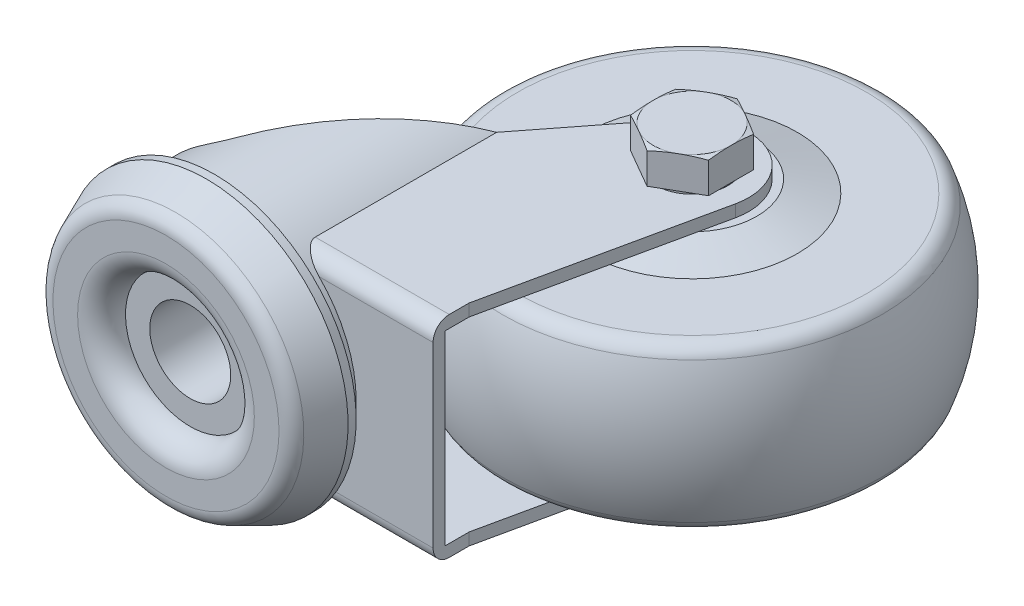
ISO-10303-21;
HEADER;
FILE_DESCRIPTION(('STEP AP214'),'2;1');
FILE_NAME('part.step','',(''),(''),'','','');
FILE_SCHEMA(('AUTOMOTIVE_DESIGN { 1 0 10303 214 1 1 1 1 }'));
ENDSEC;
DATA;
#1=APPLICATION_CONTEXT('core data for automotive mechanical design processes');
#2=APPLICATION_PROTOCOL_DEFINITION('international standard','automotive_design',2000,#1);
#3=PRODUCT_CONTEXT('',#1,'mechanical');
#4=PRODUCT('Part','Part','',(#3));
#5=PRODUCT_RELATED_PRODUCT_CATEGORY('part','',(#4));
#6=PRODUCT_DEFINITION_FORMATION('','',#4);
#7=PRODUCT_DEFINITION_CONTEXT('part definition',#1,'design');
#8=PRODUCT_DEFINITION('design','',#6,#7);
#9=PRODUCT_DEFINITION_SHAPE('','',#8);
#10=(LENGTH_UNIT() NAMED_UNIT(*) SI_UNIT(.MILLI.,.METRE.));
#11=(NAMED_UNIT(*) PLANE_ANGLE_UNIT() SI_UNIT($,.RADIAN.));
#12=(NAMED_UNIT(*) SI_UNIT($,.STERADIAN.) SOLID_ANGLE_UNIT());
#13=UNCERTAINTY_MEASURE_WITH_UNIT(LENGTH_MEASURE(1.E-05),#10,'distance_accuracy_value','');
#14=(GEOMETRIC_REPRESENTATION_CONTEXT(3) GLOBAL_UNCERTAINTY_ASSIGNED_CONTEXT((#13)) GLOBAL_UNIT_ASSIGNED_CONTEXT((#10,
#11,#12)) REPRESENTATION_CONTEXT('',''));
#15=CARTESIAN_POINT('',(0.,0.,0.));
#16=DIRECTION('',(0.,0.,1.));
#17=DIRECTION('',(1.,0.,0.));
#18=AXIS2_PLACEMENT_3D('',#15,#16,#17);
#19=CARTESIAN_POINT('',(0.,0.,-20.));
#20=DIRECTION('',(0.,0.,1.));
#21=DIRECTION('',(0.,1.,0.));
#22=AXIS2_PLACEMENT_3D('',#19,#20,#21);
#23=CYLINDRICAL_SURFACE('',#22,5.);
#24=CARTESIAN_POINT('',(0.,0.,-2.9988991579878));
#25=DIRECTION('',(0.,0.,1.));
#26=DIRECTION('',(0.,1.,0.));
#27=AXIS2_PLACEMENT_3D('',#24,#25,#26);
#28=CIRCLE('',#27,5.);
#29=CARTESIAN_POINT('',(0.,5.,-2.9988991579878));
#30=VERTEX_POINT('',#29);
#31=EDGE_CURVE('E423',#30,#30,#28,.T.);
#32=ORIENTED_EDGE('',*,*,#31,.T.);
#33=EDGE_LOOP('',(#32));
#34=FACE_BOUND('',#33,.T.);
#35=CARTESIAN_POINT('',(0.,0.,-10.5));
#36=DIRECTION('',(0.,0.,-1.));
#37=DIRECTION('',(-1.,0.,0.));
#38=AXIS2_PLACEMENT_3D('',#35,#36,#37);
#39=CIRCLE('',#38,5.);
#40=CARTESIAN_POINT('',(-5.,0.,-10.5));
#41=VERTEX_POINT('',#40);
#42=EDGE_CURVE('E371',#41,#41,#39,.T.);
#43=ORIENTED_EDGE('',*,*,#42,.T.);
#44=EDGE_LOOP('',(#43));
#45=FACE_BOUND('',#44,.T.);
#46=ADVANCED_FACE('F14',(#34,#45),#23,.F.);
#47=CARTESIAN_POINT('',(0.,0.,-9.5));
#48=DIRECTION('',(0.,0.,-1.));
#49=DIRECTION('',(0.,-1.,0.));
#50=AXIS2_PLACEMENT_3D('',#47,#48,#49);
#51=CYLINDRICAL_SURFACE('',#50,14.);
#52=CARTESIAN_POINT('',(0.,0.,-10.5));
#53=DIRECTION('',(0.,0.,-1.));
#54=DIRECTION('',(-1.,0.,0.));
#55=AXIS2_PLACEMENT_3D('',#52,#53,#54);
#56=CIRCLE('',#55,14.);
#57=CARTESIAN_POINT('',(7.98435971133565,11.5,-10.5));
#58=VERTEX_POINT('',#57);
#59=CARTESIAN_POINT('',(7.98435971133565,-11.5,-10.5));
#60=VERTEX_POINT('',#59);
#61=EDGE_CURVE('E528',#58,#60,#56,.T.);
#62=ORIENTED_EDGE('',*,*,#61,.F.);
#63=DIRECTION('',(0.,0.,-1.));
#64=VECTOR('',#63,1.);
#65=CARTESIAN_POINT('',(7.98435971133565,11.5,-9.5));
#66=LINE('',#65,#64);
#67=CARTESIAN_POINT('',(7.98435971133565,11.5,-9.5));
#68=VERTEX_POINT('',#67);
#69=EDGE_CURVE('E374',#68,#58,#66,.T.);
#70=ORIENTED_EDGE('',*,*,#69,.F.);
#71=CARTESIAN_POINT('',(0.,0.,-9.5));
#72=DIRECTION('',(0.,0.,1.));
#73=DIRECTION('',(0.,-1.,0.));
#74=AXIS2_PLACEMENT_3D('',#71,#72,#73);
#75=CIRCLE('',#74,14.);
#76=CARTESIAN_POINT('',(7.98435971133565,-11.5,-9.5));
#77=VERTEX_POINT('',#76);
#78=EDGE_CURVE('E370',#77,#68,#75,.T.);
#79=ORIENTED_EDGE('',*,*,#78,.F.);
#80=DIRECTION('',(0.,0.,-1.));
#81=VECTOR('',#80,1.);
#82=CARTESIAN_POINT('',(7.98435971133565,-11.5,-9.5));
#83=LINE('',#82,#81);
#84=EDGE_CURVE('E375',#77,#60,#83,.T.);
#85=ORIENTED_EDGE('',*,*,#84,.T.);
#86=EDGE_LOOP('',(#62,#70,#79,#85));
#87=FACE_BOUND('',#86,.T.);
#88=ADVANCED_FACE('F403',(#87),#51,.T.);
#89=CARTESIAN_POINT('',(24.0000000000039,0.,-41.));
#90=DIRECTION('',(0.,-1.,0.));
#91=DIRECTION('',(-1.,0.,0.));
#92=AXIS2_PLACEMENT_3D('',#89,#90,#91);
#93=SPHERICAL_SURFACE('',#92,25.0000000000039);
#94=CARTESIAN_POINT('',(24.,-8.695652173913,-41.));
#95=DIRECTION('',(0.,-1.,0.));
#96=DIRECTION('',(1.,0.,0.));
#97=AXIS2_PLACEMENT_3D('',#94,#95,#96);
#98=CIRCLE('',#97,23.438976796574);
#99=CARTESIAN_POINT('',(0.561023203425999,-8.695652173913,-41.));
#100=VERTEX_POINT('',#99);
#101=EDGE_CURVE('E350',#100,#100,#98,.T.);
#102=CARTESIAN_POINT('',(24.,8.695652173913,-41.));
#103=DIRECTION('',(0.,-1.,0.));
#104=DIRECTION('',(1.,0.,0.));
#105=AXIS2_PLACEMENT_3D('',#102,#103,#104);
#106=CIRCLE('',#105,23.438976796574);
#107=CARTESIAN_POINT('',(0.561023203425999,8.695652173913,-41.));
#108=VERTEX_POINT('',#107);
#109=EDGE_CURVE('E347',#108,#108,#106,.T.);
#110=CARTESIAN_POINT('',(0.561023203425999,-8.695652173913,-41.));
#111=CARTESIAN_POINT('',(0.496665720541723,-8.52217876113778,-41.));
#112=CARTESIAN_POINT('',(0.434234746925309,-8.34799064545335,-41.));
#113=CARTESIAN_POINT('',(0.313255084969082,-7.99827139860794,-41.));
#114=CARTESIAN_POINT('',(0.254706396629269,-7.82274026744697,-41.));
#115=CARTESIAN_POINT('',(0.141520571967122,-7.47042137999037,-41.));
#116=CARTESIAN_POINT('',(0.0868834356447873,-7.29363362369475,-41.));
#117=CARTESIAN_POINT('',(-0.0184524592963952,-6.93888867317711,-41.));
#118=CARTESIAN_POINT('',(-0.0691512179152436,-6.76093147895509,-41.));
#119=CARTESIAN_POINT('',(-0.166585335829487,-6.4039353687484,-41.));
#120=CARTESIAN_POINT('',(-0.213320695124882,-6.22489645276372,-41.));
#121=CARTESIAN_POINT('',(-0.302804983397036,-5.86582516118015,-41.));
#122=CARTESIAN_POINT('',(-0.345553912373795,-5.68579278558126,-41.));
#123=CARTESIAN_POINT('',(-0.427044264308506,-5.32482332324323,-41.));
#124=CARTESIAN_POINT('',(-0.465785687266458,-5.14388623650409,-41.));
#125=CARTESIAN_POINT('',(-0.539241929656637,-4.78119654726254,-41.));
#126=CARTESIAN_POINT('',(-0.573956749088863,-4.59944394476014,-41.));
#127=CARTESIAN_POINT('',(-0.639342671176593,-4.23521282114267,-41.));
#128=CARTESIAN_POINT('',(-0.670013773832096,-4.0527343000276,-41.));
#129=CARTESIAN_POINT('',(-0.727297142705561,-3.68714129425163,-41.));
#130=CARTESIAN_POINT('',(-0.753909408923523,-3.50402680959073,-41.));
#131=CARTESIAN_POINT('',(-0.803061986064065,-3.13725214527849,-41.));
#132=CARTESIAN_POINT('',(-0.825602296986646,-2.95359196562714,-41.));
#133=CARTESIAN_POINT('',(-0.866599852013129,-2.58581644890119,-41.));
#134=CARTESIAN_POINT('',(-0.885057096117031,-2.4017011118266,-41.));
#135=CARTESIAN_POINT('',(-0.917879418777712,-2.03310604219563,-41.));
#136=CARTESIAN_POINT('',(-0.932244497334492,-1.84862630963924,-41.));
#137=CARTESIAN_POINT('',(-0.956875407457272,-1.47939339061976,-41.));
#138=CARTESIAN_POINT('',(-0.967141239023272,-1.29464020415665,-41.));
#139=CARTESIAN_POINT('',(-0.983568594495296,-0.924951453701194,-41.));
#140=CARTESIAN_POINT('',(-0.989730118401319,-0.740015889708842,-41.));
#141=CARTESIAN_POINT('',(-0.997945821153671,-0.37005355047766,-41.));
#142=CARTESIAN_POINT('',(-1.,-0.18502677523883,-41.));
#143=CARTESIAN_POINT('',(-1.,0.18502677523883,-41.));
#144=CARTESIAN_POINT('',(-0.997945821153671,0.37005355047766,-41.));
#145=CARTESIAN_POINT('',(-0.989730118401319,0.740015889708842,-41.));
#146=CARTESIAN_POINT('',(-0.983568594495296,0.924951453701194,-41.));
#147=CARTESIAN_POINT('',(-0.967141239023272,1.29464020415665,-41.));
#148=CARTESIAN_POINT('',(-0.956875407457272,1.47939339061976,-41.));
#149=CARTESIAN_POINT('',(-0.932244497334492,1.84862630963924,-41.));
#150=CARTESIAN_POINT('',(-0.917879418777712,2.03310604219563,-41.));
#151=CARTESIAN_POINT('',(-0.885057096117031,2.4017011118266,-41.));
#152=CARTESIAN_POINT('',(-0.866599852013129,2.58581644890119,-41.));
#153=CARTESIAN_POINT('',(-0.825602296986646,2.95359196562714,-41.));
#154=CARTESIAN_POINT('',(-0.803061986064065,3.13725214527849,-41.));
#155=CARTESIAN_POINT('',(-0.753909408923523,3.50402680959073,-41.));
#156=CARTESIAN_POINT('',(-0.727297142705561,3.68714129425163,-41.));
#157=CARTESIAN_POINT('',(-0.670013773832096,4.0527343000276,-41.));
#158=CARTESIAN_POINT('',(-0.639342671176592,4.23521282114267,-41.));
#159=CARTESIAN_POINT('',(-0.573956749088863,4.59944394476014,-41.));
#160=CARTESIAN_POINT('',(-0.539241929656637,4.78119654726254,-41.));
#161=CARTESIAN_POINT('',(-0.465785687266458,5.14388623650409,-41.));
#162=CARTESIAN_POINT('',(-0.427044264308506,5.32482332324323,-41.));
#163=CARTESIAN_POINT('',(-0.345553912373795,5.68579278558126,-41.));
#164=CARTESIAN_POINT('',(-0.302804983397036,5.86582516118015,-41.));
#165=CARTESIAN_POINT('',(-0.213320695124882,6.22489645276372,-41.));
#166=CARTESIAN_POINT('',(-0.166585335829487,6.4039353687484,-41.));
#167=CARTESIAN_POINT('',(-0.0691512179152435,6.76093147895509,-41.));
#168=CARTESIAN_POINT('',(-0.0184524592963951,6.93888867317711,-41.));
#169=CARTESIAN_POINT('',(0.0868834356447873,7.29363362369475,-41.));
#170=CARTESIAN_POINT('',(0.141520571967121,7.47042137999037,-41.));
#171=CARTESIAN_POINT('',(0.254706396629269,7.82274026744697,-41.));
#172=CARTESIAN_POINT('',(0.313255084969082,7.99827139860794,-41.));
#173=CARTESIAN_POINT('',(0.434234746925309,8.34799064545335,-41.));
#174=CARTESIAN_POINT('',(0.496665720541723,8.52217876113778,-41.));
#175=CARTESIAN_POINT('',(0.561023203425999,8.695652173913,-41.));
#176=B_SPLINE_CURVE_WITH_KNOTS('',3,(#110,#111,#112,#113,#114,#115,#116,#117,#118,#119,#120,
#121,#122,#123,#124,#125,#126,#127,#128,#129,#130,#131,#132,#133,#134,#135,#136,#137,#138,#139,
#140,#141,#142,#143,#144,#145,#146,#147,#148,#149,#150,#151,#152,#153,#154,#155,#156,#157,#158,
#159,#160,#161,#162,#163,#164,#165,#166,#167,#168,#169,#170,#171,#172,#173,#174,#175),
.UNSPECIFIED.,.F.,.F.,(4,2,2,2,2,2,2,2,2,2,2,2,2,2,2,2,2,2,2,2,2,2,2,2,2,2,2,2,2,2,2,2,4),(0.,
0.555068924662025,1.11013784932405,1.66520677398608,2.2202756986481,2.77534462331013,
3.33041354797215,3.88548247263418,4.4405513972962,4.99562032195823,5.55068924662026,
6.10575817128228,6.66082709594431,7.21589602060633,7.77096494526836,8.32603386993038,
8.88110279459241,9.43617171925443,9.99124064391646,10.5463095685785,11.1013784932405,
11.6564474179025,12.2115163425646,12.7665852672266,13.3216541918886,13.8767231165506,
14.4317920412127,14.9868609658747,15.5419298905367,16.0969988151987,16.6520677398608,
17.2071366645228,17.7622055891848),.UNSPECIFIED.);
#177=EDGE_CURVE('BSEAM521',#100,#108,#176,.T.);
#178=ORIENTED_EDGE('',*,*,#101,.F.);
#179=ORIENTED_EDGE('',*,*,#109,.T.);
#180=ORIENTED_EDGE('',*,*,#177,.T.);
#181=ORIENTED_EDGE('',*,*,#177,.F.);
#182=EDGE_LOOP('',(#178,#180,#179,#181));
#183=FACE_BOUND('',#182,.T.);
#184=ADVANCED_FACE('F521',(#183),#93,.T.);
#185=CARTESIAN_POINT('',(24.,7.99999999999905,-41.));
#186=DIRECTION('',(0.,-1.,0.));
#187=DIRECTION('',(1.,0.,0.));
#188=AXIS2_PLACEMENT_3D('',#185,#186,#187);
#189=TOROIDAL_SURFACE('',#188,21.5638586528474,2.00000000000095);
#190=ORIENTED_EDGE('',*,*,#109,.F.);
#191=EDGE_LOOP('',(#190));
#192=FACE_BOUND('',#191,.T.);
#193=CARTESIAN_POINT('',(24.,10.,-41.));
#194=DIRECTION('',(0.,-1.,0.));
#195=DIRECTION('',(1.,0.,0.));
#196=AXIS2_PLACEMENT_3D('',#193,#194,#195);
#197=CIRCLE('',#196,21.563858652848);
#198=CARTESIAN_POINT('',(45.563858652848,10.,-41.));
#199=VERTEX_POINT('',#198);
#200=EDGE_CURVE('E344',#199,#199,#197,.T.);
#201=ORIENTED_EDGE('',*,*,#200,.T.);
#202=EDGE_LOOP('',(#201));
#203=FACE_BOUND('',#202,.T.);
#204=ADVANCED_FACE('F1514',(#192,#203),#189,.T.);
#205=CARTESIAN_POINT('',(2.436141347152,10.,-41.));
#206=DIRECTION('',(0.,-1.,0.));
#207=DIRECTION('',(1.,0.,0.));
#208=AXIS2_PLACEMENT_3D('',#205,#206,#207);
#209=PLANE('',#208);
#210=ORIENTED_EDGE('',*,*,#200,.F.);
#211=EDGE_LOOP('',(#210));
#212=FACE_BOUND('',#211,.T.);
#213=CARTESIAN_POINT('',(24.,10.,-41.));
#214=DIRECTION('',(0.,-1.,0.));
#215=DIRECTION('',(1.,0.,0.));
#216=AXIS2_PLACEMENT_3D('',#213,#214,#215);
#217=CIRCLE('',#216,13.);
#218=CARTESIAN_POINT('',(37.,10.,-41.));
#219=VERTEX_POINT('',#218);
#220=EDGE_CURVE('E319',#219,#219,#217,.T.);
#221=ORIENTED_EDGE('',*,*,#220,.T.);
#222=EDGE_LOOP('',(#221));
#223=FACE_BOUND('',#222,.T.);
#224=ADVANCED_FACE('F1505',(#212,#223),#209,.F.);
#225=CARTESIAN_POINT('',(24.,11.5,-41.));
#226=DIRECTION('',(0.,-1.,0.));
#227=DIRECTION('',(1.,0.,0.));
#228=AXIS2_PLACEMENT_3D('',#225,#226,#227);
#229=CONICAL_SURFACE('',#228,8.,1.27933953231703);
#230=ORIENTED_EDGE('',*,*,#220,.F.);
#231=EDGE_LOOP('',(#230));
#232=FACE_BOUND('',#231,.T.);
#233=CARTESIAN_POINT('',(24.,11.5,-41.));
#234=DIRECTION('',(0.,-1.,0.));
#235=DIRECTION('',(1.,0.,0.));
#236=AXIS2_PLACEMENT_3D('',#233,#234,#235);
#237=CIRCLE('',#236,8.);
#238=CARTESIAN_POINT('',(30.0250938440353,11.5,-35.7370878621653));
#239=VERTEX_POINT('',#238);
#240=CARTESIAN_POINT('',(16.0977416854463,11.5,-42.2467211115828));
#241=VERTEX_POINT('',#240);
#242=EDGE_CURVE('E310',#239,#241,#237,.T.);
#243=ORIENTED_EDGE('',*,*,#242,.T.);
#244=EDGE_CURVE('E314',#241,#239,#237,.T.);
#245=ORIENTED_EDGE('',*,*,#244,.T.);
#246=EDGE_LOOP('',(#243,#245));
#247=FACE_BOUND('',#246,.T.);
#248=ADVANCED_FACE('F312',(#232,#247),#229,.T.);
#249=CARTESIAN_POINT('',(16.,11.5,-41.));
#250=DIRECTION('',(0.,-1.,0.));
#251=DIRECTION('',(1.,0.,0.));
#252=AXIS2_PLACEMENT_3D('',#249,#250,#251);
#253=PLANE('',#252);
#254=ORIENTED_EDGE('',*,*,#244,.F.);
#255=DIRECTION('',(0.614568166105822,0.,-0.78886372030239));
#256=VECTOR('',#255,1.);
#257=CARTESIAN_POINT('',(15.4564017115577,11.5,-41.4234929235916));
#258=LINE('',#257,#256);
#259=CARTESIAN_POINT('',(18.4779539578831,11.5,-45.3019771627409));
#260=VERTEX_POINT('',#259);
#261=EDGE_CURVE('E9',#241,#260,#258,.T.);
#262=ORIENTED_EDGE('',*,*,#261,.T.);
#263=CARTESIAN_POINT('',(24.,11.5,-41.));
#264=DIRECTION('',(0.,-1.,0.));
#265=DIRECTION('',(1.,0.,0.));
#266=AXIS2_PLACEMENT_3D('',#263,#264,#265);
#267=CIRCLE('',#266,7.00000000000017);
#268=CARTESIAN_POINT('',(30.8423718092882,11.5,-39.5228581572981));
#269=VERTEX_POINT('',#268);
#270=EDGE_CURVE('E38',#260,#269,#267,.T.);
#271=ORIENTED_EDGE('',*,*,#270,.T.);
#272=DIRECTION('',(-0.211020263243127,0.,0.977481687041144));
#273=VECTOR('',#272,1.);
#274=CARTESIAN_POINT('',(30.4861353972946,11.5,-37.87271061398));
#275=LINE('',#274,#273);
#276=EDGE_CURVE('E30',#269,#239,#275,.T.);
#277=ORIENTED_EDGE('',*,*,#276,.T.);
#278=EDGE_LOOP('',(#254,#262,#271,#277));
#279=FACE_BOUND('',#278,.T.);
#280=ADVANCED_FACE('F337',(#279),#253,.F.);
#281=CARTESIAN_POINT('',(24.,-7.99999999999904,-41.));
#282=DIRECTION('',(0.,-1.,0.));
#283=DIRECTION('',(1.,0.,0.));
#284=AXIS2_PLACEMENT_3D('',#281,#282,#283);
#285=TOROIDAL_SURFACE('',#284,21.5638586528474,2.00000000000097);
#286=CARTESIAN_POINT('',(24.,-10.,-41.));
#287=DIRECTION('',(0.,-1.,0.));
#288=DIRECTION('',(1.,0.,0.));
#289=AXIS2_PLACEMENT_3D('',#286,#287,#288);
#290=CIRCLE('',#289,21.563858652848);
#291=CARTESIAN_POINT('',(45.563858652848,-10.,-41.));
#292=VERTEX_POINT('',#291);
#293=EDGE_CURVE('E353',#292,#292,#290,.T.);
#294=ORIENTED_EDGE('',*,*,#293,.F.);
#295=EDGE_LOOP('',(#294));
#296=FACE_BOUND('',#295,.T.);
#297=ORIENTED_EDGE('',*,*,#101,.T.);
#298=EDGE_LOOP('',(#297));
#299=FACE_BOUND('',#298,.T.);
#300=ADVANCED_FACE('F1496',(#296,#299),#285,.T.);
#301=CARTESIAN_POINT('',(2.436141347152,-10.,-41.));
#302=DIRECTION('',(0.,1.,0.));
#303=DIRECTION('',(-1.,0.,0.));
#304=AXIS2_PLACEMENT_3D('',#301,#302,#303);
#305=PLANE('',#304);
#306=CARTESIAN_POINT('',(24.,-10.,-41.));
#307=DIRECTION('',(0.,-1.,0.));
#308=DIRECTION('',(1.,0.,0.));
#309=AXIS2_PLACEMENT_3D('',#306,#307,#308);
#310=CIRCLE('',#309,13.);
#311=CARTESIAN_POINT('',(37.,-10.,-41.));
#312=VERTEX_POINT('',#311);
#313=EDGE_CURVE('E356',#312,#312,#310,.T.);
#314=ORIENTED_EDGE('',*,*,#313,.F.);
#315=EDGE_LOOP('',(#314));
#316=FACE_BOUND('',#315,.T.);
#317=ORIENTED_EDGE('',*,*,#293,.T.);
#318=EDGE_LOOP('',(#317));
#319=FACE_BOUND('',#318,.T.);
#320=ADVANCED_FACE('F1539',(#316,#319),#305,.F.);
#321=CARTESIAN_POINT('',(24.,-10.,-41.));
#322=DIRECTION('',(0.,1.,0.));
#323=DIRECTION('',(-1.,0.,0.));
#324=AXIS2_PLACEMENT_3D('',#321,#322,#323);
#325=CONICAL_SURFACE('',#324,13.,1.27933953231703);
#326=CARTESIAN_POINT('',(24.,-11.5,-41.));
#327=DIRECTION('',(0.,-1.,0.));
#328=DIRECTION('',(1.,0.,0.));
#329=AXIS2_PLACEMENT_3D('',#326,#327,#328);
#330=CIRCLE('',#329,8.);
#331=CARTESIAN_POINT('',(30.0250938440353,-11.5,-35.7370878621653));
#332=VERTEX_POINT('',#331);
#333=CARTESIAN_POINT('',(16.0977416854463,-11.5,-42.2467211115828));
#334=VERTEX_POINT('',#333);
#335=EDGE_CURVE('E293',#332,#334,#330,.T.);
#336=ORIENTED_EDGE('',*,*,#335,.F.);
#337=EDGE_CURVE('E338',#334,#332,#330,.T.);
#338=ORIENTED_EDGE('',*,*,#337,.F.);
#339=EDGE_LOOP('',(#336,#338));
#340=FACE_BOUND('',#339,.T.);
#341=ORIENTED_EDGE('',*,*,#313,.T.);
#342=EDGE_LOOP('',(#341));
#343=FACE_BOUND('',#342,.T.);
#344=ADVANCED_FACE('F700',(#340,#343),#325,.T.);
#345=CARTESIAN_POINT('',(16.,-11.5,-41.));
#346=DIRECTION('',(0.,1.,0.));
#347=DIRECTION('',(-1.,0.,0.));
#348=AXIS2_PLACEMENT_3D('',#345,#346,#347);
#349=PLANE('',#348);
#350=CARTESIAN_POINT('',(24.,-11.5,-41.));
#351=DIRECTION('',(0.,1.,0.));
#352=DIRECTION('',(-1.,0.,0.));
#353=AXIS2_PLACEMENT_3D('',#350,#351,#352);
#354=CIRCLE('',#353,7.00000000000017);
#355=CARTESIAN_POINT('',(30.8423718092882,-11.5,-39.5228581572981));
#356=VERTEX_POINT('',#355);
#357=CARTESIAN_POINT('',(18.4779539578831,-11.5,-45.3019771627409));
#358=VERTEX_POINT('',#357);
#359=EDGE_CURVE('E359',#356,#358,#354,.T.);
#360=ORIENTED_EDGE('',*,*,#359,.T.);
#361=DIRECTION('',(-0.614568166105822,0.,0.78886372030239));
#362=VECTOR('',#361,1.);
#363=CARTESIAN_POINT('',(15.4564017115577,-11.5,-41.4234929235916));
#364=LINE('',#363,#362);
#365=EDGE_CURVE('E363',#358,#334,#364,.T.);
#366=ORIENTED_EDGE('',*,*,#365,.T.);
#367=ORIENTED_EDGE('',*,*,#337,.T.);
#368=DIRECTION('',(0.211020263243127,0.,-0.977481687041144));
#369=VECTOR('',#368,1.);
#370=CARTESIAN_POINT('',(30.4861353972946,-11.5,-37.87271061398));
#371=LINE('',#370,#369);
#372=EDGE_CURVE('E361',#332,#356,#371,.T.);
#373=ORIENTED_EDGE('',*,*,#372,.T.);
#374=EDGE_LOOP('',(#360,#366,#367,#373));
#375=FACE_BOUND('',#374,.T.);
#376=ADVANCED_FACE('F512',(#375),#349,.F.);
#377=CARTESIAN_POINT('',(24.,-19.,-38.6135));
#378=DIRECTION('',(0.,1.,0.));
#379=DIRECTION('',(-1.,0.,0.));
#380=AXIS2_PLACEMENT_3D('',#377,#378,#379);
#381=PLANE('',#380);
#382=CARTESIAN_POINT('',(24.,-19.,-41.));
#383=DIRECTION('',(0.,1.,0.));
#384=DIRECTION('',(-1.,0.,0.));
#385=AXIS2_PLACEMENT_3D('',#382,#383,#384);
#386=CIRCLE('',#385,2.3865);
#387=CARTESIAN_POINT('',(21.6135,-19.,-41.));
#388=VERTEX_POINT('',#387);
#389=EDGE_CURVE('E978',#388,#388,#386,.T.);
#390=ORIENTED_EDGE('',*,*,#389,.F.);
#391=EDGE_LOOP('',(#390));
#392=FACE_BOUND('',#391,.T.);
#393=ADVANCED_FACE('F682',(#392),#381,.F.);
#394=CARTESIAN_POINT('',(0.,0.,-2.9988991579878));
#395=DIRECTION('',(0.,0.,1.));
#396=DIRECTION('',(0.,1.,0.));
#397=AXIS2_PLACEMENT_3D('',#394,#395,#396);
#398=TOROIDAL_SURFACE('',#397,11.,3.);
#399=CARTESIAN_POINT('',(0.,0.,0.));
#400=DIRECTION('',(0.,0.,1.));
#401=DIRECTION('',(0.,1.,0.));
#402=AXIS2_PLACEMENT_3D('',#399,#400,#401);
#403=CIRCLE('',#402,10.9187359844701);
#404=CARTESIAN_POINT('',(0.,10.9187359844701,0.));
#405=VERTEX_POINT('',#404);
#406=EDGE_CURVE('E415',#405,#405,#403,.T.);
#407=ORIENTED_EDGE('',*,*,#406,.T.);
#408=EDGE_LOOP('',(#407));
#409=FACE_BOUND('',#408,.T.);
#410=CARTESIAN_POINT('',(0.,0.,-2.9988991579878));
#411=DIRECTION('',(0.,0.,1.));
#412=DIRECTION('',(0.,1.,0.));
#413=AXIS2_PLACEMENT_3D('',#410,#411,#412);
#414=CIRCLE('',#413,8.);
#415=CARTESIAN_POINT('',(0.,8.,-2.9988991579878));
#416=VERTEX_POINT('',#415);
#417=EDGE_CURVE('E420',#416,#416,#414,.T.);
#418=ORIENTED_EDGE('',*,*,#417,.F.);
#419=EDGE_LOOP('',(#418));
#420=FACE_BOUND('',#419,.T.);
#421=ADVANCED_FACE('F401',(#409,#420),#398,.T.);
#422=CARTESIAN_POINT('',(24.,-19.,-41.));
#423=DIRECTION('',(0.,1.,0.));
#424=DIRECTION('',(-1.,0.,0.));
#425=AXIS2_PLACEMENT_3D('',#422,#423,#424);
#426=CONICAL_SURFACE('',#425,2.3865,0.785398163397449);
#427=CARTESIAN_POINT('',(24.,-18.3865,-41.));
#428=DIRECTION('',(0.,1.,0.));
#429=DIRECTION('',(-1.,0.,0.));
#430=AXIS2_PLACEMENT_3D('',#427,#428,#429);
#431=CIRCLE('',#430,3.);
#432=CARTESIAN_POINT('',(21.,-18.3865,-41.));
#433=VERTEX_POINT('',#432);
#434=EDGE_CURVE('E976',#433,#433,#431,.T.);
#435=ORIENTED_EDGE('',*,*,#434,.F.);
#436=EDGE_LOOP('',(#435));
#437=FACE_BOUND('',#436,.T.);
#438=ORIENTED_EDGE('',*,*,#389,.T.);
#439=EDGE_LOOP('',(#438));
#440=FACE_BOUND('',#439,.T.);
#441=ADVANCED_FACE('F694',(#437,#440),#426,.T.);
#442=CARTESIAN_POINT('',(24.,17.5,-41.));
#443=DIRECTION('',(0.,-1.,0.));
#444=DIRECTION('',(1.,0.,0.));
#445=AXIS2_PLACEMENT_3D('',#442,#443,#444);
#446=PLANE('',#445);
#447=CARTESIAN_POINT('',(24.,17.5,-41.));
#448=DIRECTION('',(0.,1.,0.));
#449=DIRECTION('',(-1.,0.,0.));
#450=AXIS2_PLACEMENT_3D('',#447,#448,#449);
#451=CIRCLE('',#450,4.8166666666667);
#452=CARTESIAN_POINT('',(19.183333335,17.5,-41.));
#453=VERTEX_POINT('',#452);
#454=CARTESIAN_POINT('',(21.5916666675,17.5,-36.8286443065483));
#455=VERTEX_POINT('',#454);
#456=EDGE_CURVE('E968',#453,#455,#451,.T.);
#457=ORIENTED_EDGE('',*,*,#456,.T.);
#458=CARTESIAN_POINT('',(26.4083333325,17.5,-36.8286443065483));
#459=VERTEX_POINT('',#458);
#460=EDGE_CURVE('E971',#455,#459,#451,.T.);
#461=ORIENTED_EDGE('',*,*,#460,.T.);
#462=CARTESIAN_POINT('',(28.816666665,17.5,-41.));
#463=VERTEX_POINT('',#462);
#464=EDGE_CURVE('E1094',#459,#463,#451,.T.);
#465=ORIENTED_EDGE('',*,*,#464,.T.);
#466=CARTESIAN_POINT('',(26.4083333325,17.5,-45.1713556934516));
#467=VERTEX_POINT('',#466);
#468=EDGE_CURVE('E1099',#463,#467,#451,.T.);
#469=ORIENTED_EDGE('',*,*,#468,.T.);
#470=CARTESIAN_POINT('',(21.5916666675,17.5,-45.1713556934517));
#471=VERTEX_POINT('',#470);
#472=EDGE_CURVE('E1102',#467,#471,#451,.T.);
#473=ORIENTED_EDGE('',*,*,#472,.T.);
#474=EDGE_CURVE('E972',#471,#453,#451,.T.);
#475=ORIENTED_EDGE('',*,*,#474,.T.);
#476=EDGE_LOOP('',(#457,#461,#465,#469,#473,#475));
#477=FACE_BOUND('',#476,.T.);
#478=ADVANCED_FACE('F707',(#477),#446,.F.);
#479=CARTESIAN_POINT('',(0.,0.,0.));
#480=DIRECTION('',(0.,0.,-1.));
#481=DIRECTION('',(0.,-1.,0.));
#482=AXIS2_PLACEMENT_3D('',#479,#480,#481);
#483=PLANE('',#482);
#484=CARTESIAN_POINT('',(0.,0.,0.));
#485=DIRECTION('',(0.,0.,1.));
#486=DIRECTION('',(0.,1.,0.));
#487=AXIS2_PLACEMENT_3D('',#484,#485,#486);
#488=CIRCLE('',#487,13.964543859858);
#489=CARTESIAN_POINT('',(0.,13.964543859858,0.));
#490=VERTEX_POINT('',#489);
#491=EDGE_CURVE('E882',#490,#490,#488,.T.);
#492=ORIENTED_EDGE('',*,*,#491,.T.);
#493=EDGE_LOOP('',(#492));
#494=FACE_BOUND('',#493,.T.);
#495=ORIENTED_EDGE('',*,*,#406,.F.);
#496=EDGE_LOOP('',(#495));
#497=FACE_BOUND('',#496,.T.);
#498=ADVANCED_FACE('F649',(#494,#497),#483,.F.);
#499=CARTESIAN_POINT('',(-8.,0.,-2.9988991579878));
#500=DIRECTION('',(0.,0.,1.));
#501=DIRECTION('',(0.,1.,0.));
#502=AXIS2_PLACEMENT_3D('',#499,#500,#501);
#503=PLANE('',#502);
#504=ORIENTED_EDGE('',*,*,#417,.T.);
#505=EDGE_LOOP('',(#504));
#506=FACE_BOUND('',#505,.T.);
#507=ORIENTED_EDGE('',*,*,#31,.F.);
#508=EDGE_LOOP('',(#507));
#509=FACE_BOUND('',#508,.T.);
#510=ADVANCED_FACE('F448',(#506,#509),#503,.T.);
#511=CARTESIAN_POINT('',(24.,-19.,-41.));
#512=DIRECTION('',(0.,1.,0.));
#513=DIRECTION('',(-1.,0.,0.));
#514=AXIS2_PLACEMENT_3D('',#511,#512,#513);
#515=CYLINDRICAL_SURFACE('',#514,3.);
#516=ORIENTED_EDGE('',*,*,#434,.T.);
#517=EDGE_LOOP('',(#516));
#518=FACE_BOUND('',#517,.T.);
#519=CARTESIAN_POINT('',(24.,-18.,-41.));
#520=DIRECTION('',(0.,1.,0.));
#521=DIRECTION('',(-1.,0.,0.));
#522=AXIS2_PLACEMENT_3D('',#519,#520,#521);
#523=CIRCLE('',#522,3.);
#524=CARTESIAN_POINT('',(21.,-18.,-41.));
#525=VERTEX_POINT('',#524);
#526=EDGE_CURVE('E569',#525,#525,#523,.T.);
#527=ORIENTED_EDGE('',*,*,#526,.F.);
#528=EDGE_LOOP('',(#527));
#529=FACE_BOUND('',#528,.T.);
#530=ADVANCED_FACE('F709',(#518,#529),#515,.T.);
#531=CARTESIAN_POINT('',(24.,17.241875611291,-41.));
#532=DIRECTION('',(0.,-1.,0.));
#533=DIRECTION('',(1.,0.,0.));
#534=AXIS2_PLACEMENT_3D('',#531,#532,#533);
#535=CONICAL_SURFACE('',#534,5.78,1.30899693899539);
#536=ORIENTED_EDGE('',*,*,#472,.F.);
#537=CARTESIAN_POINT('',(30.8015018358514,16.916250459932,-42.6349586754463));
#538=CARTESIAN_POINT('',(30.6257013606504,16.9556761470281,-42.7364571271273));
#539=CARTESIAN_POINT('',(30.4497195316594,16.994056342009,-42.8380602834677));
#540=CARTESIAN_POINT('',(30.0973145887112,17.0681747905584,-43.0415213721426));
#541=CARTESIAN_POINT('',(29.9208914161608,17.1039126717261,-43.1433793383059));
#542=CARTESIAN_POINT('',(29.567144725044,17.1722672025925,-43.3476150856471));
#543=CARTESIAN_POINT('',(29.3898200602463,17.204876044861,-43.449993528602));
#544=CARTESIAN_POINT('',(29.0346754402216,17.2661778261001,-43.6550363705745));
#545=CARTESIAN_POINT('',(28.8568555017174,17.29487089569,-43.7577007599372));
#546=CARTESIAN_POINT('',(28.3271265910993,17.3732130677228,-44.0635398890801));
#547=CARTESIAN_POINT('',(27.9744013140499,17.4160421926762,-44.2671859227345));
#548=CARTESIAN_POINT('',(27.4443349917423,17.4618282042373,-44.5732198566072));
#549=CARTESIAN_POINT('',(27.2675792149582,17.4740123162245,-44.6752698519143));
#550=CARTESIAN_POINT('',(26.9138113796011,17.4916795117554,-44.8795178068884));
#551=CARTESIAN_POINT('',(26.736799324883,17.4971626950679,-44.9817157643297));
#552=CARTESIAN_POINT('',(26.3825425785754,17.5011390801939,-45.1862459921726));
#553=CARTESIAN_POINT('',(26.2052978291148,17.4996254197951,-45.2885782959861));
#554=CARTESIAN_POINT('',(25.8509545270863,17.4896745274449,-45.4931584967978));
#555=CARTESIAN_POINT('',(25.6738559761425,17.4812372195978,-45.5954063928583));
#556=CARTESIAN_POINT('',(25.3197826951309,17.4578543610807,-45.7998306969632));
#557=CARTESIAN_POINT('',(25.1428083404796,17.4429013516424,-45.9020068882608));
#558=CARTESIAN_POINT('',(24.7893076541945,17.4071621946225,-46.1061006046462));
#559=CARTESIAN_POINT('',(24.612781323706,17.3863760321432,-46.2080181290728));
#560=CARTESIAN_POINT('',(24.2579811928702,17.3394631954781,-46.4128620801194));
#561=CARTESIAN_POINT('',(24.0797138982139,17.3132716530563,-46.5157847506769));
#562=CARTESIAN_POINT('',(23.7236966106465,17.2565352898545,-46.7213314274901));
#563=CARTESIAN_POINT('',(23.5459466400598,17.225990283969,-46.8239554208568));
#564=CARTESIAN_POINT('',(23.1913512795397,17.161377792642,-47.0286811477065));
#565=CARTESIAN_POINT('',(23.0145047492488,17.1273185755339,-47.1307835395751));
#566=CARTESIAN_POINT('',(22.6612876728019,17.0562433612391,-47.3347135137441));
#567=CARTESIAN_POINT('',(22.4849170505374,17.0192278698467,-47.4365411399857));
#568=CARTESIAN_POINT('',(22.308745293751,16.9810400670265,-47.53825395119));
#569=B_SPLINE_CURVE_WITH_KNOTS('',3,(#537,#538,#539,#540,#541,#542,#543,#544,#545,#546,#547,
#548,#549,#550,#551,#552,#553,#554,#555,#556,#557,#558,#559,#560,#561,#562,#563,#564,#565,#566,
#567,#568),.UNSPECIFIED.,.F.,.F.,(4,2,2,2,2,2,2,2,2,2,2,2,2,2,2,4),(0.,0.620376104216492,
1.24083947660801,1.86281279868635,2.48476536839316,3.7126906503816,4.32598884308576,
4.93927790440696,5.55316858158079,6.16706598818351,6.78166799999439,7.39627158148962,
8.01873126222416,8.64121741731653,9.26227099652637,9.88321854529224),.UNSPECIFIED.);
#570=CARTESIAN_POINT('',(24.,17.3003400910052,-46.5618075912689));
#571=VERTEX_POINT('',#570);
#572=EDGE_CURVE('E1017',#467,#571,#569,.T.);
#573=ORIENTED_EDGE('',*,*,#572,.T.);
#574=CARTESIAN_POINT('',(28.0120733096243,16.4216958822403,-48.878179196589));
#575=CARTESIAN_POINT('',(27.8143203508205,16.4729874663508,-48.7640064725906));
#576=CARTESIAN_POINT('',(27.6164402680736,16.5236383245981,-48.6497603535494));
#577=CARTESIAN_POINT('',(27.220359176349,16.6232921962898,-48.4210828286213));
#578=CARTESIAN_POINT('',(27.0221581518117,16.6722951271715,-48.306651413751));
#579=CARTESIAN_POINT('',(26.6250263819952,16.7683690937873,-48.0773672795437));
#580=CARTESIAN_POINT('',(26.4260949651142,16.815436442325,-47.9625141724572));
#581=CARTESIAN_POINT('',(26.0277958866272,16.9070404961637,-47.7325560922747));
#582=CARTESIAN_POINT('',(25.8284282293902,16.9515772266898,-47.6174511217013));
#583=CARTESIAN_POINT('',(25.4316783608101,17.0369472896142,-47.3883874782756));
#584=CARTESIAN_POINT('',(25.2343025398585,17.0778200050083,-47.2744324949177));
#585=CARTESIAN_POINT('',(24.8389817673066,17.1557062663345,-47.0461939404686));
#586=CARTESIAN_POINT('',(24.6410368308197,17.1927199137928,-46.9319103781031));
#587=CARTESIAN_POINT('',(24.2446529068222,17.2619238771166,-46.7030580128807));
#588=CARTESIAN_POINT('',(24.0462143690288,17.2941175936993,-46.5884894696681));
#589=CARTESIAN_POINT('',(23.6486804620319,17.3526235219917,-46.3589731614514));
#590=CARTESIAN_POINT('',(23.4495850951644,17.3789357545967,-46.2440253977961));
#591=CARTESIAN_POINT('',(23.048775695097,17.4247507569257,-46.0126179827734));
#592=CARTESIAN_POINT('',(22.8470554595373,17.4441824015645,-45.8961547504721));
#593=CARTESIAN_POINT('',(22.4431401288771,17.474778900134,-45.6629541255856));
#594=CARTESIAN_POINT('',(22.2409450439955,17.48594393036,-45.5462167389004));
#595=CARTESIAN_POINT('',(21.836236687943,17.4992829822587,-45.3125582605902));
#596=CARTESIAN_POINT('',(21.6337233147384,17.5014529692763,-45.195637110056));
#597=CARTESIAN_POINT('',(21.2287844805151,17.4966391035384,-44.9618455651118));
#598=CARTESIAN_POINT('',(21.0263590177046,17.4896554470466,-44.8449751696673));
#599=CARTESIAN_POINT('',(20.6196106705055,17.4668839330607,-44.6101389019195));
#600=CARTESIAN_POINT('',(20.4152919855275,17.4509981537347,-44.492175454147));
#601=CARTESIAN_POINT('',(20.0072117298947,17.4113334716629,-44.2565702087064));
#602=CARTESIAN_POINT('',(19.8034502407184,17.3875534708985,-44.13892845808));
#603=CARTESIAN_POINT('',(19.3966018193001,17.3333220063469,-43.9040344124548));
#604=CARTESIAN_POINT('',(19.193514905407,17.3028703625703,-43.7867821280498));
#605=CARTESIAN_POINT('',(18.7880950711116,17.2364910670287,-43.5527128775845));
#606=CARTESIAN_POINT('',(18.5857618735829,17.2005656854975,-43.4358957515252));
#607=CARTESIAN_POINT('',(18.3837584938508,17.1624876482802,-43.3192690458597));
#608=B_SPLINE_CURVE_WITH_KNOTS('',3,(#574,#575,#576,#577,#578,#579,#580,#581,#582,#583,#584,
#585,#586,#587,#588,#589,#590,#591,#592,#593,#594,#595,#596,#597,#598,#599,#600,#601,#602,#603,
#604,#605,#606,#607),.UNSPECIFIED.,.F.,.F.,(4,2,2,2,2,2,2,2,2,2,2,2,2,2,2,2,4),(0.,
0.702108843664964,1.40425281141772,2.10767761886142,2.81109541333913,3.50570706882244,
4.20030044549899,4.89440141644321,5.58849992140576,6.28957717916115,6.99063948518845,
7.69201621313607,8.3933779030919,9.10261031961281,9.81194142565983,10.5212916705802,
11.2303485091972),.UNSPECIFIED.);
#609=EDGE_CURVE('E1027',#571,#471,#608,.T.);
#610=ORIENTED_EDGE('',*,*,#609,.T.);
#611=EDGE_LOOP('',(#536,#573,#610));
#612=FACE_BOUND('',#611,.T.);
#613=ADVANCED_FACE('F721',(#612),#535,.T.);
#614=ORIENTED_EDGE('',*,*,#474,.F.);
#615=CARTESIAN_POINT('',(19.183333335,17.3003400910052,-43.7809037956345));
#616=VERTEX_POINT('',#615);
#617=EDGE_CURVE('E1028',#471,#616,#608,.T.);
#618=ORIENTED_EDGE('',*,*,#617,.T.);
#619=CARTESIAN_POINT('',(19.183333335,16.434517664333,-48.3565171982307));
#620=CARTESIAN_POINT('',(19.183333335,16.4834903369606,-48.1379988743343));
#621=CARTESIAN_POINT('',(19.183333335,16.5318640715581,-47.9193438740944));
#622=CARTESIAN_POINT('',(19.183333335,16.6270903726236,-47.4816933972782));
#623=CARTESIAN_POINT('',(19.183333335,16.6739428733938,-47.2626979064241));
#624=CARTESIAN_POINT('',(19.183333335,16.7658441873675,-46.8241031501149));
#625=CARTESIAN_POINT('',(19.183333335,16.810891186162,-46.6045035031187));
#626=CARTESIAN_POINT('',(19.183333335,16.8986952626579,-46.1648471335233));
#627=CARTESIAN_POINT('',(19.183333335,16.9414523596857,-45.9447904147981));
#628=CARTESIAN_POINT('',(19.183333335,17.023801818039,-45.5058954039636));
#629=CARTESIAN_POINT('',(19.183333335,17.0634166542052,-45.2870613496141));
#630=CARTESIAN_POINT('',(19.183333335,17.1391877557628,-44.8487963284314));
#631=CARTESIAN_POINT('',(19.183333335,17.1753440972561,-44.6293653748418));
#632=CARTESIAN_POINT('',(19.183333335,17.2433841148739,-44.1898639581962));
#633=CARTESIAN_POINT('',(19.183333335,17.2752683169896,-43.9697935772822));
#634=CARTESIAN_POINT('',(19.183333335,17.3338244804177,-43.528952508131));
#635=CARTESIAN_POINT('',(19.183333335,17.3604964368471,-43.3081818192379));
#636=CARTESIAN_POINT('',(19.183333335,17.4078728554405,-42.8634494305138));
#637=CARTESIAN_POINT('',(19.183333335,17.4285059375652,-42.6394800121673));
#638=CARTESIAN_POINT('',(19.183333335,17.462381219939,-42.1909781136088));
#639=CARTESIAN_POINT('',(19.183333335,17.4756235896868,-41.9664456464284));
#640=CARTESIAN_POINT('',(19.183333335,17.4939451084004,-41.5171433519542));
#641=CARTESIAN_POINT('',(19.183333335,17.4990279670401,-41.2923736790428));
#642=CARTESIAN_POINT('',(19.183333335,17.5007179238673,-40.8428020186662));
#643=CARTESIAN_POINT('',(19.183333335,17.4973250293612,-40.618000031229));
#644=CARTESIAN_POINT('',(19.183333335,17.4822544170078,-40.1678615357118));
#645=CARTESIAN_POINT('',(19.183333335,17.4705466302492,-39.9425260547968));
#646=CARTESIAN_POINT('',(19.183333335,17.4395140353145,-39.492385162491));
#647=CARTESIAN_POINT('',(19.183333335,17.4201890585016,-39.2675797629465));
#648=CARTESIAN_POINT('',(19.183333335,17.3749001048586,-38.818500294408));
#649=CARTESIAN_POINT('',(19.183333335,17.3489317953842,-38.5942266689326));
#650=CARTESIAN_POINT('',(19.183333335,17.2914297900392,-38.1464030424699));
#651=CARTESIAN_POINT('',(19.183333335,17.2598960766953,-37.9228530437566));
#652=CARTESIAN_POINT('',(19.183333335,17.1629761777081,-37.2828076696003));
#653=CARTESIAN_POINT('',(19.183333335,17.0919542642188,-36.8671698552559));
#654=CARTESIAN_POINT('',(19.183333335,16.9393911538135,-36.0378298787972));
#655=CARTESIAN_POINT('',(19.183333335,16.8578486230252,-35.6241279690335));
#656=CARTESIAN_POINT('',(19.183333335,16.687700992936,-34.7980854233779));
#657=CARTESIAN_POINT('',(19.183333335,16.599094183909,-34.3857451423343));
#658=CARTESIAN_POINT('',(19.183333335,16.4170749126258,-33.5621603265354));
#659=CARTESIAN_POINT('',(19.183333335,16.3236627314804,-33.1509157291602));
#660=CARTESIAN_POINT('',(19.183333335,16.1343958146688,-32.3332483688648));
#661=CARTESIAN_POINT('',(19.183333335,16.0385741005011,-31.9268179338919));
#662=CARTESIAN_POINT('',(19.183333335,15.8445311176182,-31.1145240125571));
#663=CARTESIAN_POINT('',(19.183333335,15.7463098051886,-30.7086605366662));
#664=CARTESIAN_POINT('',(19.183333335,15.5482171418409,-29.8978680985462));
#665=CARTESIAN_POINT('',(19.183333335,15.4483479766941,-29.4929386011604));
#666=CARTESIAN_POINT('',(19.183333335,15.2472459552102,-28.6834323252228));
#667=CARTESIAN_POINT('',(19.183333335,15.1460131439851,-28.278855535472));
#668=CARTESIAN_POINT('',(19.183333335,15.0442973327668,-27.8744016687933));
#669=B_SPLINE_CURVE_WITH_KNOTS('',3,(#619,#620,#621,#622,#623,#624,#625,#626,#627,#628,#629,
#630,#631,#632,#633,#634,#635,#636,#637,#638,#639,#640,#641,#642,#643,#644,#645,#646,#647,#648,
#649,#650,#651,#652,#653,#654,#655,#656,#657,#658,#659,#660,#661,#662,#663,#664,#665,#666,#667,
#668),.UNSPECIFIED.,.F.,.F.,(4,2,2,2,2,2,2,2,2,2,2,2,2,2,2,2,2,2,2,2,2,2,2,2,4),(0.,
0.671819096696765,1.34366716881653,2.01617428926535,2.68867573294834,3.35582604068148,
4.02296166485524,4.69001507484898,5.35706910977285,6.03171582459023,6.70634706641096,
7.38067150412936,8.05499536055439,8.73177025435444,9.40856013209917,10.085792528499,
10.7630270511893,12.0277754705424,13.2926844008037,14.5579004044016,15.8230424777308,
17.075752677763,18.3284857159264,19.579672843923,20.830818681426),.UNSPECIFIED.);
#670=EDGE_CURVE('E1053',#616,#453,#669,.T.);
#671=ORIENTED_EDGE('',*,*,#670,.T.);
#672=EDGE_LOOP('',(#614,#618,#671));
#673=FACE_BOUND('',#672,.T.);
#674=ADVANCED_FACE('F728',(#673),#535,.T.);
#675=ORIENTED_EDGE('',*,*,#456,.F.);
#676=CARTESIAN_POINT('',(19.183333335,17.3003400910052,-38.2190962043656));
#677=VERTEX_POINT('',#676);
#678=EDGE_CURVE('E1046',#453,#677,#669,.T.);
#679=ORIENTED_EDGE('',*,*,#678,.T.);
#680=CARTESIAN_POINT('',(17.4924673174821,16.9811243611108,-39.1953181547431));
#681=CARTESIAN_POINT('',(17.6686402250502,17.019310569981,-39.0936046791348));
#682=CARTESIAN_POINT('',(17.8450120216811,17.0563242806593,-38.9917763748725));
#683=CARTESIAN_POINT('',(18.1982314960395,17.1273954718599,-38.7878450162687));
#684=CARTESIAN_POINT('',(18.3750792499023,17.1614524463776,-38.6857419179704));
#685=CARTESIAN_POINT('',(18.7296770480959,17.2260598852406,-38.4810147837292));
#686=CARTESIAN_POINT('',(18.9074282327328,17.2566020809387,-38.3783900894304));
#687=CARTESIAN_POINT('',(19.2634479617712,17.3133321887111,-38.1728420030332));
#688=CARTESIAN_POINT('',(19.4417164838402,17.3395202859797,-38.0699186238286));
#689=CARTESIAN_POINT('',(19.7965190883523,17.3864256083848,-37.8650732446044));
#690=CARTESIAN_POINT('',(19.9730466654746,17.4072077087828,-37.7631550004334));
#691=CARTESIAN_POINT('',(20.3265497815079,17.4429381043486,-37.5590598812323));
#692=CARTESIAN_POINT('',(20.5035253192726,17.4578864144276,-37.4568830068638));
#693=CARTESIAN_POINT('',(20.8576008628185,17.4812593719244,-37.2524573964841));
#694=CARTESIAN_POINT('',(21.0347004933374,17.4896914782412,-37.1502088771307));
#695=CARTESIAN_POINT('',(21.3890458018,17.4996316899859,-36.9456275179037));
#696=CARTESIAN_POINT('',(21.5662914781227,17.5011398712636,-36.8432946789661));
#697=CARTESIAN_POINT('',(21.9205494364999,17.4971525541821,-36.6387637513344));
#698=CARTESIAN_POINT('',(22.0975617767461,17.4916639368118,-36.5365656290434));
#699=CARTESIAN_POINT('',(22.4513300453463,17.4739861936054,-36.3323174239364));
#700=CARTESIAN_POINT('',(22.6280859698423,17.4617969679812,-36.2302673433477));
#701=CARTESIAN_POINT('',(23.1581525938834,17.4159964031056,-35.9242332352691));
#702=CARTESIAN_POINT('',(23.5108778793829,17.3731586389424,-35.7205871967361));
#703=CARTESIAN_POINT('',(24.0406068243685,17.2948053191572,-35.414748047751));
#704=CARTESIAN_POINT('',(24.2184267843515,17.2661088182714,-35.3120836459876));
#705=CARTESIAN_POINT('',(24.5735714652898,17.2048007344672,-35.1070407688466));
#706=CARTESIAN_POINT('',(24.7508961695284,17.1721890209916,-35.0046623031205));
#707=CARTESIAN_POINT('',(25.104642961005,17.1038292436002,-34.8004264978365));
#708=CARTESIAN_POINT('',(25.2810661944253,17.0680889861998,-34.69856849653));
#709=CARTESIAN_POINT('',(25.6334713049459,16.9939661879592,-34.4951073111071));
#710=CARTESIAN_POINT('',(25.8094532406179,16.9555840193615,-34.3935040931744));
#711=CARTESIAN_POINT('',(25.9852538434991,16.9161565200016,-34.2920055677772));
#712=B_SPLINE_CURVE_WITH_KNOTS('',3,(#680,#681,#682,#683,#684,#685,#686,#687,#688,#689,#690,
#691,#692,#693,#694,#695,#696,#697,#698,#699,#700,#701,#702,#703,#704,#705,#706,#707,#708,#709,
#710,#711),.UNSPECIFIED.,.F.,.F.,(4,2,2,2,2,2,2,2,2,2,2,2,2,2,2,4),(0.,0.62095058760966,
1.24200723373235,1.86449629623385,2.48695887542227,3.10156549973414,3.71617055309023,
4.33007104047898,4.9439648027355,5.55725529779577,6.17055492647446,7.39848309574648,
8.02043717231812,8.64241199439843,9.26287681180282,9.88325438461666),.UNSPECIFIED.);
#713=EDGE_CURVE('E1057',#677,#455,#712,.T.);
#714=ORIENTED_EDGE('',*,*,#713,.T.);
#715=EDGE_LOOP('',(#675,#679,#714));
#716=FACE_BOUND('',#715,.T.);
#717=ADVANCED_FACE('F715',(#716),#535,.T.);
#718=CARTESIAN_POINT('',(24.,17.3003400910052,-35.4381924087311));
#719=VERTEX_POINT('',#718);
#720=EDGE_CURVE('E1058',#455,#719,#712,.T.);
#721=ORIENTED_EDGE('',*,*,#720,.T.);
#722=CARTESIAN_POINT('',(23.2001429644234,17.1624344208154,-34.9763947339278));
#723=CARTESIAN_POINT('',(23.4021460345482,17.200514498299,-35.0930212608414));
#724=CARTESIAN_POINT('',(23.6044789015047,17.2364421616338,-35.2098381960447));
#725=CARTESIAN_POINT('',(24.0098980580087,17.302826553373,-35.4439070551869));
#726=CARTESIAN_POINT('',(24.2129846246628,17.3332810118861,-35.5611591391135));
#727=CARTESIAN_POINT('',(24.6198325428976,17.3875187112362,-35.7960528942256));
#728=CARTESIAN_POINT('',(24.8235938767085,17.4113021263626,-35.9136945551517));
#729=CARTESIAN_POINT('',(25.2316738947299,17.4509741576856,-36.1492996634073));
#730=CARTESIAN_POINT('',(25.4359924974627,17.4668638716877,-36.2672630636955));
#731=CARTESIAN_POINT('',(25.8427405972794,17.489643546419,-36.5020991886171));
#732=CARTESIAN_POINT('',(26.0451658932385,17.496631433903,-36.6189694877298));
#733=CARTESIAN_POINT('',(26.450104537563,17.5014538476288,-36.8527609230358));
#734=CARTESIAN_POINT('',(26.6526178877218,17.4992881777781,-36.9696820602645));
#735=CARTESIAN_POINT('',(27.0573262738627,17.4859575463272,-37.2033405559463));
#736=CARTESIAN_POINT('',(27.2595214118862,17.4747966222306,-37.320077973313));
#737=CARTESIAN_POINT('',(27.6634369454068,17.4442078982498,-37.553278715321));
#738=CARTESIAN_POINT('',(27.8651573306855,17.424779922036,-37.6697420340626));
#739=CARTESIAN_POINT('',(28.2659672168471,17.3789716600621,-37.9011497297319));
#740=CARTESIAN_POINT('',(28.4650629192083,17.3526624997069,-38.0160976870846));
#741=CARTESIAN_POINT('',(28.8625975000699,17.294162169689,-38.2456143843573));
#742=CARTESIAN_POINT('',(29.0610363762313,17.2619709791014,-38.3601831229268));
#743=CARTESIAN_POINT('',(29.4574210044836,17.192771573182,-38.5890358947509));
#744=CARTESIAN_POINT('',(29.6553663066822,17.1557599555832,-38.70331966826));
#745=CARTESIAN_POINT('',(30.050687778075,17.0778773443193,-38.9315586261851));
#746=CARTESIAN_POINT('',(30.2480639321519,17.037006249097,-39.045513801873));
#747=CARTESIAN_POINT('',(30.644814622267,16.9516390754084,-39.2745779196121));
#748=CARTESIAN_POINT('',(30.8441827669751,16.9071036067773,-39.3896831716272));
#749=CARTESIAN_POINT('',(31.2424827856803,16.8155018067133,-39.6196417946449));
#750=CARTESIAN_POINT('',(31.441414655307,16.7684354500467,-39.7344951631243));
#751=CARTESIAN_POINT('',(31.8385472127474,16.6723632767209,-39.9637797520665));
#752=CARTESIAN_POINT('',(32.0367485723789,16.6233611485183,-40.0782113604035));
#753=CARTESIAN_POINT('',(32.4328303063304,16.5237087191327,-40.3068892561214));
#754=CARTESIAN_POINT('',(32.6307106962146,16.4730585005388,-40.4211355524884));
#755=CARTESIAN_POINT('',(32.8284639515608,16.4217674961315,-40.5353084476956));
#756=B_SPLINE_CURVE_WITH_KNOTS('',3,(#722,#723,#724,#725,#726,#727,#728,#729,#730,#731,#732,
#733,#734,#735,#736,#737,#738,#739,#740,#741,#742,#743,#744,#745,#746,#747,#748,#749,#750,#751,
#752,#753,#754,#755),.UNSPECIFIED.,.F.,.F.,(4,2,2,2,2,2,2,2,2,2,2,2,2,2,2,2,4),(0.,
0.709056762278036,1.41840691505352,2.12773853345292,2.83697147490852,3.53833297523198,
4.23970950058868,4.94077138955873,5.64184823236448,6.33594682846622,7.03004789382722,
7.72464153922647,8.41925346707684,9.12267219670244,9.82609794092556,10.5282425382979,
11.2303520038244),.UNSPECIFIED.);
#757=EDGE_CURVE('E984',#719,#459,#756,.T.);
#758=ORIENTED_EDGE('',*,*,#757,.T.);
#759=ORIENTED_EDGE('',*,*,#460,.F.);
#760=EDGE_LOOP('',(#721,#758,#759));
#761=FACE_BOUND('',#760,.T.);
#762=ADVANCED_FACE('F716',(#761),#535,.T.);
#763=ORIENTED_EDGE('',*,*,#464,.F.);
#764=CARTESIAN_POINT('',(28.816666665,17.3003400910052,-38.2190962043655));
#765=VERTEX_POINT('',#764);
#766=EDGE_CURVE('E985',#459,#765,#756,.T.);
#767=ORIENTED_EDGE('',*,*,#766,.T.);
#768=CARTESIAN_POINT('',(28.816666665,16.434517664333,-48.3565171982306));
#769=CARTESIAN_POINT('',(28.816666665,16.4834903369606,-48.1379988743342));
#770=CARTESIAN_POINT('',(28.816666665,16.5318640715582,-47.9193438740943));
#771=CARTESIAN_POINT('',(28.816666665,16.6270903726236,-47.4816933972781));
#772=CARTESIAN_POINT('',(28.816666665,16.6739428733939,-47.262697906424));
#773=CARTESIAN_POINT('',(28.816666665,16.7658441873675,-46.8241031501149));
#774=CARTESIAN_POINT('',(28.816666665,16.810891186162,-46.6045035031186));
#775=CARTESIAN_POINT('',(28.816666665,16.8986952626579,-46.1648471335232));
#776=CARTESIAN_POINT('',(28.816666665,16.9414523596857,-45.944790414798));
#777=CARTESIAN_POINT('',(28.816666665,17.023801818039,-45.5058954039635));
#778=CARTESIAN_POINT('',(28.816666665,17.0634166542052,-45.287061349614));
#779=CARTESIAN_POINT('',(28.816666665,17.1391877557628,-44.8487963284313));
#780=CARTESIAN_POINT('',(28.816666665,17.1753440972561,-44.6293653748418));
#781=CARTESIAN_POINT('',(28.816666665,17.2433841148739,-44.1898639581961));
#782=CARTESIAN_POINT('',(28.816666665,17.2752683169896,-43.9697935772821));
#783=CARTESIAN_POINT('',(28.816666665,17.3338244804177,-43.528952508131));
#784=CARTESIAN_POINT('',(28.816666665,17.3604964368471,-43.3081818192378));
#785=CARTESIAN_POINT('',(28.816666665,17.4078728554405,-42.8634494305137));
#786=CARTESIAN_POINT('',(28.816666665,17.4285059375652,-42.6394800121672));
#787=CARTESIAN_POINT('',(28.816666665,17.462381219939,-42.1909781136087));
#788=CARTESIAN_POINT('',(28.816666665,17.4756235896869,-41.9664456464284));
#789=CARTESIAN_POINT('',(28.816666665,17.4939451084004,-41.5171433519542));
#790=CARTESIAN_POINT('',(28.816666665,17.4990279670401,-41.2923736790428));
#791=CARTESIAN_POINT('',(28.816666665,17.5007179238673,-40.8428020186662));
#792=CARTESIAN_POINT('',(28.816666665,17.4973250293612,-40.618000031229));
#793=CARTESIAN_POINT('',(28.816666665,17.4822544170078,-40.1678615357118));
#794=CARTESIAN_POINT('',(28.816666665,17.4705466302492,-39.9425260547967));
#795=CARTESIAN_POINT('',(28.816666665,17.4395140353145,-39.4923851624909));
#796=CARTESIAN_POINT('',(28.816666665,17.4201890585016,-39.2675797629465));
#797=CARTESIAN_POINT('',(28.816666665,17.3749001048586,-38.818500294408));
#798=CARTESIAN_POINT('',(28.816666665,17.3489317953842,-38.5942266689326));
#799=CARTESIAN_POINT('',(28.816666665,17.2914297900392,-38.1464030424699));
#800=CARTESIAN_POINT('',(28.816666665,17.2598960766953,-37.9228530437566));
#801=CARTESIAN_POINT('',(28.816666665,17.1629761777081,-37.2828076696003));
#802=CARTESIAN_POINT('',(28.816666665,17.0919542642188,-36.8671698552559));
#803=CARTESIAN_POINT('',(28.816666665,16.9393911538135,-36.0378298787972));
#804=CARTESIAN_POINT('',(28.816666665,16.8578486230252,-35.6241279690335));
#805=CARTESIAN_POINT('',(28.816666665,16.687700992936,-34.7980854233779));
#806=CARTESIAN_POINT('',(28.816666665,16.599094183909,-34.3857451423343));
#807=CARTESIAN_POINT('',(28.816666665,16.4170749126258,-33.5621603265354));
#808=CARTESIAN_POINT('',(28.816666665,16.3236627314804,-33.1509157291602));
#809=CARTESIAN_POINT('',(28.816666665,16.1343958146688,-32.3332483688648));
#810=CARTESIAN_POINT('',(28.816666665,16.0385741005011,-31.9268179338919));
#811=CARTESIAN_POINT('',(28.816666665,15.8445311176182,-31.1145240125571));
#812=CARTESIAN_POINT('',(28.816666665,15.7463098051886,-30.7086605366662));
#813=CARTESIAN_POINT('',(28.816666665,15.5482171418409,-29.8978680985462));
#814=CARTESIAN_POINT('',(28.816666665,15.4483479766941,-29.4929386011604));
#815=CARTESIAN_POINT('',(28.816666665,15.2472459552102,-28.6834323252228));
#816=CARTESIAN_POINT('',(28.816666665,15.1460131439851,-28.278855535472));
#817=CARTESIAN_POINT('',(28.816666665,15.0442973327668,-27.8744016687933));
#818=B_SPLINE_CURVE_WITH_KNOTS('',3,(#768,#769,#770,#771,#772,#773,#774,#775,#776,#777,#778,
#779,#780,#781,#782,#783,#784,#785,#786,#787,#788,#789,#790,#791,#792,#793,#794,#795,#796,#797,
#798,#799,#800,#801,#802,#803,#804,#805,#806,#807,#808,#809,#810,#811,#812,#813,#814,#815,#816,
#817),.UNSPECIFIED.,.F.,.F.,(4,2,2,2,2,2,2,2,2,2,2,2,2,2,2,2,2,2,2,2,2,2,2,2,4),(0.,
0.671819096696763,1.34366716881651,2.01617428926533,2.68867573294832,3.35582604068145,
4.0229616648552,4.69001507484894,5.35706910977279,6.03171582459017,6.7063470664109,
7.38067150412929,8.05499536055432,8.73177025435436,9.40856013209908,10.0857925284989,
10.7630270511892,12.0277754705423,13.2926844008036,14.5579004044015,15.8230424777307,
17.0757526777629,18.3284857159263,19.5796728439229,20.8308186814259),.UNSPECIFIED.);
#819=EDGE_CURVE('E1012',#765,#463,#818,.F.);
#820=ORIENTED_EDGE('',*,*,#819,.T.);
#821=EDGE_LOOP('',(#763,#767,#820));
#822=FACE_BOUND('',#821,.T.);
#823=ADVANCED_FACE('F1092',(#822),#535,.T.);
#824=ORIENTED_EDGE('',*,*,#468,.F.);
#825=CARTESIAN_POINT('',(28.816666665,17.3003400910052,-43.7809037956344));
#826=VERTEX_POINT('',#825);
#827=EDGE_CURVE('E1005',#463,#826,#818,.F.);
#828=ORIENTED_EDGE('',*,*,#827,.T.);
#829=EDGE_CURVE('E1016',#826,#467,#569,.T.);
#830=ORIENTED_EDGE('',*,*,#829,.T.);
#831=EDGE_LOOP('',(#824,#828,#830));
#832=FACE_BOUND('',#831,.T.);
#833=ADVANCED_FACE('F731',(#832),#535,.T.);
#834=CARTESIAN_POINT('',(0.,0.,-2.));
#835=DIRECTION('',(0.,0.,1.));
#836=DIRECTION('',(0.,1.,0.));
#837=AXIS2_PLACEMENT_3D('',#834,#835,#836);
#838=TOROIDAL_SURFACE('',#837,14.,2.00031425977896);
#839=ORIENTED_EDGE('',*,*,#491,.F.);
#840=EDGE_LOOP('',(#839));
#841=FACE_BOUND('',#840,.T.);
#842=CARTESIAN_POINT('',(0.,0.,-1.1965684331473));
#843=DIRECTION('',(0.,0.,1.));
#844=DIRECTION('',(0.,1.,0.));
#845=AXIS2_PLACEMENT_3D('',#842,#843,#844);
#846=CIRCLE('',#845,15.8318719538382);
#847=CARTESIAN_POINT('',(0.,15.8318719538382,-1.1965684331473));
#848=VERTEX_POINT('',#847);
#849=EDGE_CURVE('E884',#848,#848,#846,.T.);
#850=ORIENTED_EDGE('',*,*,#849,.T.);
#851=EDGE_LOOP('',(#850));
#852=FACE_BOUND('',#851,.T.);
#853=ADVANCED_FACE('F758',(#841,#852),#838,.T.);
#854=CARTESIAN_POINT('',(24.,-18.,-36.18333333));
#855=DIRECTION('',(0.,1.,0.));
#856=DIRECTION('',(-1.,0.,0.));
#857=AXIS2_PLACEMENT_3D('',#854,#855,#856);
#858=PLANE('',#857);
#859=CARTESIAN_POINT('',(24.,-18.,-41.));
#860=DIRECTION('',(0.,1.,0.));
#861=DIRECTION('',(-1.,0.,0.));
#862=AXIS2_PLACEMENT_3D('',#859,#860,#861);
#863=CIRCLE('',#862,4.81666667);
#864=CARTESIAN_POINT('',(19.183333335,-18.,-41.));
#865=VERTEX_POINT('',#864);
#866=CARTESIAN_POINT('',(21.5916666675,-18.,-36.8286443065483));
#867=VERTEX_POINT('',#866);
#868=EDGE_CURVE('E676',#865,#867,#863,.T.);
#869=ORIENTED_EDGE('',*,*,#868,.F.);
#870=CARTESIAN_POINT('',(21.5916666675,-18.,-45.1713556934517));
#871=VERTEX_POINT('',#870);
#872=EDGE_CURVE('E777',#871,#865,#863,.T.);
#873=ORIENTED_EDGE('',*,*,#872,.F.);
#874=CARTESIAN_POINT('',(26.4083333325,-18.,-45.1713556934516));
#875=VERTEX_POINT('',#874);
#876=EDGE_CURVE('E787',#875,#871,#863,.T.);
#877=ORIENTED_EDGE('',*,*,#876,.F.);
#878=CARTESIAN_POINT('',(28.816666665,-18.,-41.));
#879=VERTEX_POINT('',#878);
#880=EDGE_CURVE('E790',#879,#875,#863,.T.);
#881=ORIENTED_EDGE('',*,*,#880,.F.);
#882=CARTESIAN_POINT('',(26.4083333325,-18.,-36.8286443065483));
#883=VERTEX_POINT('',#882);
#884=EDGE_CURVE('E786',#883,#879,#863,.T.);
#885=ORIENTED_EDGE('',*,*,#884,.F.);
#886=EDGE_CURVE('E781',#867,#883,#863,.T.);
#887=ORIENTED_EDGE('',*,*,#886,.F.);
#888=EDGE_LOOP('',(#869,#873,#877,#881,#885,#887));
#889=FACE_BOUND('',#888,.T.);
#890=ORIENTED_EDGE('',*,*,#526,.T.);
#891=EDGE_LOOP('',(#890));
#892=FACE_BOUND('',#891,.T.);
#893=ADVANCED_FACE('F605',(#889,#892),#858,.F.);
#894=CARTESIAN_POINT('',(28.816666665,18.,-43.7809037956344));
#895=DIRECTION('',(-0.5,0.,0.866025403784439));
#896=DIRECTION('',(0.866025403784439,0.,0.5));
#897=AXIS2_PLACEMENT_3D('',#894,#895,#896);
#898=PLANE('',#897);
#899=DIRECTION('',(0.,-1.,0.));
#900=VECTOR('',#899,1.);
#901=CARTESIAN_POINT('',(24.,18.,-46.5618075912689));
#902=LINE('',#901,#900);
#903=CARTESIAN_POINT('',(24.,13.5,-46.5618075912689));
#904=VERTEX_POINT('',#903);
#905=EDGE_CURVE('E1071',#571,#904,#902,.T.);
#906=ORIENTED_EDGE('',*,*,#905,.F.);
#907=ORIENTED_EDGE('',*,*,#572,.F.);
#908=ORIENTED_EDGE('',*,*,#829,.F.);
#909=DIRECTION('',(0.,-1.,0.));
#910=VECTOR('',#909,1.);
#911=CARTESIAN_POINT('',(28.816666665,18.,-43.7809037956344));
#912=LINE('',#911,#910);
#913=CARTESIAN_POINT('',(28.816666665,13.5,-43.7809037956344));
#914=VERTEX_POINT('',#913);
#915=EDGE_CURVE('E1068',#826,#914,#912,.T.);
#916=ORIENTED_EDGE('',*,*,#915,.T.);
#917=DIRECTION('',(0.866025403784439,0.,0.5));
#918=VECTOR('',#917,1.);
#919=CARTESIAN_POINT('',(28.911146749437,13.5,-43.7263556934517));
#920=LINE('',#919,#918);
#921=EDGE_CURVE('E1013',#904,#914,#920,.T.);
#922=ORIENTED_EDGE('',*,*,#921,.F.);
#923=EDGE_LOOP('',(#906,#907,#908,#916,#922));
#924=FACE_BOUND('',#923,.T.);
#925=ADVANCED_FACE('F757',(#924),#898,.F.);
#926=CARTESIAN_POINT('',(24.,18.,-46.5618075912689));
#927=DIRECTION('',(0.5,0.,0.866025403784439));
#928=DIRECTION('',(0.866025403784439,0.,-0.5));
#929=AXIS2_PLACEMENT_3D('',#926,#927,#928);
#930=PLANE('',#929);
#931=DIRECTION('',(0.,-1.,0.));
#932=VECTOR('',#931,1.);
#933=CARTESIAN_POINT('',(19.183333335,18.,-43.7809037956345));
#934=LINE('',#933,#932);
#935=CARTESIAN_POINT('',(19.183333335,13.5,-43.7809037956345));
#936=VERTEX_POINT('',#935);
#937=EDGE_CURVE('E1074',#616,#936,#934,.T.);
#938=ORIENTED_EDGE('',*,*,#937,.F.);
#939=ORIENTED_EDGE('',*,*,#617,.F.);
#940=ORIENTED_EDGE('',*,*,#609,.F.);
#941=ORIENTED_EDGE('',*,*,#905,.T.);
#942=DIRECTION('',(0.866025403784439,0.,-0.5));
#943=VECTOR('',#942,1.);
#944=CARTESIAN_POINT('',(19.0888532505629,13.5,-43.7263556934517));
#945=LINE('',#944,#943);
#946=EDGE_CURVE('E1024',#936,#904,#945,.T.);
#947=ORIENTED_EDGE('',*,*,#946,.F.);
#948=EDGE_LOOP('',(#938,#939,#940,#941,#947));
#949=FACE_BOUND('',#948,.T.);
#950=ADVANCED_FACE('F764',(#949),#930,.F.);
#951=CARTESIAN_POINT('',(19.183333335,18.,-43.7809037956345));
#952=DIRECTION('',(1.,0.,0.));
#953=DIRECTION('',(0.,1.,0.));
#954=AXIS2_PLACEMENT_3D('',#951,#952,#953);
#955=PLANE('',#954);
#956=DIRECTION('',(0.,-1.,0.));
#957=VECTOR('',#956,1.);
#958=CARTESIAN_POINT('',(19.183333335,18.,-38.2190962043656));
#959=LINE('',#958,#957);
#960=CARTESIAN_POINT('',(19.183333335,13.5,-38.2190962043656));
#961=VERTEX_POINT('',#960);
#962=EDGE_CURVE('E785',#677,#961,#959,.T.);
#963=ORIENTED_EDGE('',*,*,#962,.F.);
#964=ORIENTED_EDGE('',*,*,#678,.F.);
#965=ORIENTED_EDGE('',*,*,#670,.F.);
#966=ORIENTED_EDGE('',*,*,#937,.T.);
#967=DIRECTION('',(0.,0.,-1.));
#968=VECTOR('',#967,1.);
#969=CARTESIAN_POINT('',(19.183333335,13.5,-35.22));
#970=LINE('',#969,#968);
#971=EDGE_CURVE('E1035',#961,#936,#970,.T.);
#972=ORIENTED_EDGE('',*,*,#971,.F.);
#973=EDGE_LOOP('',(#963,#964,#965,#966,#972));
#974=FACE_BOUND('',#973,.T.);
#975=ADVANCED_FACE('F1040',(#974),#955,.F.);
#976=CARTESIAN_POINT('',(19.183333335,18.,-38.2190962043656));
#977=DIRECTION('',(0.5,0.,-0.866025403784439));
#978=DIRECTION('',(-0.866025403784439,0.,-0.5));
#979=AXIS2_PLACEMENT_3D('',#976,#977,#978);
#980=PLANE('',#979);
#981=DIRECTION('',(0.,-1.,0.));
#982=VECTOR('',#981,1.);
#983=CARTESIAN_POINT('',(24.,18.,-35.4381924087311));
#984=LINE('',#983,#982);
#985=CARTESIAN_POINT('',(24.,13.5,-35.4381924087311));
#986=VERTEX_POINT('',#985);
#987=EDGE_CURVE('E783',#719,#986,#984,.T.);
#988=ORIENTED_EDGE('',*,*,#987,.F.);
#989=ORIENTED_EDGE('',*,*,#720,.F.);
#990=ORIENTED_EDGE('',*,*,#713,.F.);
#991=ORIENTED_EDGE('',*,*,#962,.T.);
#992=DIRECTION('',(-0.866025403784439,0.,-0.5));
#993=VECTOR('',#992,1.);
#994=CARTESIAN_POINT('',(24.0944800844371,13.5,-35.3836443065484));
#995=LINE('',#994,#993);
#996=EDGE_CURVE('E1054',#986,#961,#995,.T.);
#997=ORIENTED_EDGE('',*,*,#996,.F.);
#998=EDGE_LOOP('',(#988,#989,#990,#991,#997));
#999=FACE_BOUND('',#998,.T.);
#1000=ADVANCED_FACE('F744',(#999),#980,.F.);
#1001=CARTESIAN_POINT('',(24.,18.,-35.4381924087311));
#1002=DIRECTION('',(-0.5,0.,-0.866025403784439));
#1003=DIRECTION('',(-0.866025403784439,0.,0.5));
#1004=AXIS2_PLACEMENT_3D('',#1001,#1002,#1003);
#1005=PLANE('',#1004);
#1006=DIRECTION('',(0.,-1.,0.));
#1007=VECTOR('',#1006,1.);
#1008=CARTESIAN_POINT('',(28.816666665,18.,-38.2190962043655));
#1009=LINE('',#1008,#1007);
#1010=CARTESIAN_POINT('',(28.816666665,13.5,-38.2190962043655));
#1011=VERTEX_POINT('',#1010);
#1012=EDGE_CURVE('E1065',#765,#1011,#1009,.T.);
#1013=ORIENTED_EDGE('',*,*,#1012,.F.);
#1014=ORIENTED_EDGE('',*,*,#766,.F.);
#1015=ORIENTED_EDGE('',*,*,#757,.F.);
#1016=ORIENTED_EDGE('',*,*,#987,.T.);
#1017=DIRECTION('',(-0.866025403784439,0.,0.5));
#1018=VECTOR('',#1017,1.);
#1019=CARTESIAN_POINT('',(23.905519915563,13.5,-35.3836443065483));
#1020=LINE('',#1019,#1018);
#1021=EDGE_CURVE('E981',#1011,#986,#1020,.T.);
#1022=ORIENTED_EDGE('',*,*,#1021,.F.);
#1023=EDGE_LOOP('',(#1013,#1014,#1015,#1016,#1022));
#1024=FACE_BOUND('',#1023,.T.);
#1025=ADVANCED_FACE('F995',(#1024),#1005,.F.);
#1026=CARTESIAN_POINT('',(28.816666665,18.,-38.2190962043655));
#1027=DIRECTION('',(-1.,0.,0.));
#1028=DIRECTION('',(0.,-1.,0.));
#1029=AXIS2_PLACEMENT_3D('',#1026,#1027,#1028);
#1030=PLANE('',#1029);
#1031=ORIENTED_EDGE('',*,*,#915,.F.);
#1032=ORIENTED_EDGE('',*,*,#827,.F.);
#1033=ORIENTED_EDGE('',*,*,#819,.F.);
#1034=ORIENTED_EDGE('',*,*,#1012,.T.);
#1035=DIRECTION('',(0.,0.,1.));
#1036=VECTOR('',#1035,1.);
#1037=CARTESIAN_POINT('',(28.816666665,13.5,-35.22));
#1038=LINE('',#1037,#1036);
#1039=EDGE_CURVE('E992',#914,#1011,#1038,.T.);
#1040=ORIENTED_EDGE('',*,*,#1039,.F.);
#1041=EDGE_LOOP('',(#1031,#1032,#1033,#1034,#1040));
#1042=FACE_BOUND('',#1041,.T.);
#1043=ADVANCED_FACE('F767',(#1042),#1030,.F.);
#1044=CARTESIAN_POINT('',(0.,0.,-5.));
#1045=DIRECTION('',(0.,0.,-1.));
#1046=DIRECTION('',(0.,-1.,0.));
#1047=AXIS2_PLACEMENT_3D('',#1044,#1045,#1046);
#1048=CONICAL_SURFACE('',#1047,17.5,0.413320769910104);
#1049=ORIENTED_EDGE('',*,*,#849,.F.);
#1050=EDGE_LOOP('',(#1049));
#1051=FACE_BOUND('',#1050,.T.);
#1052=CARTESIAN_POINT('',(0.,0.,-5.));
#1053=DIRECTION('',(0.,0.,1.));
#1054=DIRECTION('',(0.,1.,0.));
#1055=AXIS2_PLACEMENT_3D('',#1052,#1053,#1054);
#1056=CIRCLE('',#1055,17.5);
#1057=CARTESIAN_POINT('',(0.,17.5,-5.));
#1058=VERTEX_POINT('',#1057);
#1059=EDGE_CURVE('E888',#1058,#1058,#1056,.T.);
#1060=ORIENTED_EDGE('',*,*,#1059,.T.);
#1061=EDGE_LOOP('',(#1060));
#1062=FACE_BOUND('',#1061,.T.);
#1063=ADVANCED_FACE('F601',(#1051,#1062),#1048,.T.);
#1064=CARTESIAN_POINT('',(24.,-18.,-41.));
#1065=DIRECTION('',(0.,1.,0.));
#1066=DIRECTION('',(-1.,0.,0.));
#1067=AXIS2_PLACEMENT_3D('',#1064,#1065,#1066);
#1068=CONICAL_SURFACE('',#1067,4.81666667,1.30899693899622);
#1069=CARTESIAN_POINT('',(19.183333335,-16.9345176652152,-48.3565171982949));
#1070=CARTESIAN_POINT('',(19.183333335,-16.983490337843,-48.1379988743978));
#1071=CARTESIAN_POINT('',(19.183333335,-17.0318640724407,-47.9193438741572));
#1072=CARTESIAN_POINT('',(19.183333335,-17.1270903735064,-47.4816933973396));
#1073=CARTESIAN_POINT('',(19.183333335,-17.1739428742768,-47.2626979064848));
#1074=CARTESIAN_POINT('',(19.183333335,-17.2658441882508,-46.8241031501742));
#1075=CARTESIAN_POINT('',(19.183333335,-17.3108911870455,-46.6045035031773));
#1076=CARTESIAN_POINT('',(19.183333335,-17.3986952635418,-46.1648471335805));
#1077=CARTESIAN_POINT('',(19.183333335,-17.4414523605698,-45.9447904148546));
#1078=CARTESIAN_POINT('',(19.183333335,-17.5238018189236,-45.5058954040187));
#1079=CARTESIAN_POINT('',(19.183333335,-17.5634166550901,-45.2870613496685));
#1080=CARTESIAN_POINT('',(19.183333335,-17.6391877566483,-44.8487963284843));
#1081=CARTESIAN_POINT('',(19.183333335,-17.6753440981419,-44.629365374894));
#1082=CARTESIAN_POINT('',(19.183333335,-17.7433841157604,-44.1898639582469));
#1083=CARTESIAN_POINT('',(19.183333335,-17.7752683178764,-43.9697935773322));
#1084=CARTESIAN_POINT('',(19.183333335,-17.8338244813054,-43.5289525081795));
#1085=CARTESIAN_POINT('',(19.183333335,-17.8604964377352,-43.3081818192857));
#1086=CARTESIAN_POINT('',(19.183333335,-17.9078728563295,-42.8634494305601));
#1087=CARTESIAN_POINT('',(19.183333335,-17.9285059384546,-42.6394800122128));
#1088=CARTESIAN_POINT('',(19.183333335,-17.9623812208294,-42.1909781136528));
#1089=CARTESIAN_POINT('',(19.183333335,-17.9756235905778,-41.9664456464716));
#1090=CARTESIAN_POINT('',(19.183333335,-17.9939451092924,-41.5171433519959));
#1091=CARTESIAN_POINT('',(19.183333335,-17.9990279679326,-41.2923736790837));
#1092=CARTESIAN_POINT('',(19.183333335,-18.0007179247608,-40.8428020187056));
#1093=CARTESIAN_POINT('',(19.183333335,-17.9973250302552,-40.6180000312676));
#1094=CARTESIAN_POINT('',(19.183333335,-17.9822544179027,-40.1678615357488));
#1095=CARTESIAN_POINT('',(19.183333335,-17.9705466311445,-39.942526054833));
#1096=CARTESIAN_POINT('',(19.183333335,-17.9395140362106,-39.4923851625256));
#1097=CARTESIAN_POINT('',(19.183333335,-17.9201890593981,-39.2675797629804));
#1098=CARTESIAN_POINT('',(19.183333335,-17.8749001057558,-38.8185002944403));
#1099=CARTESIAN_POINT('',(19.183333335,-17.8489317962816,-38.5942266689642));
#1100=CARTESIAN_POINT('',(19.183333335,-17.7914297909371,-38.1464030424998));
#1101=CARTESIAN_POINT('',(19.183333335,-17.7598960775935,-37.9228530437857));
#1102=CARTESIAN_POINT('',(19.183333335,-17.6629761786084,-37.2828076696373));
#1103=CARTESIAN_POINT('',(19.183333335,-17.5919542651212,-36.8671698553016));
#1104=CARTESIAN_POINT('',(19.183333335,-17.4393911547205,-36.03782987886));
#1105=CARTESIAN_POINT('',(19.183333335,-17.3578486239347,-35.6241279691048));
#1106=CARTESIAN_POINT('',(19.183333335,-17.1877009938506,-34.7980854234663));
#1107=CARTESIAN_POINT('',(19.183333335,-17.0990941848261,-34.3857451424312));
#1108=CARTESIAN_POINT('',(19.183333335,-16.9170749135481,-33.5621603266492));
#1109=CARTESIAN_POINT('',(19.183333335,-16.8236627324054,-33.1509157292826));
#1110=CARTESIAN_POINT('',(19.183333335,-16.634395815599,-32.3332483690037));
#1111=CARTESIAN_POINT('',(19.183333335,-16.5385741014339,-31.9268179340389));
#1112=CARTESIAN_POINT('',(19.183333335,-16.3445311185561,-31.1145240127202));
#1113=CARTESIAN_POINT('',(19.183333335,-16.2463098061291,-30.7086605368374));
#1114=CARTESIAN_POINT('',(19.183333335,-16.0482171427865,-29.8978680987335));
#1115=CARTESIAN_POINT('',(19.183333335,-15.9483479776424,-29.4929386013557));
#1116=CARTESIAN_POINT('',(19.183333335,-15.7472459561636,-28.6834323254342));
#1117=CARTESIAN_POINT('',(19.183333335,-15.646013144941,-28.2788555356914));
#1118=CARTESIAN_POINT('',(19.183333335,-15.5442973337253,-27.8744016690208));
#1119=B_SPLINE_CURVE_WITH_KNOTS('',3,(#1069,#1070,#1071,#1072,#1073,#1074,#1075,#1076,#1077,
#1078,#1079,#1080,#1081,#1082,#1083,#1084,#1085,#1086,#1087,#1088,#1089,#1090,#1091,#1092,#1093,
#1094,#1095,#1096,#1097,#1098,#1099,#1100,#1101,#1102,#1103,#1104,#1105,#1106,#1107,#1108,#1109,
#1110,#1111,#1112,#1113,#1114,#1115,#1116,#1117,#1118),.UNSPECIFIED.,.F.,.F.,(4,2,2,2,2,2,2,2,2,
2,2,2,2,2,2,2,2,2,2,2,2,2,2,2,4),(0.,0.671819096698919,1.34366716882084,2.0161742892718,
2.68867573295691,3.35582604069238,4.02296166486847,4.69001507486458,5.35706910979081,
6.03171582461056,6.70634706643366,7.38067150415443,8.05499536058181,8.7317702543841,
9.40856013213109,10.0857925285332,10.7630270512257,12.0277754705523,13.292684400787,
14.5579004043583,15.8230424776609,17.0757526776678,18.3284857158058,19.5796728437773,
20.830818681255),.UNSPECIFIED.);
#1120=CARTESIAN_POINT('',(19.183333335,-17.800340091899,-43.7809037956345));
#1121=VERTEX_POINT('',#1120);
#1122=EDGE_CURVE('E897',#1121,#865,#1119,.T.);
#1123=ORIENTED_EDGE('',*,*,#1122,.F.);
#1124=CARTESIAN_POINT('',(28.0120733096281,-16.9216958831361,-48.8781791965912));
#1125=CARTESIAN_POINT('',(27.8143203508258,-16.972987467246,-48.7640064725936));
#1126=CARTESIAN_POINT('',(27.6164402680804,-17.0236383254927,-48.6497603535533));
#1127=CARTESIAN_POINT('',(27.2203591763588,-17.1232921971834,-48.4210828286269));
#1128=CARTESIAN_POINT('',(27.022158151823,-17.1722951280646,-48.3066514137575));
#1129=CARTESIAN_POINT('',(26.6250263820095,-17.2683690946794,-48.077367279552));
#1130=CARTESIAN_POINT('',(26.42609496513,-17.3154364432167,-47.9625141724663));
#1131=CARTESIAN_POINT('',(26.0277958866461,-17.4070404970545,-47.7325560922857));
#1132=CARTESIAN_POINT('',(25.8284282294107,-17.4515772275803,-47.6174511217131));
#1133=CARTESIAN_POINT('',(25.4316783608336,-17.5369472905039,-47.3883874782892));
#1134=CARTESIAN_POINT('',(25.2343025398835,-17.5778200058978,-47.2744324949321));
#1135=CARTESIAN_POINT('',(24.8389817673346,-17.6557062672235,-47.0461939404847));
#1136=CARTESIAN_POINT('',(24.6410368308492,-17.6927199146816,-46.9319103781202));
#1137=CARTESIAN_POINT('',(24.2446529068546,-17.7619238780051,-46.7030580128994));
#1138=CARTESIAN_POINT('',(24.0462143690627,-17.7941175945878,-46.5884894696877));
#1139=CARTESIAN_POINT('',(23.6486804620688,-17.8526235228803,-46.3589731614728));
#1140=CARTESIAN_POINT('',(23.4495850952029,-17.8789357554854,-46.2440253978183));
#1141=CARTESIAN_POINT('',(23.0487756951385,-17.9247507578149,-46.0126179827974));
#1142=CARTESIAN_POINT('',(22.8470554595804,-17.9441824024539,-45.8961547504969));
#1143=CARTESIAN_POINT('',(22.4431401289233,-17.9747789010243,-45.6629541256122));
#1144=CARTESIAN_POINT('',(22.2409450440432,-17.9859439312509,-45.5462167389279));
#1145=CARTESIAN_POINT('',(21.8362366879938,-17.9992829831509,-45.3125582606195));
#1146=CARTESIAN_POINT('',(21.6337233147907,-18.0014529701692,-45.1956371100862));
#1147=CARTESIAN_POINT('',(21.2287844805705,-17.9966391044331,-44.9618455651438));
#1148=CARTESIAN_POINT('',(21.0263590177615,-17.9896554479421,-44.8449751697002));
#1149=CARTESIAN_POINT('',(20.6196106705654,-17.9668839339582,-44.6101389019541));
#1150=CARTESIAN_POINT('',(20.415291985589,-17.9509981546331,-44.4921754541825));
#1151=CARTESIAN_POINT('',(20.0072117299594,-17.9113334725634,-44.2565702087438));
#1152=CARTESIAN_POINT('',(19.8034502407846,-17.8875534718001,-44.1389284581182));
#1153=CARTESIAN_POINT('',(19.3966018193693,-17.8333220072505,-43.9040344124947));
#1154=CARTESIAN_POINT('',(19.1935149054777,-17.802870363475,-43.7867821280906));
#1155=CARTESIAN_POINT('',(18.7880950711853,-17.7364910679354,-43.552712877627));
#1156=CARTESIAN_POINT('',(18.585761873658,-17.7005656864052,-43.4358957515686));
#1157=CARTESIAN_POINT('',(18.3837584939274,-17.662487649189,-43.319269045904));
#1158=B_SPLINE_CURVE_WITH_KNOTS('',3,(#1124,#1125,#1126,#1127,#1128,#1129,#1130,#1131,#1132,
#1133,#1134,#1135,#1136,#1137,#1138,#1139,#1140,#1141,#1142,#1143,#1144,#1145,#1146,#1147,#1148,
#1149,#1150,#1151,#1152,#1153,#1154,#1155,#1156,#1157),.UNSPECIFIED.,.F.,.F.,(4,2,2,2,2,2,2,2,2,
2,2,2,2,2,2,2,4),(0.,0.702108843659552,1.40425281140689,2.10767761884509,2.8110954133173,
3.50570706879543,4.20030044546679,4.89440141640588,5.5884999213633,6.28957717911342,
6.99063948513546,7.69201621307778,8.39337790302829,9.10261031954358,9.81194142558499,
10.5212916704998,11.2303485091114),.UNSPECIFIED.);
#1159=EDGE_CURVE('E1700',#871,#1121,#1158,.T.);
#1160=ORIENTED_EDGE('',*,*,#1159,.F.);
#1161=ORIENTED_EDGE('',*,*,#872,.T.);
#1162=EDGE_LOOP('',(#1123,#1160,#1161));
#1163=FACE_BOUND('',#1162,.T.);
#1164=ADVANCED_FACE('F596',(#1163),#1068,.T.);
#1165=CARTESIAN_POINT('',(24.,-17.800340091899,-46.5618075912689));
#1166=VERTEX_POINT('',#1165);
#1167=EDGE_CURVE('E621',#1166,#871,#1158,.T.);
#1168=ORIENTED_EDGE('',*,*,#1167,.F.);
#1169=CARTESIAN_POINT('',(30.8015018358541,-17.4162504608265,-42.6349586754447));
#1170=CARTESIAN_POINT('',(30.6257013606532,-17.4556761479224,-42.7364571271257));
#1171=CARTESIAN_POINT('',(30.4497195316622,-17.4940563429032,-42.8380602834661));
#1172=CARTESIAN_POINT('',(30.097314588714,-17.5681747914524,-43.041521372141));
#1173=CARTESIAN_POINT('',(29.9208914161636,-17.60391267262,-43.1433793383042));
#1174=CARTESIAN_POINT('',(29.5671447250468,-17.6722672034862,-43.3476150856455));
#1175=CARTESIAN_POINT('',(29.3898200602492,-17.7048760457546,-43.4499935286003));
#1176=CARTESIAN_POINT('',(29.0346754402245,-17.7661778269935,-43.6550363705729));
#1177=CARTESIAN_POINT('',(28.8568555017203,-17.7948708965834,-43.7577007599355));
#1178=CARTESIAN_POINT('',(28.3271265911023,-17.873213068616,-44.0635398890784));
#1179=CARTESIAN_POINT('',(27.9744013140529,-17.9160421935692,-44.2671859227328));
#1180=CARTESIAN_POINT('',(27.4443349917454,-17.9618282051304,-44.5732198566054));
#1181=CARTESIAN_POINT('',(27.2675792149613,-17.9740123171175,-44.6752698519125));
#1182=CARTESIAN_POINT('',(26.9138113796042,-17.9916795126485,-44.8795178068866));
#1183=CARTESIAN_POINT('',(26.7367993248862,-17.997162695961,-44.9817157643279));
#1184=CARTESIAN_POINT('',(26.3825425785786,-18.001139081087,-45.1862459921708));
#1185=CARTESIAN_POINT('',(26.205297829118,-17.9996254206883,-45.2885782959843));
#1186=CARTESIAN_POINT('',(25.8509545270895,-17.9896745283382,-45.4931584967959));
#1187=CARTESIAN_POINT('',(25.6738559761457,-17.9812372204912,-45.5954063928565));
#1188=CARTESIAN_POINT('',(25.3197826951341,-17.9578543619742,-45.7998306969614));
#1189=CARTESIAN_POINT('',(25.1428083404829,-17.942901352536,-45.9020068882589));
#1190=CARTESIAN_POINT('',(24.7893076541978,-17.9071621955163,-46.1061006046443));
#1191=CARTESIAN_POINT('',(24.6127813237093,-17.8863760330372,-46.2080181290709));
#1192=CARTESIAN_POINT('',(24.2579811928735,-17.8394631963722,-46.4128620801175));
#1193=CARTESIAN_POINT('',(24.0797138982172,-17.8132716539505,-46.515784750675));
#1194=CARTESIAN_POINT('',(23.7236966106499,-17.756535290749,-46.7213314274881));
#1195=CARTESIAN_POINT('',(23.5459466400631,-17.7259902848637,-46.8239554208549));
#1196=CARTESIAN_POINT('',(23.1913512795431,-17.6613777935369,-47.0286811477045));
#1197=CARTESIAN_POINT('',(23.0145047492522,-17.6273185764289,-47.1307835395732));
#1198=CARTESIAN_POINT('',(22.6612876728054,-17.5562433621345,-47.3347135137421));
#1199=CARTESIAN_POINT('',(22.4849170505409,-17.5192278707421,-47.4365411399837));
#1200=CARTESIAN_POINT('',(22.3087452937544,-17.4810400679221,-47.538253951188));
#1201=B_SPLINE_CURVE_WITH_KNOTS('',3,(#1169,#1170,#1171,#1172,#1173,#1174,#1175,#1176,#1177,
#1178,#1179,#1180,#1181,#1182,#1183,#1184,#1185,#1186,#1187,#1188,#1189,#1190,#1191,#1192,#1193,
#1194,#1195,#1196,#1197,#1198,#1199,#1200),.UNSPECIFIED.,.F.,.F.,(4,2,2,2,2,2,2,2,2,2,2,2,2,2,2,
4),(0.,0.620376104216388,1.24083947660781,1.86281279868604,2.48476536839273,3.71269065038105,
4.32598884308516,4.9392779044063,5.55316858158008,6.16706598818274,6.78166799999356,
7.39627158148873,8.01873126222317,8.64121741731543,9.26227099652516,9.88321854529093),.UNSPECIFIED.);
#1202=EDGE_CURVE('E1698',#875,#1166,#1201,.T.);
#1203=ORIENTED_EDGE('',*,*,#1202,.F.);
#1204=ORIENTED_EDGE('',*,*,#876,.T.);
#1205=EDGE_LOOP('',(#1168,#1203,#1204));
#1206=FACE_BOUND('',#1205,.T.);
#1207=ADVANCED_FACE('F600',(#1206),#1068,.T.);
#1208=CARTESIAN_POINT('',(28.816666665,-17.800340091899,-43.7809037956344));
#1209=VERTEX_POINT('',#1208);
#1210=EDGE_CURVE('E586',#1209,#875,#1201,.T.);
#1211=ORIENTED_EDGE('',*,*,#1210,.F.);
#1212=CARTESIAN_POINT('',(28.816666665,-16.9345176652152,-48.3565171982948));
#1213=CARTESIAN_POINT('',(28.816666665,-16.983490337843,-48.1379988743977));
#1214=CARTESIAN_POINT('',(28.816666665,-17.0318640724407,-47.9193438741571));
#1215=CARTESIAN_POINT('',(28.816666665,-17.1270903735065,-47.4816933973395));
#1216=CARTESIAN_POINT('',(28.816666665,-17.1739428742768,-47.2626979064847));
#1217=CARTESIAN_POINT('',(28.816666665,-17.2658441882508,-46.8241031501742));
#1218=CARTESIAN_POINT('',(28.816666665,-17.3108911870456,-46.6045035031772));
#1219=CARTESIAN_POINT('',(28.816666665,-17.3986952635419,-46.1648471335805));
#1220=CARTESIAN_POINT('',(28.816666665,-17.4414523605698,-45.9447904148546));
#1221=CARTESIAN_POINT('',(28.816666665,-17.5238018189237,-45.5058954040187));
#1222=CARTESIAN_POINT('',(28.816666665,-17.5634166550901,-45.2870613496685));
#1223=CARTESIAN_POINT('',(28.816666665,-17.6391877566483,-44.8487963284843));
#1224=CARTESIAN_POINT('',(28.816666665,-17.6753440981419,-44.629365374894));
#1225=CARTESIAN_POINT('',(28.816666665,-17.7433841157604,-44.1898639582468));
#1226=CARTESIAN_POINT('',(28.816666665,-17.7752683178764,-43.9697935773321));
#1227=CARTESIAN_POINT('',(28.816666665,-17.8338244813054,-43.5289525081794));
#1228=CARTESIAN_POINT('',(28.816666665,-17.8604964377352,-43.3081818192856));
#1229=CARTESIAN_POINT('',(28.816666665,-17.9078728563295,-42.86344943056));
#1230=CARTESIAN_POINT('',(28.816666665,-17.9285059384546,-42.6394800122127));
#1231=CARTESIAN_POINT('',(28.816666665,-17.9623812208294,-42.1909781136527));
#1232=CARTESIAN_POINT('',(28.816666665,-17.9756235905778,-41.9664456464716));
#1233=CARTESIAN_POINT('',(28.816666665,-17.9939451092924,-41.5171433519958));
#1234=CARTESIAN_POINT('',(28.816666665,-17.9990279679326,-41.2923736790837));
#1235=CARTESIAN_POINT('',(28.816666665,-18.0007179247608,-40.8428020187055));
#1236=CARTESIAN_POINT('',(28.816666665,-17.9973250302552,-40.6180000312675));
#1237=CARTESIAN_POINT('',(28.816666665,-17.9822544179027,-40.1678615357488));
#1238=CARTESIAN_POINT('',(28.816666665,-17.9705466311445,-39.9425260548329));
#1239=CARTESIAN_POINT('',(28.816666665,-17.9395140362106,-39.4923851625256));
#1240=CARTESIAN_POINT('',(28.816666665,-17.9201890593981,-39.2675797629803));
#1241=CARTESIAN_POINT('',(28.816666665,-17.8749001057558,-38.8185002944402));
#1242=CARTESIAN_POINT('',(28.816666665,-17.8489317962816,-38.5942266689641));
#1243=CARTESIAN_POINT('',(28.816666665,-17.7914297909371,-38.1464030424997));
#1244=CARTESIAN_POINT('',(28.816666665,-17.7598960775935,-37.9228530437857));
#1245=CARTESIAN_POINT('',(28.816666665,-17.6629761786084,-37.2828076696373));
#1246=CARTESIAN_POINT('',(28.816666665,-17.5919542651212,-36.8671698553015));
#1247=CARTESIAN_POINT('',(28.816666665,-17.4393911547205,-36.03782987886));
#1248=CARTESIAN_POINT('',(28.816666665,-17.3578486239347,-35.6241279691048));
#1249=CARTESIAN_POINT('',(28.816666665,-17.1877009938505,-34.7980854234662));
#1250=CARTESIAN_POINT('',(28.816666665,-17.0990941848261,-34.3857451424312));
#1251=CARTESIAN_POINT('',(28.816666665,-16.9170749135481,-33.5621603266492));
#1252=CARTESIAN_POINT('',(28.816666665,-16.8236627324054,-33.1509157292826));
#1253=CARTESIAN_POINT('',(28.816666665,-16.634395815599,-32.3332483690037));
#1254=CARTESIAN_POINT('',(28.816666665,-16.5385741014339,-31.9268179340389));
#1255=CARTESIAN_POINT('',(28.816666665,-16.3445311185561,-31.1145240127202));
#1256=CARTESIAN_POINT('',(28.816666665,-16.2463098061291,-30.7086605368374));
#1257=CARTESIAN_POINT('',(28.816666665,-16.0482171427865,-29.8978680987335));
#1258=CARTESIAN_POINT('',(28.816666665,-15.9483479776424,-29.4929386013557));
#1259=CARTESIAN_POINT('',(28.816666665,-15.7472459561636,-28.6834323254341));
#1260=CARTESIAN_POINT('',(28.816666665,-15.646013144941,-28.2788555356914));
#1261=CARTESIAN_POINT('',(28.816666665,-15.5442973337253,-27.8744016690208));
#1262=B_SPLINE_CURVE_WITH_KNOTS('',3,(#1212,#1213,#1214,#1215,#1216,#1217,#1218,#1219,#1220,
#1221,#1222,#1223,#1224,#1225,#1226,#1227,#1228,#1229,#1230,#1231,#1232,#1233,#1234,#1235,#1236,
#1237,#1238,#1239,#1240,#1241,#1242,#1243,#1244,#1245,#1246,#1247,#1248,#1249,#1250,#1251,#1252,
#1253,#1254,#1255,#1256,#1257,#1258,#1259,#1260,#1261),.UNSPECIFIED.,.F.,.F.,(4,2,2,2,2,2,2,2,2,
2,2,2,2,2,2,2,2,2,2,2,2,2,2,2,4),(0.,0.671819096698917,1.34366716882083,2.01617428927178,
2.68867573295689,3.35582604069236,4.02296166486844,4.69001507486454,5.35706910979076,
6.03171582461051,6.70634706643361,7.38067150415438,8.05499536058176,8.73177025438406,
9.40856013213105,10.0857925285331,10.7630270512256,12.0277754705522,13.2926844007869,
14.5579004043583,15.8230424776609,17.0757526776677,18.3284857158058,19.5796728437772,
20.8308186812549),.UNSPECIFIED.);
#1263=EDGE_CURVE('E576',#879,#1209,#1262,.F.);
#1264=ORIENTED_EDGE('',*,*,#1263,.F.);
#1265=ORIENTED_EDGE('',*,*,#880,.T.);
#1266=EDGE_LOOP('',(#1211,#1264,#1265));
#1267=FACE_BOUND('',#1266,.T.);
#1268=ADVANCED_FACE('F604',(#1267),#1068,.T.);
#1269=CARTESIAN_POINT('',(19.183333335,-17.800340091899,-38.2190962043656));
#1270=VERTEX_POINT('',#1269);
#1271=EDGE_CURVE('E635',#865,#1270,#1119,.T.);
#1272=ORIENTED_EDGE('',*,*,#1271,.F.);
#1273=ORIENTED_EDGE('',*,*,#868,.T.);
#1274=CARTESIAN_POINT('',(17.4924673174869,-17.4811243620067,-39.1953181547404));
#1275=CARTESIAN_POINT('',(17.668640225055,-17.5193105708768,-39.093604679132));
#1276=CARTESIAN_POINT('',(17.8450120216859,-17.5563242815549,-38.9917763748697));
#1277=CARTESIAN_POINT('',(18.1982314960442,-17.6273954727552,-38.7878450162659));
#1278=CARTESIAN_POINT('',(18.375079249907,-17.6614524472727,-38.6857419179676));
#1279=CARTESIAN_POINT('',(18.7296770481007,-17.7260598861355,-38.4810147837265));
#1280=CARTESIAN_POINT('',(18.9074282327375,-17.7566020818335,-38.3783900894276));
#1281=CARTESIAN_POINT('',(19.2634479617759,-17.8133321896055,-38.1728420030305));
#1282=CARTESIAN_POINT('',(19.4417164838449,-17.839520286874,-38.0699186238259));
#1283=CARTESIAN_POINT('',(19.796519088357,-17.8864256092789,-37.8650732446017));
#1284=CARTESIAN_POINT('',(19.9730466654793,-17.9072077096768,-37.7631550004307));
#1285=CARTESIAN_POINT('',(20.3265497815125,-17.9429381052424,-37.5590598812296));
#1286=CARTESIAN_POINT('',(20.5035253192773,-17.9578864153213,-37.4568830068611));
#1287=CARTESIAN_POINT('',(20.8576008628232,-17.9812593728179,-37.2524573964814));
#1288=CARTESIAN_POINT('',(21.034700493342,-17.9896914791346,-37.150208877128));
#1289=CARTESIAN_POINT('',(21.3890458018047,-17.9996316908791,-36.945627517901));
#1290=CARTESIAN_POINT('',(21.5662914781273,-18.0011398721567,-36.8432946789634));
#1291=CARTESIAN_POINT('',(21.9205494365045,-17.9971525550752,-36.6387637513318));
#1292=CARTESIAN_POINT('',(22.0975617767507,-17.9916639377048,-36.5365656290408));
#1293=CARTESIAN_POINT('',(22.4513300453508,-17.9739861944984,-36.3323174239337));
#1294=CARTESIAN_POINT('',(22.6280859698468,-17.9617969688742,-36.2302673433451));
#1295=CARTESIAN_POINT('',(23.1581525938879,-17.9159964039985,-35.9242332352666));
#1296=CARTESIAN_POINT('',(23.5108778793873,-17.8731586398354,-35.7205871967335));
#1297=CARTESIAN_POINT('',(24.0406068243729,-17.7948053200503,-35.4147480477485));
#1298=CARTESIAN_POINT('',(24.2184267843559,-17.7661088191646,-35.3120836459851));
#1299=CARTESIAN_POINT('',(24.5735714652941,-17.7048007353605,-35.1070407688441));
#1300=CARTESIAN_POINT('',(24.7508961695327,-17.672189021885,-35.004662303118));
#1301=CARTESIAN_POINT('',(25.1046429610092,-17.6038292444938,-34.800426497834));
#1302=CARTESIAN_POINT('',(25.2810661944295,-17.5680889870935,-34.6985684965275));
#1303=CARTESIAN_POINT('',(25.6334713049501,-17.4939661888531,-34.4951073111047));
#1304=CARTESIAN_POINT('',(25.809453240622,-17.4555840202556,-34.393504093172));
#1305=CARTESIAN_POINT('',(25.9852538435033,-17.4161565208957,-34.2920055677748));
#1306=B_SPLINE_CURVE_WITH_KNOTS('',3,(#1274,#1275,#1276,#1277,#1278,#1279,#1280,#1281,#1282,
#1283,#1284,#1285,#1286,#1287,#1288,#1289,#1290,#1291,#1292,#1293,#1294,#1295,#1296,#1297,#1298,
#1299,#1300,#1301,#1302,#1303,#1304,#1305),.UNSPECIFIED.,.F.,.F.,(4,2,2,2,2,2,2,2,2,2,2,2,2,2,2,
4),(0.,0.620950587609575,1.24200723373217,1.86449629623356,2.48695887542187,3.10156549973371,
3.71617055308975,4.33007104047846,4.94396480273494,5.55725529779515,6.17055492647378,
7.39848309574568,8.0204371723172,8.64241199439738,9.26287681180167,9.88325438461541),.UNSPECIFIED.);
#1307=EDGE_CURVE('E634',#1270,#867,#1306,.T.);
#1308=ORIENTED_EDGE('',*,*,#1307,.F.);
#1309=EDGE_LOOP('',(#1272,#1273,#1308));
#1310=FACE_BOUND('',#1309,.T.);
#1311=ADVANCED_FACE('F603',(#1310),#1068,.T.);
#1312=CARTESIAN_POINT('',(23.2001429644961,-17.6624344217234,-34.9763947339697));
#1313=CARTESIAN_POINT('',(23.4021460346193,-17.700514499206,-35.0930212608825));
#1314=CARTESIAN_POINT('',(23.6044789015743,-17.7364421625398,-35.2098381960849));
#1315=CARTESIAN_POINT('',(24.0098980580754,-17.8028265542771,-35.4439070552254));
#1316=CARTESIAN_POINT('',(24.212984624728,-17.8332810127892,-35.5611591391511));
#1317=CARTESIAN_POINT('',(24.6198325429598,-17.8875187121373,-35.7960528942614));
#1318=CARTESIAN_POINT('',(24.8235938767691,-17.9113021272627,-35.9136945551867));
#1319=CARTESIAN_POINT('',(25.2316738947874,-17.9509741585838,-36.1492996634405));
#1320=CARTESIAN_POINT('',(25.4359924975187,-17.9668638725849,-36.2672630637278));
#1321=CARTESIAN_POINT('',(25.8427405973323,-17.9896435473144,-36.5020991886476));
#1322=CARTESIAN_POINT('',(26.0451658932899,-17.9966314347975,-36.6189694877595));
#1323=CARTESIAN_POINT('',(26.4501045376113,-18.0014538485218,-36.8527609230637));
#1324=CARTESIAN_POINT('',(26.6526178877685,-17.9992881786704,-36.9696820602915));
#1325=CARTESIAN_POINT('',(27.0573262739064,-17.9859575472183,-37.2033405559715));
#1326=CARTESIAN_POINT('',(27.2595214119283,-17.9747966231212,-37.3200779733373));
#1327=CARTESIAN_POINT('',(27.6634369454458,-17.9442078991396,-37.5532787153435));
#1328=CARTESIAN_POINT('',(27.865157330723,-17.9247799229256,-37.6697420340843));
#1329=CARTESIAN_POINT('',(28.2659672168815,-17.8789716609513,-37.9011497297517));
#1330=CARTESIAN_POINT('',(28.4650629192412,-17.852662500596,-38.0160976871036));
#1331=CARTESIAN_POINT('',(28.8625975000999,-17.7941621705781,-38.2456143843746));
#1332=CARTESIAN_POINT('',(29.0610363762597,-17.7619709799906,-38.3601831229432));
#1333=CARTESIAN_POINT('',(29.4574210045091,-17.6927715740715,-38.5890358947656));
#1334=CARTESIAN_POINT('',(29.6553663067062,-17.6557599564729,-38.7033196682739));
#1335=CARTESIAN_POINT('',(30.050687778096,-17.5778773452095,-38.9315586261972));
#1336=CARTESIAN_POINT('',(30.2480639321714,-17.5370062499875,-39.0455138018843));
#1337=CARTESIAN_POINT('',(30.6448146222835,-17.4516390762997,-39.2745779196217));
#1338=CARTESIAN_POINT('',(30.8441827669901,-17.407103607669,-39.3896831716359));
#1339=CARTESIAN_POINT('',(31.2424827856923,-17.3155018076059,-39.6196417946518));
#1340=CARTESIAN_POINT('',(31.4414146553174,-17.2684354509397,-39.7344951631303));
#1341=CARTESIAN_POINT('',(31.8385472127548,-17.172363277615,-39.9637797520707));
#1342=CARTESIAN_POINT('',(32.0367485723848,-17.1233611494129,-40.0782113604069));
#1343=CARTESIAN_POINT('',(32.4328303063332,-17.0237087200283,-40.3068892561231));
#1344=CARTESIAN_POINT('',(32.630710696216,-16.9730585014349,-40.4211355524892));
#1345=CARTESIAN_POINT('',(32.8284639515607,-16.9217674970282,-40.5353084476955));
#1346=B_SPLINE_CURVE_WITH_KNOTS('',3,(#1312,#1313,#1314,#1315,#1316,#1317,#1318,#1319,#1320,
#1321,#1322,#1323,#1324,#1325,#1326,#1327,#1328,#1329,#1330,#1331,#1332,#1333,#1334,#1335,#1336,
#1337,#1338,#1339,#1340,#1341,#1342,#1343,#1344,#1345),.UNSPECIFIED.,.F.,.F.,(4,2,2,2,2,2,2,2,2,
2,2,2,2,2,2,2,4),(0.,0.70905676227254,1.4184069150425,2.1277385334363,2.83697147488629,
3.53833297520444,4.23970950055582,4.94077138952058,5.64184823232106,6.33594682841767,
7.03004789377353,7.72464153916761,8.41925346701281,9.12267219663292,9.82609794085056,
10.5282425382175,11.2303520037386),.UNSPECIFIED.);
#1347=CARTESIAN_POINT('',(28.816666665,-17.800340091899,-38.2190962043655));
#1348=VERTEX_POINT('',#1347);
#1349=EDGE_CURVE('E615',#883,#1348,#1346,.T.);
#1350=ORIENTED_EDGE('',*,*,#1349,.F.);
#1351=ORIENTED_EDGE('',*,*,#884,.T.);
#1352=EDGE_CURVE('E585',#1348,#879,#1262,.F.);
#1353=ORIENTED_EDGE('',*,*,#1352,.F.);
#1354=EDGE_LOOP('',(#1350,#1351,#1353));
#1355=FACE_BOUND('',#1354,.T.);
#1356=ADVANCED_FACE('F736',(#1355),#1068,.T.);
#1357=CARTESIAN_POINT('',(24.,-17.800340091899,-35.4381924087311));
#1358=VERTEX_POINT('',#1357);
#1359=EDGE_CURVE('E628',#867,#1358,#1306,.T.);
#1360=ORIENTED_EDGE('',*,*,#1359,.F.);
#1361=ORIENTED_EDGE('',*,*,#886,.T.);
#1362=EDGE_CURVE('E1701',#1358,#883,#1346,.T.);
#1363=ORIENTED_EDGE('',*,*,#1362,.F.);
#1364=EDGE_LOOP('',(#1360,#1361,#1363));
#1365=FACE_BOUND('',#1364,.T.);
#1366=ADVANCED_FACE('F723',(#1365),#1068,.T.);
#1367=CARTESIAN_POINT('',(24.,13.5,-35.22));
#1368=DIRECTION('',(0.,1.,0.));
#1369=DIRECTION('',(-1.,0.,0.));
#1370=AXIS2_PLACEMENT_3D('',#1367,#1368,#1369);
#1371=PLANE('',#1370);
#1372=ORIENTED_EDGE('',*,*,#1039,.T.);
#1373=ORIENTED_EDGE('',*,*,#1021,.T.);
#1374=ORIENTED_EDGE('',*,*,#996,.T.);
#1375=ORIENTED_EDGE('',*,*,#971,.T.);
#1376=ORIENTED_EDGE('',*,*,#946,.T.);
#1377=ORIENTED_EDGE('',*,*,#921,.T.);
#1378=EDGE_LOOP('',(#1372,#1373,#1374,#1375,#1376,#1377));
#1379=FACE_BOUND('',#1378,.T.);
#1380=CARTESIAN_POINT('',(24.,13.5,-41.));
#1381=DIRECTION('',(0.,1.,0.));
#1382=DIRECTION('',(-1.,0.,0.));
#1383=AXIS2_PLACEMENT_3D('',#1380,#1381,#1382);
#1384=CIRCLE('',#1383,4.44);
#1385=CARTESIAN_POINT('',(19.56,13.5,-41.));
#1386=VERTEX_POINT('',#1385);
#1387=EDGE_CURVE('E973',#1386,#1386,#1384,.T.);
#1388=ORIENTED_EDGE('',*,*,#1387,.T.);
#1389=EDGE_LOOP('',(#1388));
#1390=FACE_BOUND('',#1389,.T.);
#1391=ADVANCED_FACE('F690',(#1379,#1390),#1371,.F.);
#1392=CARTESIAN_POINT('',(0.,0.,-6.));
#1393=DIRECTION('',(0.,0.,1.));
#1394=DIRECTION('',(0.,1.,0.));
#1395=AXIS2_PLACEMENT_3D('',#1392,#1393,#1394);
#1396=CYLINDRICAL_SURFACE('',#1395,17.5);
#1397=ORIENTED_EDGE('',*,*,#1059,.F.);
#1398=EDGE_LOOP('',(#1397));
#1399=FACE_BOUND('',#1398,.T.);
#1400=CARTESIAN_POINT('',(0.,0.,-6.));
#1401=DIRECTION('',(0.,0.,1.));
#1402=DIRECTION('',(0.,1.,0.));
#1403=AXIS2_PLACEMENT_3D('',#1400,#1401,#1402);
#1404=CIRCLE('',#1403,17.5);
#1405=CARTESIAN_POINT('',(0.,17.5,-6.));
#1406=VERTEX_POINT('',#1405);
#1407=EDGE_CURVE('E894',#1406,#1406,#1404,.T.);
#1408=ORIENTED_EDGE('',*,*,#1407,.T.);
#1409=EDGE_LOOP('',(#1408));
#1410=FACE_BOUND('',#1409,.T.);
#1411=ADVANCED_FACE('F447',(#1399,#1410),#1396,.T.);
#1412=CARTESIAN_POINT('',(19.183333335,-18.,-43.7809037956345));
#1413=DIRECTION('',(-1.,0.,0.));
#1414=DIRECTION('',(0.,-1.,0.));
#1415=AXIS2_PLACEMENT_3D('',#1412,#1413,#1414);
#1416=PLANE('',#1415);
#1417=CARTESIAN_POINT('',(19.183333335,-14.0654823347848,-48.3565171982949));
#1418=CARTESIAN_POINT('',(19.183333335,-14.016509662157,-48.1379988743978));
#1419=CARTESIAN_POINT('',(19.183333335,-13.9681359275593,-47.9193438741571));
#1420=CARTESIAN_POINT('',(19.183333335,-13.8729096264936,-47.4816933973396));
#1421=CARTESIAN_POINT('',(19.183333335,-13.8260571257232,-47.2626979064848));
#1422=CARTESIAN_POINT('',(19.183333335,-13.7341558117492,-46.8241031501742));
#1423=CARTESIAN_POINT('',(19.183333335,-13.6891088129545,-46.6045035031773));
#1424=CARTESIAN_POINT('',(19.183333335,-13.6013047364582,-46.1648471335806));
#1425=CARTESIAN_POINT('',(19.183333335,-13.5585476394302,-45.9447904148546));
#1426=CARTESIAN_POINT('',(19.183333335,-13.4761981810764,-45.5058954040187));
#1427=CARTESIAN_POINT('',(19.183333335,-13.4365833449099,-45.2870613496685));
#1428=CARTESIAN_POINT('',(19.183333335,-13.3608122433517,-44.8487963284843));
#1429=CARTESIAN_POINT('',(19.183333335,-13.3246559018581,-44.629365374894));
#1430=CARTESIAN_POINT('',(19.183333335,-13.2566158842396,-44.1898639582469));
#1431=CARTESIAN_POINT('',(19.183333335,-13.2247316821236,-43.9697935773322));
#1432=CARTESIAN_POINT('',(19.183333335,-13.1661755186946,-43.5289525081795));
#1433=CARTESIAN_POINT('',(19.183333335,-13.1395035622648,-43.3081818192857));
#1434=CARTESIAN_POINT('',(19.183333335,-13.0921271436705,-42.8634494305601));
#1435=CARTESIAN_POINT('',(19.183333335,-13.0714940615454,-42.6394800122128));
#1436=CARTESIAN_POINT('',(19.183333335,-13.0376187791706,-42.1909781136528));
#1437=CARTESIAN_POINT('',(19.183333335,-13.0243764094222,-41.9664456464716));
#1438=CARTESIAN_POINT('',(19.183333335,-13.0060548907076,-41.5171433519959));
#1439=CARTESIAN_POINT('',(19.183333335,-13.0009720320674,-41.2923736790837));
#1440=CARTESIAN_POINT('',(19.183333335,-12.9992820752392,-40.8428020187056));
#1441=CARTESIAN_POINT('',(19.183333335,-13.0026749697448,-40.6180000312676));
#1442=CARTESIAN_POINT('',(19.183333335,-13.0177455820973,-40.1678615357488));
#1443=CARTESIAN_POINT('',(19.183333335,-13.0294533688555,-39.942526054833));
#1444=CARTESIAN_POINT('',(19.183333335,-13.0604859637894,-39.4923851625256));
#1445=CARTESIAN_POINT('',(19.183333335,-13.0798109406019,-39.2675797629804));
#1446=CARTESIAN_POINT('',(19.183333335,-13.1250998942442,-38.8185002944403));
#1447=CARTESIAN_POINT('',(19.183333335,-13.1510682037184,-38.5942266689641));
#1448=CARTESIAN_POINT('',(19.183333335,-13.2085702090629,-38.1464030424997));
#1449=CARTESIAN_POINT('',(19.183333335,-13.2401039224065,-37.9228530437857));
#1450=CARTESIAN_POINT('',(19.183333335,-13.3370238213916,-37.2828076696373));
#1451=CARTESIAN_POINT('',(19.183333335,-13.4080457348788,-36.8671698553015));
#1452=CARTESIAN_POINT('',(19.183333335,-13.5606088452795,-36.03782987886));
#1453=CARTESIAN_POINT('',(19.183333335,-13.6421513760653,-35.6241279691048));
#1454=CARTESIAN_POINT('',(19.183333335,-13.8122990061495,-34.7980854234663));
#1455=CARTESIAN_POINT('',(19.183333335,-13.9009058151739,-34.3857451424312));
#1456=CARTESIAN_POINT('',(19.183333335,-14.0829250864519,-33.5621603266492));
#1457=CARTESIAN_POINT('',(19.183333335,-14.1763372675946,-33.1509157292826));
#1458=CARTESIAN_POINT('',(19.183333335,-14.365604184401,-32.3332483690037));
#1459=CARTESIAN_POINT('',(19.183333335,-14.4614258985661,-31.9268179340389));
#1460=CARTESIAN_POINT('',(19.183333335,-14.6554688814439,-31.1145240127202));
#1461=CARTESIAN_POINT('',(19.183333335,-14.7536901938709,-30.7086605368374));
#1462=CARTESIAN_POINT('',(19.183333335,-14.9517828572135,-29.8978680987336));
#1463=CARTESIAN_POINT('',(19.183333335,-15.0516520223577,-29.4929386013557));
#1464=CARTESIAN_POINT('',(19.183333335,-15.2527540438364,-28.6834323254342));
#1465=CARTESIAN_POINT('',(19.183333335,-15.353986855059,-28.2788555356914));
#1466=CARTESIAN_POINT('',(19.183333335,-15.4557026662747,-27.8744016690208));
#1467=B_SPLINE_CURVE_WITH_KNOTS('',3,(#1417,#1418,#1419,#1420,#1421,#1422,#1423,#1424,#1425,
#1426,#1427,#1428,#1429,#1430,#1431,#1432,#1433,#1434,#1435,#1436,#1437,#1438,#1439,#1440,#1441,
#1442,#1443,#1444,#1445,#1446,#1447,#1448,#1449,#1450,#1451,#1452,#1453,#1454,#1455,#1456,#1457,
#1458,#1459,#1460,#1461,#1462,#1463,#1464,#1465,#1466),.UNSPECIFIED.,.F.,.F.,(4,2,2,2,2,2,2,2,2,
2,2,2,2,2,2,2,2,2,2,2,2,2,2,2,4),(0.,0.671819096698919,1.34366716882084,2.01617428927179,
2.68867573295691,3.35582604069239,4.02296166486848,4.69001507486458,5.35706910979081,
6.03171582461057,6.70634706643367,7.38067150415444,8.05499536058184,8.73177025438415,
9.40856013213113,10.0857925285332,10.7630270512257,12.0277754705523,13.292684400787,
14.5579004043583,15.8230424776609,17.0757526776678,18.3284857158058,19.5796728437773,
20.830818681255),.UNSPECIFIED.);
#1468=CARTESIAN_POINT('',(19.183333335,-13.199659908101,-38.2190962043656));
#1469=VERTEX_POINT('',#1468);
#1470=CARTESIAN_POINT('',(19.183333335,-13.,-41.));
#1471=VERTEX_POINT('',#1470);
#1472=EDGE_CURVE('E662',#1469,#1471,#1467,.F.);
#1473=ORIENTED_EDGE('',*,*,#1472,.T.);
#1474=CARTESIAN_POINT('',(19.183333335,-13.199659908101,-43.7809037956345));
#1475=VERTEX_POINT('',#1474);
#1476=EDGE_CURVE('E663',#1471,#1475,#1467,.F.);
#1477=ORIENTED_EDGE('',*,*,#1476,.T.);
#1478=DIRECTION('',(0.,1.,0.));
#1479=VECTOR('',#1478,1.);
#1480=CARTESIAN_POINT('',(19.183333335,-18.,-43.7809037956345));
#1481=LINE('',#1480,#1479);
#1482=EDGE_CURVE('E859',#1121,#1475,#1481,.T.);
#1483=ORIENTED_EDGE('',*,*,#1482,.F.);
#1484=ORIENTED_EDGE('',*,*,#1122,.T.);
#1485=ORIENTED_EDGE('',*,*,#1271,.T.);
#1486=DIRECTION('',(0.,1.,0.));
#1487=VECTOR('',#1486,1.);
#1488=CARTESIAN_POINT('',(19.183333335,-18.,-38.2190962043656));
#1489=LINE('',#1488,#1487);
#1490=EDGE_CURVE('E819',#1270,#1469,#1489,.T.);
#1491=ORIENTED_EDGE('',*,*,#1490,.T.);
#1492=EDGE_LOOP('',(#1473,#1477,#1483,#1484,#1485,#1491));
#1493=FACE_BOUND('',#1492,.T.);
#1494=ADVANCED_FACE('F648',(#1493),#1416,.T.);
#1495=CARTESIAN_POINT('',(24.,-18.,-46.5618075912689));
#1496=DIRECTION('',(-0.5,0.,-0.866025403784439));
#1497=DIRECTION('',(-0.866025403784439,0.,0.5));
#1498=AXIS2_PLACEMENT_3D('',#1495,#1496,#1497);
#1499=PLANE('',#1498);
#1500=CARTESIAN_POINT('',(18.3837584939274,-13.3375123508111,-43.319269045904));
#1501=CARTESIAN_POINT('',(18.585761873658,-13.2994343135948,-43.4358957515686));
#1502=CARTESIAN_POINT('',(18.7880950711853,-13.2635089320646,-43.552712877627));
#1503=CARTESIAN_POINT('',(19.1935149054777,-13.197129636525,-43.7867821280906));
#1504=CARTESIAN_POINT('',(19.3966018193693,-13.1666779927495,-43.9040344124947));
#1505=CARTESIAN_POINT('',(19.8034502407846,-13.1124465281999,-44.1389284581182));
#1506=CARTESIAN_POINT('',(20.0072117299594,-13.0886665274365,-44.2565702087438));
#1507=CARTESIAN_POINT('',(20.415291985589,-13.0490018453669,-44.4921754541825));
#1508=CARTESIAN_POINT('',(20.6196106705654,-13.0331160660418,-44.6101389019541));
#1509=CARTESIAN_POINT('',(21.0263590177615,-13.0103445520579,-44.8449751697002));
#1510=CARTESIAN_POINT('',(21.2287844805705,-13.0033608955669,-44.9618455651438));
#1511=CARTESIAN_POINT('',(21.6337233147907,-12.9985470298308,-45.1956371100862));
#1512=CARTESIAN_POINT('',(21.8362366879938,-13.0007170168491,-45.3125582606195));
#1513=CARTESIAN_POINT('',(22.2409450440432,-13.0140560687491,-45.5462167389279));
#1514=CARTESIAN_POINT('',(22.4431401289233,-13.0252210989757,-45.6629541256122));
#1515=CARTESIAN_POINT('',(22.8470554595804,-13.0558175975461,-45.8961547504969));
#1516=CARTESIAN_POINT('',(23.0487756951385,-13.0752492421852,-46.0126179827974));
#1517=CARTESIAN_POINT('',(23.4495850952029,-13.1210642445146,-46.2440253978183));
#1518=CARTESIAN_POINT('',(23.6486804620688,-13.1473764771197,-46.3589731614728));
#1519=CARTESIAN_POINT('',(24.0462143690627,-13.2058824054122,-46.5884894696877));
#1520=CARTESIAN_POINT('',(24.2446529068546,-13.2380761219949,-46.7030580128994));
#1521=CARTESIAN_POINT('',(24.6410368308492,-13.3072800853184,-46.9319103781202));
#1522=CARTESIAN_POINT('',(24.8389817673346,-13.3442937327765,-47.0461939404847));
#1523=CARTESIAN_POINT('',(25.2343025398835,-13.4221799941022,-47.2744324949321));
#1524=CARTESIAN_POINT('',(25.4316783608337,-13.4630527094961,-47.3883874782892));
#1525=CARTESIAN_POINT('',(25.8284282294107,-13.5484227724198,-47.6174511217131));
#1526=CARTESIAN_POINT('',(26.0277958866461,-13.5929595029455,-47.7325560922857));
#1527=CARTESIAN_POINT('',(26.42609496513,-13.6845635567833,-47.9625141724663));
#1528=CARTESIAN_POINT('',(26.6250263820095,-13.7316309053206,-48.077367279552));
#1529=CARTESIAN_POINT('',(27.022158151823,-13.8277048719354,-48.3066514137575));
#1530=CARTESIAN_POINT('',(27.2203591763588,-13.8767078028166,-48.4210828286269));
#1531=CARTESIAN_POINT('',(27.6164402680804,-13.9763616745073,-48.6497603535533));
#1532=CARTESIAN_POINT('',(27.8143203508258,-14.027012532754,-48.7640064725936));
#1533=CARTESIAN_POINT('',(28.0120733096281,-14.0783041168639,-48.8781791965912));
#1534=B_SPLINE_CURVE_WITH_KNOTS('',3,(#1500,#1501,#1502,#1503,#1504,#1505,#1506,#1507,#1508,
#1509,#1510,#1511,#1512,#1513,#1514,#1515,#1516,#1517,#1518,#1519,#1520,#1521,#1522,#1523,#1524,
#1525,#1526,#1527,#1528,#1529,#1530,#1531,#1532,#1533),.UNSPECIFIED.,.F.,.F.,(4,2,2,2,2,2,2,2,2,
2,2,2,2,2,2,2,4),(0.,0.709056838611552,1.41840708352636,2.12773818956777,2.83697060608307,
3.53833229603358,4.23970902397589,4.94077132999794,5.64184858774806,6.33594709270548,
7.03004806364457,7.72464144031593,8.41925309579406,9.12267089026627,9.82609569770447,
10.5282396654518,11.2303485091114),.UNSPECIFIED.);
#1535=CARTESIAN_POINT('',(21.5916666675,-13.,-45.1713556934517));
#1536=VERTEX_POINT('',#1535);
#1537=EDGE_CURVE('E854',#1475,#1536,#1534,.T.);
#1538=ORIENTED_EDGE('',*,*,#1537,.T.);
#1539=CARTESIAN_POINT('',(24.,-13.199659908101,-46.5618075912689));
#1540=VERTEX_POINT('',#1539);
#1541=EDGE_CURVE('E833',#1536,#1540,#1534,.T.);
#1542=ORIENTED_EDGE('',*,*,#1541,.T.);
#1543=DIRECTION('',(0.,1.,0.));
#1544=VECTOR('',#1543,1.);
#1545=CARTESIAN_POINT('',(24.,-18.,-46.5618075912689));
#1546=LINE('',#1545,#1544);
#1547=EDGE_CURVE('E874',#1166,#1540,#1546,.T.);
#1548=ORIENTED_EDGE('',*,*,#1547,.F.);
#1549=ORIENTED_EDGE('',*,*,#1167,.T.);
#1550=ORIENTED_EDGE('',*,*,#1159,.T.);
#1551=ORIENTED_EDGE('',*,*,#1482,.T.);
#1552=EDGE_LOOP('',(#1538,#1542,#1548,#1549,#1550,#1551));
#1553=FACE_BOUND('',#1552,.T.);
#1554=ADVANCED_FACE('F841',(#1553),#1499,.T.);
#1555=CARTESIAN_POINT('',(28.816666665,-18.,-43.7809037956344));
#1556=DIRECTION('',(0.5,0.,-0.866025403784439));
#1557=DIRECTION('',(-0.866025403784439,0.,-0.5));
#1558=AXIS2_PLACEMENT_3D('',#1555,#1556,#1557);
#1559=PLANE('',#1558);
#1560=CARTESIAN_POINT('',(22.3087452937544,-13.5189599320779,-47.538253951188));
#1561=CARTESIAN_POINT('',(22.4849170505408,-13.4807721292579,-47.4365411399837));
#1562=CARTESIAN_POINT('',(22.6612876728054,-13.4437566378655,-47.3347135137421));
#1563=CARTESIAN_POINT('',(23.0145047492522,-13.3726814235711,-47.1307835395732));
#1564=CARTESIAN_POINT('',(23.1913512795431,-13.3386222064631,-47.0286811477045));
#1565=CARTESIAN_POINT('',(23.5459466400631,-13.2740097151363,-46.8239554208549));
#1566=CARTESIAN_POINT('',(23.7236966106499,-13.243464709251,-46.7213314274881));
#1567=CARTESIAN_POINT('',(24.0797138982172,-13.1867283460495,-46.515784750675));
#1568=CARTESIAN_POINT('',(24.2579811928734,-13.1605368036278,-46.4128620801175));
#1569=CARTESIAN_POINT('',(24.6127813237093,-13.1136239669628,-46.2080181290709));
#1570=CARTESIAN_POINT('',(24.7893076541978,-13.0928378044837,-46.1061006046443));
#1571=CARTESIAN_POINT('',(25.1428083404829,-13.057098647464,-45.9020068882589));
#1572=CARTESIAN_POINT('',(25.3197826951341,-13.0421456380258,-45.7998306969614));
#1573=CARTESIAN_POINT('',(25.6738559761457,-13.0187627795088,-45.5954063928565));
#1574=CARTESIAN_POINT('',(25.8509545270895,-13.0103254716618,-45.4931584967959));
#1575=CARTESIAN_POINT('',(26.205297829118,-13.0003745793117,-45.2885782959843));
#1576=CARTESIAN_POINT('',(26.3825425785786,-12.998860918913,-45.1862459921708));
#1577=CARTESIAN_POINT('',(26.7367993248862,-13.002837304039,-44.9817157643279));
#1578=CARTESIAN_POINT('',(26.9138113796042,-13.0083204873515,-44.8795178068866));
#1579=CARTESIAN_POINT('',(27.2675792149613,-13.0259876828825,-44.6752698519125));
#1580=CARTESIAN_POINT('',(27.4443349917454,-13.0381717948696,-44.5732198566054));
#1581=CARTESIAN_POINT('',(27.9744013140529,-13.0839578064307,-44.2671859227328));
#1582=CARTESIAN_POINT('',(28.3271265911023,-13.126786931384,-44.0635398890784));
#1583=CARTESIAN_POINT('',(28.8568555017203,-13.2051291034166,-43.7577007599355));
#1584=CARTESIAN_POINT('',(29.0346754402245,-13.2338221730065,-43.6550363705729));
#1585=CARTESIAN_POINT('',(29.3898200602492,-13.2951239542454,-43.4499935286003));
#1586=CARTESIAN_POINT('',(29.5671447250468,-13.3277327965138,-43.3476150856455));
#1587=CARTESIAN_POINT('',(29.9208914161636,-13.39608732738,-43.1433793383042));
#1588=CARTESIAN_POINT('',(30.097314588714,-13.4318252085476,-43.041521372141));
#1589=CARTESIAN_POINT('',(30.4497195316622,-13.5059436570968,-42.8380602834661));
#1590=CARTESIAN_POINT('',(30.6257013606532,-13.5443238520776,-42.7364571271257));
#1591=CARTESIAN_POINT('',(30.8015018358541,-13.5837495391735,-42.6349586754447));
#1592=B_SPLINE_CURVE_WITH_KNOTS('',3,(#1560,#1561,#1562,#1563,#1564,#1565,#1566,#1567,#1568,
#1569,#1570,#1571,#1572,#1573,#1574,#1575,#1576,#1577,#1578,#1579,#1580,#1581,#1582,#1583,#1584,
#1585,#1586,#1587,#1588,#1589,#1590,#1591),.UNSPECIFIED.,.F.,.F.,(4,2,2,2,2,2,2,2,2,2,2,2,2,2,2,
4),(0.,0.620947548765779,1.24200112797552,1.86448728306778,2.48694696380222,3.10155054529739,
3.71615255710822,4.33004996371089,4.94394064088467,5.55722970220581,6.17052789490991,
7.39845317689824,8.02040574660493,8.64237906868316,9.26284244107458,9.88321854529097),.UNSPECIFIED.);
#1593=CARTESIAN_POINT('',(26.4083333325,-13.,-45.1713556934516));
#1594=VERTEX_POINT('',#1593);
#1595=EDGE_CURVE('E832',#1540,#1594,#1592,.T.);
#1596=ORIENTED_EDGE('',*,*,#1595,.T.);
#1597=CARTESIAN_POINT('',(28.816666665,-13.199659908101,-43.7809037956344));
#1598=VERTEX_POINT('',#1597);
#1599=EDGE_CURVE('E818',#1594,#1598,#1592,.T.);
#1600=ORIENTED_EDGE('',*,*,#1599,.T.);
#1601=DIRECTION('',(0.,1.,0.));
#1602=VECTOR('',#1601,1.);
#1603=CARTESIAN_POINT('',(28.816666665,-18.,-43.7809037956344));
#1604=LINE('',#1603,#1602);
#1605=EDGE_CURVE('E878',#1209,#1598,#1604,.T.);
#1606=ORIENTED_EDGE('',*,*,#1605,.F.);
#1607=ORIENTED_EDGE('',*,*,#1210,.T.);
#1608=ORIENTED_EDGE('',*,*,#1202,.T.);
#1609=ORIENTED_EDGE('',*,*,#1547,.T.);
#1610=EDGE_LOOP('',(#1596,#1600,#1606,#1607,#1608,#1609));
#1611=FACE_BOUND('',#1610,.T.);
#1612=ADVANCED_FACE('F838',(#1611),#1559,.T.);
#1613=CARTESIAN_POINT('',(28.816666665,-18.,-38.2190962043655));
#1614=DIRECTION('',(1.,0.,0.));
#1615=DIRECTION('',(0.,1.,0.));
#1616=AXIS2_PLACEMENT_3D('',#1613,#1614,#1615);
#1617=PLANE('',#1616);
#1618=CARTESIAN_POINT('',(28.816666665,-14.0654823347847,-48.3565171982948));
#1619=CARTESIAN_POINT('',(28.816666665,-14.016509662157,-48.1379988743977));
#1620=CARTESIAN_POINT('',(28.816666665,-13.9681359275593,-47.9193438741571));
#1621=CARTESIAN_POINT('',(28.816666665,-13.8729096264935,-47.4816933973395));
#1622=CARTESIAN_POINT('',(28.816666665,-13.8260571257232,-47.2626979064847));
#1623=CARTESIAN_POINT('',(28.816666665,-13.7341558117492,-46.8241031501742));
#1624=CARTESIAN_POINT('',(28.816666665,-13.6891088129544,-46.6045035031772));
#1625=CARTESIAN_POINT('',(28.816666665,-13.6013047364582,-46.1648471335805));
#1626=CARTESIAN_POINT('',(28.816666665,-13.5585476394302,-45.9447904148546));
#1627=CARTESIAN_POINT('',(28.816666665,-13.4761981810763,-45.5058954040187));
#1628=CARTESIAN_POINT('',(28.816666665,-13.4365833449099,-45.2870613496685));
#1629=CARTESIAN_POINT('',(28.816666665,-13.3608122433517,-44.8487963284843));
#1630=CARTESIAN_POINT('',(28.816666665,-13.3246559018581,-44.629365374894));
#1631=CARTESIAN_POINT('',(28.816666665,-13.2566158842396,-44.1898639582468));
#1632=CARTESIAN_POINT('',(28.816666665,-13.2247316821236,-43.9697935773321));
#1633=CARTESIAN_POINT('',(28.816666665,-13.1661755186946,-43.5289525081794));
#1634=CARTESIAN_POINT('',(28.816666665,-13.1395035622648,-43.3081818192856));
#1635=CARTESIAN_POINT('',(28.816666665,-13.0921271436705,-42.86344943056));
#1636=CARTESIAN_POINT('',(28.816666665,-13.0714940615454,-42.6394800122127));
#1637=CARTESIAN_POINT('',(28.816666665,-13.0376187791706,-42.1909781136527));
#1638=CARTESIAN_POINT('',(28.816666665,-13.0243764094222,-41.9664456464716));
#1639=CARTESIAN_POINT('',(28.816666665,-13.0060548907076,-41.5171433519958));
#1640=CARTESIAN_POINT('',(28.816666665,-13.0009720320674,-41.2923736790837));
#1641=CARTESIAN_POINT('',(28.816666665,-12.9992820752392,-40.8428020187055));
#1642=CARTESIAN_POINT('',(28.816666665,-13.0026749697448,-40.6180000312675));
#1643=CARTESIAN_POINT('',(28.816666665,-13.0177455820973,-40.1678615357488));
#1644=CARTESIAN_POINT('',(28.816666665,-13.0294533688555,-39.9425260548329));
#1645=CARTESIAN_POINT('',(28.816666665,-13.0604859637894,-39.4923851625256));
#1646=CARTESIAN_POINT('',(28.816666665,-13.0798109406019,-39.2675797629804));
#1647=CARTESIAN_POINT('',(28.816666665,-13.1250998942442,-38.8185002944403));
#1648=CARTESIAN_POINT('',(28.816666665,-13.1510682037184,-38.5942266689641));
#1649=CARTESIAN_POINT('',(28.816666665,-13.2085702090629,-38.1464030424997));
#1650=CARTESIAN_POINT('',(28.816666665,-13.2401039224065,-37.9228530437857));
#1651=CARTESIAN_POINT('',(28.816666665,-13.3370238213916,-37.2828076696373));
#1652=CARTESIAN_POINT('',(28.816666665,-13.4080457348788,-36.8671698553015));
#1653=CARTESIAN_POINT('',(28.816666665,-13.5606088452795,-36.03782987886));
#1654=CARTESIAN_POINT('',(28.816666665,-13.6421513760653,-35.6241279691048));
#1655=CARTESIAN_POINT('',(28.816666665,-13.8122990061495,-34.7980854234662));
#1656=CARTESIAN_POINT('',(28.816666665,-13.9009058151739,-34.3857451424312));
#1657=CARTESIAN_POINT('',(28.816666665,-14.0829250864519,-33.5621603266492));
#1658=CARTESIAN_POINT('',(28.816666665,-14.1763372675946,-33.1509157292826));
#1659=CARTESIAN_POINT('',(28.816666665,-14.3656041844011,-32.3332483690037));
#1660=CARTESIAN_POINT('',(28.816666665,-14.4614258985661,-31.9268179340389));
#1661=CARTESIAN_POINT('',(28.816666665,-14.6554688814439,-31.1145240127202));
#1662=CARTESIAN_POINT('',(28.816666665,-14.7536901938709,-30.7086605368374));
#1663=CARTESIAN_POINT('',(28.816666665,-14.9517828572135,-29.8978680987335));
#1664=CARTESIAN_POINT('',(28.816666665,-15.0516520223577,-29.4929386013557));
#1665=CARTESIAN_POINT('',(28.816666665,-15.2527540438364,-28.6834323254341));
#1666=CARTESIAN_POINT('',(28.816666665,-15.353986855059,-28.2788555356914));
#1667=CARTESIAN_POINT('',(28.816666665,-15.4557026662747,-27.8744016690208));
#1668=B_SPLINE_CURVE_WITH_KNOTS('',3,(#1618,#1619,#1620,#1621,#1622,#1623,#1624,#1625,#1626,
#1627,#1628,#1629,#1630,#1631,#1632,#1633,#1634,#1635,#1636,#1637,#1638,#1639,#1640,#1641,#1642,
#1643,#1644,#1645,#1646,#1647,#1648,#1649,#1650,#1651,#1652,#1653,#1654,#1655,#1656,#1657,#1658,
#1659,#1660,#1661,#1662,#1663,#1664,#1665,#1666,#1667),.UNSPECIFIED.,.F.,.F.,(4,2,2,2,2,2,2,2,2,
2,2,2,2,2,2,2,2,2,2,2,2,2,2,2,4),(0.,0.671819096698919,1.34366716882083,2.01617428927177,
2.68867573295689,3.35582604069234,4.02296166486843,4.69001507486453,5.35706910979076,
6.03171582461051,6.70634706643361,7.38067150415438,8.05499536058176,8.73177025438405,
9.40856013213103,10.0857925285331,10.7630270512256,12.0277754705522,13.2926844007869,
14.5579004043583,15.8230424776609,17.0757526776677,18.3284857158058,19.5796728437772,
20.8308186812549),.UNSPECIFIED.);
#1669=CARTESIAN_POINT('',(28.816666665,-13.,-41.));
#1670=VERTEX_POINT('',#1669);
#1671=EDGE_CURVE('E815',#1598,#1670,#1668,.T.);
#1672=ORIENTED_EDGE('',*,*,#1671,.T.);
#1673=CARTESIAN_POINT('',(28.816666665,-13.199659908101,-38.2190962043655));
#1674=VERTEX_POINT('',#1673);
#1675=EDGE_CURVE('E813',#1670,#1674,#1668,.T.);
#1676=ORIENTED_EDGE('',*,*,#1675,.T.);
#1677=DIRECTION('',(0.,1.,0.));
#1678=VECTOR('',#1677,1.);
#1679=CARTESIAN_POINT('',(28.816666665,-18.,-38.2190962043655));
#1680=LINE('',#1679,#1678);
#1681=EDGE_CURVE('E797',#1348,#1674,#1680,.T.);
#1682=ORIENTED_EDGE('',*,*,#1681,.F.);
#1683=ORIENTED_EDGE('',*,*,#1352,.T.);
#1684=ORIENTED_EDGE('',*,*,#1263,.T.);
#1685=ORIENTED_EDGE('',*,*,#1605,.T.);
#1686=EDGE_LOOP('',(#1672,#1676,#1682,#1683,#1684,#1685));
#1687=FACE_BOUND('',#1686,.T.);
#1688=ADVANCED_FACE('F593',(#1687),#1617,.T.);
#1689=CARTESIAN_POINT('',(19.183333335,-18.,-38.2190962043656));
#1690=DIRECTION('',(-0.5,0.,0.866025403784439));
#1691=DIRECTION('',(0.866025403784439,0.,0.5));
#1692=AXIS2_PLACEMENT_3D('',#1689,#1690,#1691);
#1693=PLANE('',#1692);
#1694=CARTESIAN_POINT('',(25.9852538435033,-13.5838434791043,-34.2920055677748));
#1695=CARTESIAN_POINT('',(25.809453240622,-13.5444159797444,-34.393504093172));
#1696=CARTESIAN_POINT('',(25.6334713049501,-13.5060338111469,-34.4951073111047));
#1697=CARTESIAN_POINT('',(25.2810661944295,-13.4319110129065,-34.6985684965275));
#1698=CARTESIAN_POINT('',(25.1046429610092,-13.3961707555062,-34.800426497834));
#1699=CARTESIAN_POINT('',(24.7508961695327,-13.327810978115,-35.004662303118));
#1700=CARTESIAN_POINT('',(24.5735714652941,-13.2951992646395,-35.1070407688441));
#1701=CARTESIAN_POINT('',(24.2184267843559,-13.2338911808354,-35.3120836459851));
#1702=CARTESIAN_POINT('',(24.0406068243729,-13.2051946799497,-35.4147480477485));
#1703=CARTESIAN_POINT('',(23.5108778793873,-13.1268413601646,-35.7205871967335));
#1704=CARTESIAN_POINT('',(23.1581525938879,-13.0840035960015,-35.9242332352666));
#1705=CARTESIAN_POINT('',(22.6280859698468,-13.0382030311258,-36.2302673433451));
#1706=CARTESIAN_POINT('',(22.4513300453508,-13.0260138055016,-36.3323174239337));
#1707=CARTESIAN_POINT('',(22.0975617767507,-13.0083360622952,-36.5365656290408));
#1708=CARTESIAN_POINT('',(21.9205494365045,-13.0028474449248,-36.6387637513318));
#1709=CARTESIAN_POINT('',(21.5662914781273,-12.9988601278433,-36.8432946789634));
#1710=CARTESIAN_POINT('',(21.3890458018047,-13.0003683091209,-36.945627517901));
#1711=CARTESIAN_POINT('',(21.034700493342,-13.0103085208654,-37.150208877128));
#1712=CARTESIAN_POINT('',(20.8576008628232,-13.0187406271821,-37.2524573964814));
#1713=CARTESIAN_POINT('',(20.5035253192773,-13.0421135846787,-37.4568830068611));
#1714=CARTESIAN_POINT('',(20.3265497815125,-13.0570618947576,-37.5590598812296));
#1715=CARTESIAN_POINT('',(19.9730466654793,-13.0927922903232,-37.7631550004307));
#1716=CARTESIAN_POINT('',(19.796519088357,-13.1135743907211,-37.8650732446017));
#1717=CARTESIAN_POINT('',(19.4417164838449,-13.160479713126,-38.0699186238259));
#1718=CARTESIAN_POINT('',(19.2634479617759,-13.1866678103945,-38.1728420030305));
#1719=CARTESIAN_POINT('',(18.9074282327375,-13.2433979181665,-38.3783900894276));
#1720=CARTESIAN_POINT('',(18.7296770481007,-13.2739401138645,-38.4810147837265));
#1721=CARTESIAN_POINT('',(18.375079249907,-13.3385475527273,-38.6857419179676));
#1722=CARTESIAN_POINT('',(18.1982314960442,-13.3726045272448,-38.7878450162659));
#1723=CARTESIAN_POINT('',(17.8450120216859,-13.4436757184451,-38.9917763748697));
#1724=CARTESIAN_POINT('',(17.668640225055,-13.4806894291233,-39.093604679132));
#1725=CARTESIAN_POINT('',(17.4924673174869,-13.5188756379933,-39.1953181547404));
#1726=B_SPLINE_CURVE_WITH_KNOTS('',3,(#1694,#1695,#1696,#1697,#1698,#1699,#1700,#1701,#1702,
#1703,#1704,#1705,#1706,#1707,#1708,#1709,#1710,#1711,#1712,#1713,#1714,#1715,#1716,#1717,#1718,
#1719,#1720,#1721,#1722,#1723,#1724,#1725),.UNSPECIFIED.,.F.,.F.,(4,2,2,2,2,2,2,2,2,2,2,2,2,2,2,
4),(0.,0.620377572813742,1.24084239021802,1.86281721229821,2.48477128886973,3.71269945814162,
4.32599908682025,4.93928958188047,5.55318334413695,6.16708383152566,6.7816888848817,
7.39629550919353,8.01875808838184,8.64124715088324,9.26230379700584,9.88325438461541),.UNSPECIFIED.);
#1727=CARTESIAN_POINT('',(24.,-13.199659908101,-35.4381924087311));
#1728=VERTEX_POINT('',#1727);
#1729=CARTESIAN_POINT('',(21.5916666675,-13.,-36.8286443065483));
#1730=VERTEX_POINT('',#1729);
#1731=EDGE_CURVE('E661',#1728,#1730,#1726,.T.);
#1732=ORIENTED_EDGE('',*,*,#1731,.T.);
#1733=EDGE_CURVE('E654',#1730,#1469,#1726,.T.);
#1734=ORIENTED_EDGE('',*,*,#1733,.T.);
#1735=ORIENTED_EDGE('',*,*,#1490,.F.);
#1736=ORIENTED_EDGE('',*,*,#1307,.T.);
#1737=ORIENTED_EDGE('',*,*,#1359,.T.);
#1738=DIRECTION('',(0.,1.,0.));
#1739=VECTOR('',#1738,1.);
#1740=CARTESIAN_POINT('',(24.,-18.,-35.4381924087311));
#1741=LINE('',#1740,#1739);
#1742=EDGE_CURVE('E816',#1358,#1728,#1741,.T.);
#1743=ORIENTED_EDGE('',*,*,#1742,.T.);
#1744=EDGE_LOOP('',(#1732,#1734,#1735,#1736,#1737,#1743));
#1745=FACE_BOUND('',#1744,.T.);
#1746=ADVANCED_FACE('F642',(#1745),#1693,.T.);
#1747=CARTESIAN_POINT('',(24.,-18.,-35.4381924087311));
#1748=DIRECTION('',(0.5,0.,0.866025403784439));
#1749=DIRECTION('',(0.866025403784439,0.,-0.5));
#1750=AXIS2_PLACEMENT_3D('',#1747,#1748,#1749);
#1751=PLANE('',#1750);
#1752=CARTESIAN_POINT('',(32.8284639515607,-14.0782325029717,-40.5353084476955));
#1753=CARTESIAN_POINT('',(32.630710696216,-14.0269414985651,-40.4211355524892));
#1754=CARTESIAN_POINT('',(32.4328303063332,-13.9762912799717,-40.3068892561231));
#1755=CARTESIAN_POINT('',(32.0367485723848,-13.8766388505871,-40.0782113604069));
#1756=CARTESIAN_POINT('',(31.8385472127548,-13.827636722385,-39.9637797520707));
#1757=CARTESIAN_POINT('',(31.4414146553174,-13.7315645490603,-39.7344951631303));
#1758=CARTESIAN_POINT('',(31.2424827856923,-13.6844981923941,-39.6196417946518));
#1759=CARTESIAN_POINT('',(30.8441827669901,-13.592896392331,-39.3896831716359));
#1760=CARTESIAN_POINT('',(30.6448146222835,-13.5483609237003,-39.2745779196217));
#1761=CARTESIAN_POINT('',(30.2480639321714,-13.4629937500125,-39.0455138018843));
#1762=CARTESIAN_POINT('',(30.050687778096,-13.4221226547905,-38.9315586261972));
#1763=CARTESIAN_POINT('',(29.6553663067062,-13.3442400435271,-38.7033196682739));
#1764=CARTESIAN_POINT('',(29.4574210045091,-13.3072284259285,-38.5890358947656));
#1765=CARTESIAN_POINT('',(29.0610363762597,-13.2380290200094,-38.3601831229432));
#1766=CARTESIAN_POINT('',(28.8625975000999,-13.2058378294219,-38.2456143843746));
#1767=CARTESIAN_POINT('',(28.4650629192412,-13.147337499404,-38.0160976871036));
#1768=CARTESIAN_POINT('',(28.2659672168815,-13.1210283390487,-37.9011497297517));
#1769=CARTESIAN_POINT('',(27.865157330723,-13.0752200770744,-37.6697420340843));
#1770=CARTESIAN_POINT('',(27.6634369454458,-13.0557921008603,-37.5532787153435));
#1771=CARTESIAN_POINT('',(27.2595214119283,-13.0252033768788,-37.3200779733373));
#1772=CARTESIAN_POINT('',(27.0573262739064,-13.0140424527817,-37.2033405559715));
#1773=CARTESIAN_POINT('',(26.6526178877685,-13.0007118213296,-36.9696820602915));
#1774=CARTESIAN_POINT('',(26.4501045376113,-12.9985461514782,-36.8527609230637));
#1775=CARTESIAN_POINT('',(26.0451658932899,-13.0033685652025,-36.6189694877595));
#1776=CARTESIAN_POINT('',(25.8427405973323,-13.0103564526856,-36.5020991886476));
#1777=CARTESIAN_POINT('',(25.4359924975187,-13.0331361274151,-36.2672630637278));
#1778=CARTESIAN_POINT('',(25.2316738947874,-13.0490258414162,-36.1492996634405));
#1779=CARTESIAN_POINT('',(24.8235938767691,-13.0886978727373,-35.9136945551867));
#1780=CARTESIAN_POINT('',(24.6198325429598,-13.1124812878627,-35.7960528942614));
#1781=CARTESIAN_POINT('',(24.212984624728,-13.1667189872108,-35.5611591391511));
#1782=CARTESIAN_POINT('',(24.0098980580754,-13.1971734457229,-35.4439070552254));
#1783=CARTESIAN_POINT('',(23.6044789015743,-13.2635578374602,-35.2098381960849));
#1784=CARTESIAN_POINT('',(23.4021460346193,-13.299485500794,-35.0930212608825));
#1785=CARTESIAN_POINT('',(23.2001429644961,-13.3375655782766,-34.9763947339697));
#1786=B_SPLINE_CURVE_WITH_KNOTS('',3,(#1752,#1753,#1754,#1755,#1756,#1757,#1758,#1759,#1760,
#1761,#1762,#1763,#1764,#1765,#1766,#1767,#1768,#1769,#1770,#1771,#1772,#1773,#1774,#1775,#1776,
#1777,#1778,#1779,#1780,#1781,#1782,#1783,#1784,#1785),.UNSPECIFIED.,.F.,.F.,(4,2,2,2,2,2,2,2,2,
2,2,2,2,2,2,2,4),(0.,0.70210946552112,1.40425406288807,2.10767980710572,2.81109853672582,
3.50571046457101,4.20030410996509,4.89440517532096,5.58850377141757,6.28958061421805,
6.99064250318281,7.69201902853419,8.39338052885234,9.10261347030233,9.81194508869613,
10.5212952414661,11.2303520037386),.UNSPECIFIED.);
#1787=CARTESIAN_POINT('',(26.4083333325,-13.,-36.8286443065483));
#1788=VERTEX_POINT('',#1787);
#1789=EDGE_CURVE('E675',#1674,#1788,#1786,.T.);
#1790=ORIENTED_EDGE('',*,*,#1789,.T.);
#1791=EDGE_CURVE('E669',#1788,#1728,#1786,.T.);
#1792=ORIENTED_EDGE('',*,*,#1791,.T.);
#1793=ORIENTED_EDGE('',*,*,#1742,.F.);
#1794=ORIENTED_EDGE('',*,*,#1362,.T.);
#1795=ORIENTED_EDGE('',*,*,#1349,.T.);
#1796=ORIENTED_EDGE('',*,*,#1681,.T.);
#1797=EDGE_LOOP('',(#1790,#1792,#1793,#1794,#1795,#1796));
#1798=FACE_BOUND('',#1797,.T.);
#1799=ADVANCED_FACE('F646',(#1798),#1751,.T.);
#1800=CARTESIAN_POINT('',(24.,-19.,-41.));
#1801=DIRECTION('',(0.,1.,0.));
#1802=DIRECTION('',(-1.,0.,0.));
#1803=AXIS2_PLACEMENT_3D('',#1800,#1801,#1802);
#1804=CYLINDRICAL_SURFACE('',#1803,4.44);
#1805=ORIENTED_EDGE('',*,*,#1387,.F.);
#1806=EDGE_LOOP('',(#1805));
#1807=FACE_BOUND('',#1806,.T.);
#1808=CARTESIAN_POINT('',(24.,13.,-41.));
#1809=DIRECTION('',(0.,-1.,0.));
#1810=DIRECTION('',(0.,0.,1.));
#1811=AXIS2_PLACEMENT_3D('',#1808,#1809,#1810);
#1812=CIRCLE('',#1811,4.44);
#1813=CARTESIAN_POINT('',(24.,13.,-36.56));
#1814=VERTEX_POINT('',#1813);
#1815=EDGE_CURVE('E566',#1814,#1814,#1812,.F.);
#1816=ORIENTED_EDGE('',*,*,#1815,.T.);
#1817=EDGE_LOOP('',(#1816));
#1818=FACE_BOUND('',#1817,.T.);
#1819=ADVANCED_FACE('F680',(#1807,#1818),#1804,.T.);
#1820=CARTESIAN_POINT('',(-17.5,0.,-6.));
#1821=DIRECTION('',(0.,0.,1.));
#1822=DIRECTION('',(0.,1.,0.));
#1823=AXIS2_PLACEMENT_3D('',#1820,#1821,#1822);
#1824=PLANE('',#1823);
#1825=CARTESIAN_POINT('',(0.,0.,-6.));
#1826=DIRECTION('',(0.,0.,-1.));
#1827=DIRECTION('',(0.,-1.,0.));
#1828=AXIS2_PLACEMENT_3D('',#1825,#1826,#1827);
#1829=CIRCLE('',#1828,15.5);
#1830=CARTESIAN_POINT('',(0.,-15.5,-6.));
#1831=VERTEX_POINT('',#1830);
#1832=EDGE_CURVE('E426',#1831,#1831,#1829,.T.);
#1833=ORIENTED_EDGE('',*,*,#1832,.F.);
#1834=EDGE_LOOP('',(#1833));
#1835=FACE_BOUND('',#1834,.T.);
#1836=ORIENTED_EDGE('',*,*,#1407,.F.);
#1837=EDGE_LOOP('',(#1836));
#1838=FACE_BOUND('',#1837,.T.);
#1839=ADVANCED_FACE('F449',(#1835,#1838),#1824,.F.);
#1840=CARTESIAN_POINT('',(-16.5,11.5,-36.));
#1841=DIRECTION('',(0.,1.,0.));
#1842=DIRECTION('',(-1.,0.,0.));
#1843=AXIS2_PLACEMENT_3D('',#1840,#1841,#1842);
#1844=PLANE('',#1843);
#1845=CARTESIAN_POINT('',(-9.5,11.5,-17.4599999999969));
#1846=DIRECTION('',(0.,1.,0.));
#1847=DIRECTION('',(-1.,0.,0.));
#1848=AXIS2_PLACEMENT_3D('',#1845,#1846,#1847);
#1849=CIRCLE('',#1848,4.95999999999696);
#1850=CARTESIAN_POINT('',(-7.98435971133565,11.5,-12.7372429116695));
#1851=VERTEX_POINT('',#1850);
#1852=CARTESIAN_POINT('',(-9.5,11.5,-12.5));
#1853=VERTEX_POINT('',#1852);
#1854=EDGE_CURVE('E553',#1851,#1853,#1849,.F.);
#1855=ORIENTED_EDGE('',*,*,#1854,.F.);
#1856=DIRECTION('',(0.,0.,-1.));
#1857=VECTOR('',#1856,1.);
#1858=CARTESIAN_POINT('',(-7.98435971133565,11.5,-41.));
#1859=LINE('',#1858,#1857);
#1860=CARTESIAN_POINT('',(-7.98435971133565,11.5,-12.5));
#1861=VERTEX_POINT('',#1860);
#1862=EDGE_CURVE('E954',#1851,#1861,#1859,.F.);
#1863=ORIENTED_EDGE('',*,*,#1862,.T.);
#1864=DIRECTION('',(1.,0.,0.));
#1865=VECTOR('',#1864,1.);
#1866=CARTESIAN_POINT('',(-16.5,11.5,-12.5));
#1867=LINE('',#1866,#1865);
#1868=EDGE_CURVE('E550',#1853,#1861,#1867,.T.);
#1869=ORIENTED_EDGE('',*,*,#1868,.F.);
#1870=EDGE_LOOP('',(#1855,#1863,#1869));
#1871=FACE_BOUND('',#1870,.T.);
#1872=ADVANCED_FACE('F473',(#1871),#1844,.F.);
#1873=CARTESIAN_POINT('',(-16.5,11.5,-12.5));
#1874=DIRECTION('',(0.,0.,1.));
#1875=DIRECTION('',(0.,1.,0.));
#1876=AXIS2_PLACEMENT_3D('',#1873,#1874,#1875);
#1877=PLANE('',#1876);
#1878=ORIENTED_EDGE('',*,*,#1868,.T.);
#1879=CARTESIAN_POINT('',(0.,0.,-12.5));
#1880=DIRECTION('',(0.,0.,1.));
#1881=DIRECTION('',(0.,1.,0.));
#1882=AXIS2_PLACEMENT_3D('',#1879,#1880,#1881);
#1883=CIRCLE('',#1882,14.);
#1884=CARTESIAN_POINT('',(-7.98435971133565,-11.5,-12.5));
#1885=VERTEX_POINT('',#1884);
#1886=EDGE_CURVE('E952',#1861,#1885,#1883,.T.);
#1887=ORIENTED_EDGE('',*,*,#1886,.T.);
#1888=DIRECTION('',(1.,0.,0.));
#1889=VECTOR('',#1888,1.);
#1890=CARTESIAN_POINT('',(-16.5,-11.5,-12.5));
#1891=LINE('',#1890,#1889);
#1892=CARTESIAN_POINT('',(-9.5,-11.5,-12.5));
#1893=VERTEX_POINT('',#1892);
#1894=EDGE_CURVE('E546',#1893,#1885,#1891,.T.);
#1895=ORIENTED_EDGE('',*,*,#1894,.F.);
#1896=DIRECTION('',(0.,-1.,0.));
#1897=VECTOR('',#1896,1.);
#1898=CARTESIAN_POINT('',(-9.5,50.,-12.5));
#1899=LINE('',#1898,#1897);
#1900=CARTESIAN_POINT('',(-9.5,-12.2474487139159,-12.5));
#1901=VERTEX_POINT('',#1900);
#1902=EDGE_CURVE('E907',#1893,#1901,#1899,.T.);
#1903=ORIENTED_EDGE('',*,*,#1902,.T.);
#1904=CARTESIAN_POINT('',(0.,0.,-12.5));
#1905=DIRECTION('',(0.,0.,1.));
#1906=DIRECTION('',(0.,1.,0.));
#1907=AXIS2_PLACEMENT_3D('',#1904,#1905,#1906);
#1908=CIRCLE('',#1907,15.5);
#1909=CARTESIAN_POINT('',(-9.5,12.2474487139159,-12.5));
#1910=VERTEX_POINT('',#1909);
#1911=EDGE_CURVE('E439',#1901,#1910,#1908,.F.);
#1912=ORIENTED_EDGE('',*,*,#1911,.T.);
#1913=EDGE_CURVE('E904',#1910,#1853,#1899,.T.);
#1914=ORIENTED_EDGE('',*,*,#1913,.T.);
#1915=EDGE_LOOP('',(#1878,#1887,#1895,#1903,#1912,#1914));
#1916=FACE_BOUND('',#1915,.T.);
#1917=ADVANCED_FACE('F476',(#1916),#1877,.F.);
#1918=CARTESIAN_POINT('',(-16.5,-11.5,-12.5));
#1919=DIRECTION('',(0.,-1.,0.));
#1920=DIRECTION('',(0.,0.,1.));
#1921=AXIS2_PLACEMENT_3D('',#1918,#1919,#1920);
#1922=PLANE('',#1921);
#1923=ORIENTED_EDGE('',*,*,#1894,.T.);
#1924=DIRECTION('',(0.,0.,-1.));
#1925=VECTOR('',#1924,1.);
#1926=CARTESIAN_POINT('',(-7.98435971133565,-11.5,-41.));
#1927=LINE('',#1926,#1925);
#1928=CARTESIAN_POINT('',(-7.98435971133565,-11.5,-12.7372429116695));
#1929=VERTEX_POINT('',#1928);
#1930=EDGE_CURVE('E950',#1885,#1929,#1927,.T.);
#1931=ORIENTED_EDGE('',*,*,#1930,.T.);
#1932=CARTESIAN_POINT('',(-9.5,-11.5,-17.4599999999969));
#1933=DIRECTION('',(0.,-1.,0.));
#1934=DIRECTION('',(0.,0.,1.));
#1935=AXIS2_PLACEMENT_3D('',#1932,#1933,#1934);
#1936=CIRCLE('',#1935,4.95999999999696);
#1937=EDGE_CURVE('E334',#1893,#1929,#1936,.F.);
#1938=ORIENTED_EDGE('',*,*,#1937,.F.);
#1939=EDGE_LOOP('',(#1923,#1931,#1938));
#1940=FACE_BOUND('',#1939,.T.);
#1941=ADVANCED_FACE('F482',(#1940),#1922,.F.);
#1942=CARTESIAN_POINT('',(-16.5,11.,-10.));
#1943=DIRECTION('',(1.,0.,0.));
#1944=DIRECTION('',(0.,1.,0.));
#1945=AXIS2_PLACEMENT_3D('',#1942,#1943,#1944);
#1946=CYLINDRICAL_SURFACE('',#1945,2.);
#1947=CARTESIAN_POINT('',(10.9201648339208,11.,-8.));
#1948=CARTESIAN_POINT('',(10.83743774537,11.0821433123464,-8.00003110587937));
#1949=CARTESIAN_POINT('',(10.7537973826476,11.1633072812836,-8.00505972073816));
#1950=CARTESIAN_POINT('',(10.5853066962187,11.3231917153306,-8.02463566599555));
#1951=CARTESIAN_POINT('',(10.5004564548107,11.4019123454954,-8.0391823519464));
#1952=CARTESIAN_POINT('',(10.3293679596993,11.5571472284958,-8.0774936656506));
#1953=CARTESIAN_POINT('',(10.2431241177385,11.6336345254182,-8.10134185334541));
#1954=CARTESIAN_POINT('',(10.0706654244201,11.7832387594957,-8.15800712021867));
#1955=CARTESIAN_POINT('',(9.9844505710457,11.856356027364,-8.19082331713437));
#1956=CARTESIAN_POINT('',(9.82722563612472,11.9868366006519,-8.25913100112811));
#1957=CARTESIAN_POINT('',(9.75609678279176,12.0447814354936,-8.29324454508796));
#1958=CARTESIAN_POINT('',(9.6148878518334,12.1578001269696,-8.36779836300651));
#1959=CARTESIAN_POINT('',(9.54480759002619,12.2128744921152,-8.40823751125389));
#1960=CARTESIAN_POINT('',(9.40657646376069,12.319655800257,-8.49558898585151));
#1961=CARTESIAN_POINT('',(9.33841992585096,12.3713733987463,-8.54247918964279));
#1962=CARTESIAN_POINT('',(9.20472797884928,12.4711640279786,-8.64327473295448));
#1963=CARTESIAN_POINT('',(9.13919085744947,12.5192394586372,-8.6971753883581));
#1964=CARTESIAN_POINT('',(9.00836213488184,12.6137336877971,-8.81595962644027));
#1965=CARTESIAN_POINT('',(8.9432942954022,12.6599047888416,-8.88129211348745));
#1966=CARTESIAN_POINT('',(8.81973418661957,12.7462916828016,-9.02160855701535));
#1967=CARTESIAN_POINT('',(8.76124038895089,12.7865088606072,-9.09659026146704));
#1968=CARTESIAN_POINT('',(8.6655186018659,12.8515144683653,-9.24054478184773));
#1969=CARTESIAN_POINT('',(8.6263928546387,12.8777742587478,-9.30756689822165));
#1970=CARTESIAN_POINT('',(8.55737232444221,12.9237414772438,-9.44805440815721));
#1971=CARTESIAN_POINT('',(8.52743715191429,12.9434776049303,-9.52148973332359));
#1972=CARTESIAN_POINT('',(8.48361682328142,12.9722330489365,-9.66157910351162));
#1973=CARTESIAN_POINT('',(8.46791279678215,12.9824735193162,-9.7273926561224));
#1974=CARTESIAN_POINT('',(8.45190158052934,12.9928979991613,-9.8281803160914));
#1975=CARTESIAN_POINT('',(8.44782068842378,12.9955508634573,-9.86233197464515));
#1976=CARTESIAN_POINT('',(8.44234898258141,12.9991056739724,-9.93098188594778));
#1977=CARTESIAN_POINT('',(8.44096150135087,13.000005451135,-9.96548051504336));
#1978=CARTESIAN_POINT('',(8.44097150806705,13.,-10.));
#1979=B_SPLINE_CURVE_WITH_KNOTS('',3,(#1947,#1948,#1949,#1950,#1951,#1952,#1953,#1954,#1955,
#1956,#1957,#1958,#1959,#1960,#1961,#1962,#1963,#1964,#1965,#1966,#1967,#1968,#1969,#1970,#1971,
#1972,#1973,#1974,#1975,#1976,#1977,#1978),.UNSPECIFIED.,.F.,.F.,(4,2,2,2,2,2,2,2,2,2,2,2,2,2,2,
4),(0.,0.349571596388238,0.699119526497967,1.05188275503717,1.40461129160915,1.69802250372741,
1.99138155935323,2.28375857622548,2.57594123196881,2.8846581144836,3.19330307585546,
3.43828529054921,3.68217494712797,3.88638548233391,3.98973836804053,4.09321904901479),.UNSPECIFIED.);
#1980=CARTESIAN_POINT('',(10.9201648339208,11.,-8.));
#1981=VERTEX_POINT('',#1980);
#1982=CARTESIAN_POINT('',(8.44097150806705,13.,-10.));
#1983=VERTEX_POINT('',#1982);
#1984=EDGE_CURVE('E19',#1981,#1983,#1979,.T.);
#1985=ORIENTED_EDGE('',*,*,#1984,.F.);
#1986=DIRECTION('',(1.,0.,0.));
#1987=VECTOR('',#1986,1.);
#1988=CARTESIAN_POINT('',(-16.5,11.,-8.));
#1989=LINE('',#1988,#1987);
#1990=CARTESIAN_POINT('',(25.,11.,-8.));
#1991=VERTEX_POINT('',#1990);
#1992=EDGE_CURVE('E1675',#1991,#1981,#1989,.F.);
#1993=ORIENTED_EDGE('',*,*,#1992,.F.);
#1994=CARTESIAN_POINT('',(25.,11.,-10.));
#1995=DIRECTION('',(1.,0.,0.));
#1996=DIRECTION('',(0.,1.,0.));
#1997=AXIS2_PLACEMENT_3D('',#1994,#1995,#1996);
#1998=CIRCLE('',#1997,2.);
#1999=CARTESIAN_POINT('',(25.,13.,-10.));
#2000=VERTEX_POINT('',#1999);
#2001=EDGE_CURVE('E1664',#2000,#1991,#1998,.T.);
#2002=ORIENTED_EDGE('',*,*,#2001,.F.);
#2003=DIRECTION('',(1.,0.,0.));
#2004=VECTOR('',#2003,1.);
#2005=CARTESIAN_POINT('',(-16.5,13.,-10.));
#2006=LINE('',#2005,#2004);
#2007=EDGE_CURVE('E465',#1983,#2000,#2006,.T.);
#2008=ORIENTED_EDGE('',*,*,#2007,.F.);
#2009=EDGE_LOOP('',(#1985,#1993,#2002,#2008));
#2010=FACE_BOUND('',#2009,.T.);
#2011=ADVANCED_FACE('F16',(#2010),#1946,.T.);
#2012=CARTESIAN_POINT('',(-16.5,-13.,-8.));
#2013=DIRECTION('',(0.,0.,-1.));
#2014=DIRECTION('',(0.,-1.,0.));
#2015=AXIS2_PLACEMENT_3D('',#2012,#2013,#2014);
#2016=PLANE('',#2015);
#2017=CARTESIAN_POINT('',(0.,0.,-8.));
#2018=DIRECTION('',(0.,0.,1.));
#2019=DIRECTION('',(0.,-1.,0.));
#2020=AXIS2_PLACEMENT_3D('',#2017,#2018,#2019);
#2021=CIRCLE('',#2020,15.5);
#2022=CARTESIAN_POINT('',(10.9201648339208,-11.,-8.));
#2023=VERTEX_POINT('',#2022);
#2024=EDGE_CURVE('E368',#2023,#1981,#2021,.T.);
#2025=ORIENTED_EDGE('',*,*,#2024,.F.);
#2026=DIRECTION('',(1.,0.,0.));
#2027=VECTOR('',#2026,1.);
#2028=CARTESIAN_POINT('',(-16.5,-11.,-8.));
#2029=LINE('',#2028,#2027);
#2030=CARTESIAN_POINT('',(25.,-11.,-8.));
#2031=VERTEX_POINT('',#2030);
#2032=EDGE_CURVE('E1677',#2023,#2031,#2029,.T.);
#2033=ORIENTED_EDGE('',*,*,#2032,.T.);
#2034=DIRECTION('',(0.,-1.,0.));
#2035=VECTOR('',#2034,1.);
#2036=CARTESIAN_POINT('',(25.,-13.,-8.));
#2037=LINE('',#2036,#2035);
#2038=EDGE_CURVE('E559',#1991,#2031,#2037,.T.);
#2039=ORIENTED_EDGE('',*,*,#2038,.F.);
#2040=ORIENTED_EDGE('',*,*,#1992,.T.);
#2041=EDGE_LOOP('',(#2025,#2033,#2039,#2040));
#2042=FACE_BOUND('',#2041,.T.);
#2043=ADVANCED_FACE('F496',(#2042),#2016,.F.);
#2044=CARTESIAN_POINT('',(24.,-13.258124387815,-41.));
#2045=DIRECTION('',(0.,-1.,0.));
#2046=DIRECTION('',(1.,0.,0.));
#2047=AXIS2_PLACEMENT_3D('',#2044,#2045,#2046);
#2048=CONICAL_SURFACE('',#2047,5.78,1.30899693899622);
#2049=ORIENTED_EDGE('',*,*,#1733,.F.);
#2050=CARTESIAN_POINT('',(24.,-13.,-41.));
#2051=DIRECTION('',(0.,1.,0.));
#2052=DIRECTION('',(0.,0.,-1.));
#2053=AXIS2_PLACEMENT_3D('',#2050,#2051,#2052);
#2054=CIRCLE('',#2053,4.81666667);
#2055=EDGE_CURVE('E812',#1730,#1471,#2054,.F.);
#2056=ORIENTED_EDGE('',*,*,#2055,.T.);
#2057=ORIENTED_EDGE('',*,*,#1472,.F.);
#2058=EDGE_LOOP('',(#2049,#2056,#2057));
#2059=FACE_BOUND('',#2058,.T.);
#2060=ADVANCED_FACE('F501',(#2059),#2048,.T.);
#2061=ORIENTED_EDGE('',*,*,#1476,.F.);
#2062=EDGE_CURVE('E868',#1471,#1536,#2054,.F.);
#2063=ORIENTED_EDGE('',*,*,#2062,.T.);
#2064=ORIENTED_EDGE('',*,*,#1537,.F.);
#2065=EDGE_LOOP('',(#2061,#2063,#2064));
#2066=FACE_BOUND('',#2065,.T.);
#2067=ADVANCED_FACE('F508',(#2066),#2048,.T.);
#2068=ORIENTED_EDGE('',*,*,#1541,.F.);
#2069=EDGE_CURVE('E572',#1536,#1594,#2054,.F.);
#2070=ORIENTED_EDGE('',*,*,#2069,.T.);
#2071=ORIENTED_EDGE('',*,*,#1595,.F.);
#2072=EDGE_LOOP('',(#2068,#2070,#2071));
#2073=FACE_BOUND('',#2072,.T.);
#2074=ADVANCED_FACE('F867',(#2073),#2048,.T.);
#2075=ORIENTED_EDGE('',*,*,#1599,.F.);
#2076=EDGE_CURVE('E573',#1594,#1670,#2054,.F.);
#2077=ORIENTED_EDGE('',*,*,#2076,.T.);
#2078=ORIENTED_EDGE('',*,*,#1671,.F.);
#2079=EDGE_LOOP('',(#2075,#2077,#2078));
#2080=FACE_BOUND('',#2079,.T.);
#2081=ADVANCED_FACE('F499',(#2080),#2048,.T.);
#2082=ORIENTED_EDGE('',*,*,#1789,.F.);
#2083=ORIENTED_EDGE('',*,*,#1675,.F.);
#2084=EDGE_CURVE('E577',#1670,#1788,#2054,.F.);
#2085=ORIENTED_EDGE('',*,*,#2084,.T.);
#2086=EDGE_LOOP('',(#2082,#2083,#2085));
#2087=FACE_BOUND('',#2086,.T.);
#2088=ADVANCED_FACE('F606',(#2087),#2048,.T.);
#2089=ORIENTED_EDGE('',*,*,#1791,.F.);
#2090=EDGE_CURVE('E805',#1788,#1730,#2054,.F.);
#2091=ORIENTED_EDGE('',*,*,#2090,.T.);
#2092=ORIENTED_EDGE('',*,*,#1731,.F.);
#2093=EDGE_LOOP('',(#2089,#2091,#2092));
#2094=FACE_BOUND('',#2093,.T.);
#2095=ADVANCED_FACE('F471',(#2094),#2048,.T.);
#2096=CARTESIAN_POINT('',(-16.5,-11.,-10.));
#2097=DIRECTION('',(1.,0.,0.));
#2098=DIRECTION('',(0.,1.,0.));
#2099=AXIS2_PLACEMENT_3D('',#2096,#2097,#2098);
#2100=CYLINDRICAL_SURFACE('',#2099,2.);
#2101=CARTESIAN_POINT('',(8.44097150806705,-13.,-10.));
#2102=CARTESIAN_POINT('',(8.44096300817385,-13.0000046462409,-9.96693502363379));
#2103=CARTESIAN_POINT('',(8.44223526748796,-12.9991795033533,-9.93388783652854));
#2104=CARTESIAN_POINT('',(8.44725834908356,-12.9959162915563,-9.86809802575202));
#2105=CARTESIAN_POINT('',(8.45100645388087,-12.9934799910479,-9.83535510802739));
#2106=CARTESIAN_POINT('',(8.46573120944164,-12.9838952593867,-9.73862190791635));
#2107=CARTESIAN_POINT('',(8.48019246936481,-12.974468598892,-9.67535890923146));
#2108=CARTESIAN_POINT('',(8.52170736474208,-12.9472486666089,-9.5369964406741));
#2109=CARTESIAN_POINT('',(8.55100346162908,-12.9279541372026,-9.4628851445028));
#2110=CARTESIAN_POINT('',(8.61900892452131,-12.8827156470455,-9.321057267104));
#2111=CARTESIAN_POINT('',(8.6577620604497,-12.8567407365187,-9.25337251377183));
#2112=CARTESIAN_POINT('',(8.76496288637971,-12.7840351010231,-9.08944471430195));
#2113=CARTESIAN_POINT('',(8.8380491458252,-12.733728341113,-8.99786459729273));
#2114=CARTESIAN_POINT('',(8.99348051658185,-12.6244370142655,-8.82895213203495));
#2115=CARTESIAN_POINT('',(9.07584584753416,-12.565433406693,-8.75165190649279));
#2116=CARTESIAN_POINT('',(9.2301662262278,-12.4523661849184,-8.62285669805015));
#2117=CARTESIAN_POINT('',(9.30120322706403,-12.3994290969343,-8.56923692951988));
#2118=CARTESIAN_POINT('',(9.44567802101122,-12.2897272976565,-8.4696082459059));
#2119=CARTESIAN_POINT('',(9.51911720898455,-12.2329603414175,-8.42360385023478));
#2120=CARTESIAN_POINT('',(9.66752310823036,-12.1160197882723,-8.33875930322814));
#2121=CARTESIAN_POINT('',(9.74249123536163,-12.0558429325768,-8.29992616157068));
#2122=CARTESIAN_POINT('',(9.89322513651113,-11.9324592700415,-8.22924478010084));
#2123=CARTESIAN_POINT('',(9.96899097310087,-11.869252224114,-8.19739709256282));
#2124=CARTESIAN_POINT('',(10.1186366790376,-11.7419151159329,-8.14143590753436));
#2125=CARTESIAN_POINT('',(10.1925095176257,-11.6778612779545,-8.11712972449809));
#2126=CARTESIAN_POINT('',(10.3400649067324,-11.5474134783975,-8.07515419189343));
#2127=CARTESIAN_POINT('',(10.413747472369,-11.4810197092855,-8.05748429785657));
#2128=CARTESIAN_POINT('',(10.5601335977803,-11.3465143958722,-8.02905337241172));
#2129=CARTESIAN_POINT('',(10.6328403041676,-11.27841417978,-8.01825522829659));
#2130=CARTESIAN_POINT('',(10.7773116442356,-11.1404482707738,-8.00373594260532));
#2131=CARTESIAN_POINT('',(10.849076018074,-11.0705821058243,-8.0000167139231));
#2132=CARTESIAN_POINT('',(10.9201648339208,-11.,-8.));
#2133=B_SPLINE_CURVE_WITH_KNOTS('',3,(#2101,#2102,#2103,#2104,#2105,#2106,#2107,#2108,#2109,
#2110,#2111,#2112,#2113,#2114,#2115,#2116,#2117,#2118,#2119,#2120,#2121,#2122,#2123,#2124,#2125,
#2126,#2127,#2128,#2129,#2130,#2131,#2132),.UNSPECIFIED.,.F.,.F.,(4,2,2,2,2,2,2,2,2,2,2,2,2,2,2,
4),(0.,0.0991274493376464,0.19814627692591,0.393912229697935,0.638553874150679,
0.884350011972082,1.26477167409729,1.64603894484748,1.95629921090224,2.26674294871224,
2.57748854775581,2.88825870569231,3.19026996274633,3.4922564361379,3.79259779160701,
4.09302029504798),.UNSPECIFIED.);
#2134=CARTESIAN_POINT('',(8.44097150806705,-13.,-10.));
#2135=VERTEX_POINT('',#2134);
#2136=EDGE_CURVE('E459',#2135,#2023,#2133,.T.);
#2137=ORIENTED_EDGE('',*,*,#2136,.F.);
#2138=DIRECTION('',(1.,0.,0.));
#2139=VECTOR('',#2138,1.);
#2140=CARTESIAN_POINT('',(-16.5,-13.,-10.));
#2141=LINE('',#2140,#2139);
#2142=CARTESIAN_POINT('',(25.,-13.,-10.));
#2143=VERTEX_POINT('',#2142);
#2144=EDGE_CURVE('E278',#2143,#2135,#2141,.F.);
#2145=ORIENTED_EDGE('',*,*,#2144,.F.);
#2146=CARTESIAN_POINT('',(25.,-11.,-10.));
#2147=DIRECTION('',(1.,0.,0.));
#2148=DIRECTION('',(0.,1.,0.));
#2149=AXIS2_PLACEMENT_3D('',#2146,#2147,#2148);
#2150=CIRCLE('',#2149,2.);
#2151=EDGE_CURVE('E1684',#2031,#2143,#2150,.T.);
#2152=ORIENTED_EDGE('',*,*,#2151,.F.);
#2153=ORIENTED_EDGE('',*,*,#2032,.F.);
#2154=EDGE_LOOP('',(#2137,#2145,#2152,#2153));
#2155=FACE_BOUND('',#2154,.T.);
#2156=ADVANCED_FACE('F402',(#2155),#2100,.T.);
#2157=CARTESIAN_POINT('',(-16.5,11.5,-9.5));
#2158=DIRECTION('',(0.,0.,1.));
#2159=DIRECTION('',(0.,1.,0.));
#2160=AXIS2_PLACEMENT_3D('',#2157,#2158,#2159);
#2161=PLANE('',#2160);
#2162=DIRECTION('',(0.,1.,0.));
#2163=VECTOR('',#2162,1.);
#2164=CARTESIAN_POINT('',(25.,11.5,-9.5));
#2165=LINE('',#2164,#2163);
#2166=CARTESIAN_POINT('',(25.,-11.5,-9.5));
#2167=VERTEX_POINT('',#2166);
#2168=CARTESIAN_POINT('',(25.,11.5,-9.5));
#2169=VERTEX_POINT('',#2168);
#2170=EDGE_CURVE('E928',#2167,#2169,#2165,.T.);
#2171=ORIENTED_EDGE('',*,*,#2170,.F.);
#2172=DIRECTION('',(1.,0.,0.));
#2173=VECTOR('',#2172,1.);
#2174=CARTESIAN_POINT('',(-16.5,-11.5,-9.5));
#2175=LINE('',#2174,#2173);
#2176=EDGE_CURVE('E547',#77,#2167,#2175,.T.);
#2177=ORIENTED_EDGE('',*,*,#2176,.F.);
#2178=ORIENTED_EDGE('',*,*,#78,.T.);
#2179=DIRECTION('',(1.,0.,0.));
#2180=VECTOR('',#2179,1.);
#2181=CARTESIAN_POINT('',(-16.5,11.5,-9.5));
#2182=LINE('',#2181,#2180);
#2183=EDGE_CURVE('E543',#68,#2169,#2182,.T.);
#2184=ORIENTED_EDGE('',*,*,#2183,.T.);
#2185=EDGE_LOOP('',(#2171,#2177,#2178,#2184));
#2186=FACE_BOUND('',#2185,.T.);
#2187=ADVANCED_FACE('F470',(#2186),#2161,.F.);
#2188=CARTESIAN_POINT('',(-9.5,50.,-17.4599999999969));
#2189=DIRECTION('',(0.,-1.,0.));
#2190=DIRECTION('',(1.,0.,0.));
#2191=AXIS2_PLACEMENT_3D('',#2188,#2189,#2190);
#2192=CYLINDRICAL_SURFACE('',#2191,4.95999999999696);
#2193=CARTESIAN_POINT('',(-13.9105571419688,1.58000000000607,-15.1909504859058));
#2194=CARTESIAN_POINT('',(-13.8924931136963,1.73899540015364,-15.1558142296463));
#2195=CARTESIAN_POINT('',(-13.8718212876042,1.89672705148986,-15.1166819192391));
#2196=CARTESIAN_POINT('',(-13.8254320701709,2.20962855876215,-15.0321354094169));
#2197=CARTESIAN_POINT('',(-13.7997184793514,2.36480024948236,-14.9867259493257));
#2198=CARTESIAN_POINT('',(-13.7434412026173,2.67249613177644,-14.8913674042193));
#2199=CARTESIAN_POINT('',(-13.7128867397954,2.82502475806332,-14.8414270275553));
#2200=CARTESIAN_POINT('',(-13.646978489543,3.12793875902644,-14.7382496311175));
#2201=CARTESIAN_POINT('',(-13.6116236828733,3.27832367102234,-14.6850119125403));
#2202=CARTESIAN_POINT('',(-13.4977801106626,3.72916476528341,-14.5211077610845));
#2203=CARTESIAN_POINT('',(-13.4120093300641,4.0266038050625,-14.4071315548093));
#2204=CARTESIAN_POINT('',(-13.2212249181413,4.61462489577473,-14.1772441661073));
#2205=CARTESIAN_POINT('',(-13.1162004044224,4.90520296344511,-14.0613319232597));
#2206=CARTESIAN_POINT('',(-12.8717536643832,5.51726627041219,-13.8176920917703));
#2207=CARTESIAN_POINT('',(-12.7296336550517,5.83785239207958,-13.6903900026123));
#2208=CARTESIAN_POINT('',(-12.4199802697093,6.47055609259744,-13.4457389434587));
#2209=CARTESIAN_POINT('',(-12.2524443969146,6.78267283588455,-13.3283909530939));
#2210=CARTESIAN_POINT('',(-11.8922463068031,7.39597002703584,-13.1099489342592));
#2211=CARTESIAN_POINT('',(-11.6997024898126,7.69719395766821,-13.0087830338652));
#2212=CARTESIAN_POINT('',(-11.2886896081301,8.28823156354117,-12.8283138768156));
#2213=CARTESIAN_POINT('',(-11.0702410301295,8.57805401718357,-12.7489935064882));
#2214=CARTESIAN_POINT('',(-10.7101524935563,9.01854838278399,-12.6480296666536));
#2215=CARTESIAN_POINT('',(-10.5772295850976,9.174114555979,-12.616388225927));
#2216=CARTESIAN_POINT('',(-10.3037604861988,9.48022149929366,-12.5635770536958));
#2217=CARTESIAN_POINT('',(-10.1632165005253,9.63076370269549,-12.542404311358));
#2218=CARTESIAN_POINT('',(-9.87497363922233,9.92610046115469,-12.5120718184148));
#2219=CARTESIAN_POINT('',(-9.72727555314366,10.0708956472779,-12.502910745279));
#2220=CARTESIAN_POINT('',(-9.42546991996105,10.3539015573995,-12.4982652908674));
#2221=CARTESIAN_POINT('',(-9.27136339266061,10.4921133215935,-12.5027787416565));
#2222=CARTESIAN_POINT('',(-8.98452848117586,10.7381395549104,-12.5251326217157));
#2223=CARTESIAN_POINT('',(-8.85261943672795,10.8471272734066,-12.5405770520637));
#2224=CARTESIAN_POINT('',(-8.58605766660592,11.0593224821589,-12.5830628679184));
#2225=CARTESIAN_POINT('',(-8.45140553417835,11.1625312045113,-12.6101017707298));
#2226=CARTESIAN_POINT('',(-8.18058443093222,11.3624973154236,-12.6766781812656));
#2227=CARTESIAN_POINT('',(-8.04441697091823,11.4592605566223,-12.7162041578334));
#2228=CARTESIAN_POINT('',(-7.771836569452,11.6458497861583,-12.8085758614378));
#2229=CARTESIAN_POINT('',(-7.63542367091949,11.7356768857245,-12.8614194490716));
#2230=CARTESIAN_POINT('',(-7.38553451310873,11.8942079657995,-12.971547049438));
#2231=CARTESIAN_POINT('',(-7.27185183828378,11.9640025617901,-13.0267975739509));
#2232=CARTESIAN_POINT('',(-7.04659234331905,12.0980454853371,-13.1473785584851));
#2233=CARTESIAN_POINT('',(-6.93501515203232,12.1622947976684,-13.2127072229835));
#2234=CARTESIAN_POINT('',(-6.71515459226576,12.2850540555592,-13.3535082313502));
#2235=CARTESIAN_POINT('',(-6.60687096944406,12.3435644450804,-13.4289797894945));
#2236=CARTESIAN_POINT('',(-6.3948345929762,12.4547349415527,-13.589952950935));
#2237=CARTESIAN_POINT('',(-6.29108192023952,12.5073949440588,-13.6754547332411));
#2238=CARTESIAN_POINT('',(-6.08898009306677,12.6070245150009,-13.8565264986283));
#2239=CARTESIAN_POINT('',(-5.99065346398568,12.6539712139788,-13.952134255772));
#2240=CARTESIAN_POINT('',(-5.8010838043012,12.7419916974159,-14.152636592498));
#2241=CARTESIAN_POINT('',(-5.70984087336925,12.7830653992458,-14.2575313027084));
#2242=CARTESIAN_POINT('',(-5.53561257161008,12.8594730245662,-14.4759181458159));
#2243=CARTESIAN_POINT('',(-5.45262708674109,12.8948070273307,-14.5894101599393));
#2244=CARTESIAN_POINT('',(-5.2959780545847,12.9599311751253,-14.8241497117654));
#2245=CARTESIAN_POINT('',(-5.22231396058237,12.9897216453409,-14.9453967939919));
#2246=CARTESIAN_POINT('',(-5.09012959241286,13.0420576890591,-15.1857760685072));
#2247=CARTESIAN_POINT('',(-5.03090373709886,13.0649685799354,-15.3044416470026));
#2248=CARTESIAN_POINT('',(-4.92189772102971,13.1064231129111,-15.5468240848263));
#2249=CARTESIAN_POINT('',(-4.87212089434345,13.1249652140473,-15.6705427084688));
#2250=CARTESIAN_POINT('',(-4.78258270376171,13.1578561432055,-15.9220205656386));
#2251=CARTESIAN_POINT('',(-4.74281628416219,13.1722070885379,-16.0497777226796));
#2252=CARTESIAN_POINT('',(-4.67365731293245,13.1969041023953,-16.3084998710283));
#2253=CARTESIAN_POINT('',(-4.64426859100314,13.2072486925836,-16.4394660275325));
#2254=CARTESIAN_POINT('',(-4.59663818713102,13.2239003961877,-16.7010660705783));
#2255=CARTESIAN_POINT('',(-4.57819434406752,13.230280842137,-16.8316585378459));
#2256=CARTESIAN_POINT('',(-4.55175864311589,13.2393991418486,-17.094071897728));
#2257=CARTESIAN_POINT('',(-4.54377058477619,13.2421356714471,-17.2258932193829));
#2258=CARTESIAN_POINT('',(-4.53833503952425,13.2439995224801,-17.4897268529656));
#2259=CARTESIAN_POINT('',(-4.54088345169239,13.2431282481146,-17.6217390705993));
#2260=CARTESIAN_POINT('',(-4.55649057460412,13.2377664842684,-17.8851159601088));
#2261=CARTESIAN_POINT('',(-4.56955316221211,13.2332746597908,-18.0164803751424));
#2262=CARTESIAN_POINT('',(-4.60605735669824,13.2206129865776,-18.2774815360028));
#2263=CARTESIAN_POINT('',(-4.6294913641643,13.2124458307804,-18.4071194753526));
#2264=CARTESIAN_POINT('',(-4.68652415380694,13.1923237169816,-18.6638906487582));
#2265=CARTESIAN_POINT('',(-4.72012667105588,13.1803673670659,-18.7910229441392));
#2266=CARTESIAN_POINT('',(-4.79715224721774,13.1525284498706,-19.0417765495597));
#2267=CARTESIAN_POINT('',(-4.84057112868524,13.136647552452,-19.1653993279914));
#2268=CARTESIAN_POINT('',(-4.93682344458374,13.1007790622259,-19.4083588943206));
#2269=CARTESIAN_POINT('',(-4.98966032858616,13.0807899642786,-19.5276940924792));
#2270=CARTESIAN_POINT('',(-5.10417819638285,13.0365304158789,-19.7611373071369));
#2271=CARTESIAN_POINT('',(-5.16585406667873,13.0122624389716,-19.8752482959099));
#2272=CARTESIAN_POINT('',(-5.29742646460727,12.9592558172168,-20.0975549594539));
#2273=CARTESIAN_POINT('',(-5.36732597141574,12.9305155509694,-20.2057484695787));
#2274=CARTESIAN_POINT('',(-5.58823426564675,12.8373330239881,-20.5202455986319));
#2275=CARTESIAN_POINT('',(-5.75058809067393,12.7658788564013,-20.7167385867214));
#2276=CARTESIAN_POINT('',(-6.10010400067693,12.6026271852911,-21.0803105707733));
#2277=CARTESIAN_POINT('',(-6.28749815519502,12.5106331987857,-21.2470754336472));
#2278=CARTESIAN_POINT('',(-6.67800453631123,12.3066136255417,-21.5463763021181));
#2279=CARTESIAN_POINT('',(-6.88111940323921,12.1945846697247,-21.6789065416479));
#2280=CARTESIAN_POINT('',(-7.3069274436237,11.9445848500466,-21.9158666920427));
#2281=CARTESIAN_POINT('',(-7.53007872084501,11.8055071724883,-22.0182900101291));
#2282=CARTESIAN_POINT('',(-7.97728771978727,11.5080422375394,-22.1865315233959));
#2283=CARTESIAN_POINT('',(-8.20134584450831,11.3496452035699,-22.2523310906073));
#2284=CARTESIAN_POINT('',(-8.58210702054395,11.0628864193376,-22.3370690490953));
#2285=CARTESIAN_POINT('',(-8.74013662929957,10.9384994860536,-22.3639641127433));
#2286=CARTESIAN_POINT('',(-9.05182672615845,10.6820009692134,-22.402205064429));
#2287=CARTESIAN_POINT('',(-9.20548565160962,10.5498866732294,-22.4135454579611));
#2288=CARTESIAN_POINT('',(-9.50731337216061,10.2787271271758,-22.4222961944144));
#2289=CARTESIAN_POINT('',(-9.65547398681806,10.1396722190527,-22.419686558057));
#2290=CARTESIAN_POINT('',(-9.94524857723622,9.8556191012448,-22.4021078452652));
#2291=CARTESIAN_POINT('',(-10.0868605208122,9.71061907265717,-22.3871349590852));
#2292=CARTESIAN_POINT('',(-10.422914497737,9.35130119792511,-22.3374894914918));
#2293=CARTESIAN_POINT('',(-10.6135834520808,9.13423353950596,-22.2970848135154));
#2294=CARTESIAN_POINT('',(-10.9792873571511,8.69125187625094,-22.198061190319));
#2295=CARTESIAN_POINT('',(-11.1543149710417,8.4653337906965,-22.1394337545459));
#2296=CARTESIAN_POINT('',(-11.4887876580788,8.00554669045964,-22.0073860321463));
#2297=CARTESIAN_POINT('',(-11.6481927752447,7.77165924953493,-21.9339292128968));
#2298=CARTESIAN_POINT('',(-11.9509773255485,7.29748706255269,-21.7754982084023));
#2299=CARTESIAN_POINT('',(-12.0943519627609,7.05720042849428,-21.6905205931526));
#2300=CARTESIAN_POINT('',(-12.4310230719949,6.45295341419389,-21.4685807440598));
#2301=CARTESIAN_POINT('',(-12.6147885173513,6.08555455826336,-21.3264009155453));
#2302=CARTESIAN_POINT('',(-12.8649011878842,5.52595001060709,-21.1057427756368));
#2303=CARTESIAN_POINT('',(-12.944062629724,5.33786275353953,-21.0309036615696));
#2304=CARTESIAN_POINT('',(-13.093946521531,4.95883960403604,-20.8800066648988));
#2305=CARTESIAN_POINT('',(-13.1646699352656,4.76790403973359,-20.8039489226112));
#2306=CARTESIAN_POINT('',(-13.2974610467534,4.38390586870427,-20.652334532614));
#2307=CARTESIAN_POINT('',(-13.3595646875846,4.19085595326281,-20.5767771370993));
#2308=CARTESIAN_POINT('',(-13.4754949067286,3.80161403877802,-20.4274846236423));
#2309=CARTESIAN_POINT('',(-13.5293226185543,3.60542247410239,-20.3537492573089));
#2310=CARTESIAN_POINT('',(-13.6285895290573,3.20984038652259,-20.2102625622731));
#2311=CARTESIAN_POINT('',(-13.6740414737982,3.01045523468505,-20.1405052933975));
#2312=CARTESIAN_POINT('',(-13.7565040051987,2.60783407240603,-20.0075252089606));
#2313=CARTESIAN_POINT('',(-13.7935181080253,2.4045997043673,-19.9442996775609));
#2314=CARTESIAN_POINT('',(-13.8424268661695,2.09711944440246,-19.8570899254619));
#2315=CARTESIAN_POINT('',(-13.8575972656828,1.99445402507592,-19.8293527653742));
#2316=CARTESIAN_POINT('',(-13.8857398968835,1.78803762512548,-19.7768456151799));
#2317=CARTESIAN_POINT('',(-13.8987114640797,1.68428632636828,-19.7520765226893));
#2318=CARTESIAN_POINT('',(-13.9105571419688,1.58000000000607,-19.7290495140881));
#2319=B_SPLINE_CURVE_WITH_KNOTS('',3,(#2193,#2194,#2195,#2196,#2197,#2198,#2199,#2200,#2201,
#2202,#2203,#2204,#2205,#2206,#2207,#2208,#2209,#2210,#2211,#2212,#2213,#2214,#2215,#2216,#2217,
#2218,#2219,#2220,#2221,#2222,#2223,#2224,#2225,#2226,#2227,#2228,#2229,#2230,#2231,#2232,#2233,
#2234,#2235,#2236,#2237,#2238,#2239,#2240,#2241,#2242,#2243,#2244,#2245,#2246,#2247,#2248,#2249,
#2250,#2251,#2252,#2253,#2254,#2255,#2256,#2257,#2258,#2259,#2260,#2261,#2262,#2263,#2264,#2265,
#2266,#2267,#2268,#2269,#2270,#2271,#2272,#2273,#2274,#2275,#2276,#2277,#2278,#2279,#2280,#2281,
#2282,#2283,#2284,#2285,#2286,#2287,#2288,#2289,#2290,#2291,#2292,#2293,#2294,#2295,#2296,#2297,
#2298,#2299,#2300,#2301,#2302,#2303,#2304,#2305,#2306,#2307,#2308,#2309,#2310,#2311,#2312,#2313,
#2314,#2315,#2316,#2317,#2318),.UNSPECIFIED.,.F.,.F.,(4,2,2,2,2,2,2,2,2,2,2,2,2,2,2,2,2,2,2,2,2,
2,2,2,2,2,2,2,2,2,2,2,2,2,2,2,2,2,2,2,2,2,2,2,2,2,2,2,2,2,2,2,2,2,2,2,2,2,2,2,2,2,4),(0.,
0.491299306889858,0.982229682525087,1.47223571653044,1.9623459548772,2.95120689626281,
3.9406284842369,5.05881394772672,6.17710932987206,7.29029099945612,8.40259811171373,
9.02336618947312,9.6439556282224,10.2644767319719,10.8848994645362,11.3998514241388,
11.9146931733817,12.4290608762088,12.9433460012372,13.3760652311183,13.8087074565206,
14.2413161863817,14.6739326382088,15.1082274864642,15.5425284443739,15.9768234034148,
16.4110928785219,16.8143696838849,17.2177885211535,17.6210032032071,18.0243665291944,
18.4200266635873,18.8158305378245,19.2114803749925,19.6072761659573,20.0027824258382,
20.3984341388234,20.7939177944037,21.189546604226,21.5849474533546,21.9804919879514,
22.7706669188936,23.5687517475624,24.3669709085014,25.2102126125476,26.0538828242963,
26.661809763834,27.2699513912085,27.8789642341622,28.4881648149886,29.3620005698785,
30.2362440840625,31.1126681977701,31.9893538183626,33.2914071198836,33.9433474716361,
34.5952132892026,35.2442735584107,35.8932448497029,36.5412202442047,37.1889251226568,
37.5111322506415,37.8334365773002),.UNSPECIFIED.);
#2320=CARTESIAN_POINT('',(-5.58723594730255,12.8367750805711,-14.4117418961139));
#2321=VERTEX_POINT('',#2320);
#2322=EDGE_CURVE('E408',#1851,#2321,#2319,.T.);
#2323=ORIENTED_EDGE('',*,*,#2322,.F.);
#2324=ORIENTED_EDGE('',*,*,#1854,.T.);
#2325=ORIENTED_EDGE('',*,*,#1913,.F.);
#2326=CARTESIAN_POINT('',(-4.54000000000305,14.8202024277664,-17.4599999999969));
#2327=CARTESIAN_POINT('',(-4.54000922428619,14.820202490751,-17.1932934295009));
#2328=CARTESIAN_POINT('',(-4.56158483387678,14.8136424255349,-16.926519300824));
#2329=CARTESIAN_POINT('',(-4.64715249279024,14.7870189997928,-16.4005038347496));
#2330=CARTESIAN_POINT('',(-4.71115772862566,14.7669514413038,-16.1412648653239));
#2331=CARTESIAN_POINT('',(-4.87923323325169,14.7122683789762,-15.6377706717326));
#2332=CARTESIAN_POINT('',(-4.98329804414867,14.6776548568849,-15.3935134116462));
#2333=CARTESIAN_POINT('',(-5.22751319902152,14.5924550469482,-14.9268604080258));
#2334=CARTESIAN_POINT('',(-5.36765800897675,14.541871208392,-14.7044613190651));
#2335=CARTESIAN_POINT('',(-5.67874205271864,14.4232292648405,-14.287077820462));
#2336=CARTESIAN_POINT('',(-5.84972940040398,14.3551437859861,-14.0921371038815));
#2337=CARTESIAN_POINT('',(-6.21545494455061,14.2006144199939,-13.7345750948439));
#2338=CARTESIAN_POINT('',(-6.4101937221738,14.1141700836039,-13.5719545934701));
#2339=CARTESIAN_POINT('',(-6.82111868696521,13.9203158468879,-13.2778108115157));
#2340=CARTESIAN_POINT('',(-7.03773162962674,13.8124181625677,-13.1472086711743));
#2341=CARTESIAN_POINT('',(-7.47988453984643,13.5780696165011,-12.9232356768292));
#2342=CARTESIAN_POINT('',(-7.70542708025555,13.4516133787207,-12.8298756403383));
#2343=CARTESIAN_POINT('',(-8.17819718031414,13.170013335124,-12.6723196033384));
#2344=CARTESIAN_POINT('',(-8.42558803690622,13.0133248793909,-12.6114089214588));
#2345=CARTESIAN_POINT('',(-8.91534682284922,12.6828222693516,-12.5283097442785));
#2346=CARTESIAN_POINT('',(-9.15771195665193,12.5089988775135,-12.5061422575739));
#2347=CARTESIAN_POINT('',(-9.57028799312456,12.1946032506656,-12.4973952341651));
#2348=CARTESIAN_POINT('',(-9.74282930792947,12.0571846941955,-12.503040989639));
#2349=CARTESIAN_POINT('',(-10.0811358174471,11.7757842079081,-12.5312379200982));
#2350=CARTESIAN_POINT('',(-10.2468984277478,11.6317998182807,-12.5537954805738));
#2351=CARTESIAN_POINT('',(-10.5709802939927,11.3380919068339,-12.6141935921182));
#2352=CARTESIAN_POINT('',(-10.7292822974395,11.1883564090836,-12.6520677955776));
#2353=CARTESIAN_POINT('',(-11.0374599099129,10.8844534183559,-12.7415720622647));
#2354=CARTESIAN_POINT('',(-11.1873356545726,10.7302859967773,-12.793201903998));
#2355=CARTESIAN_POINT('',(-11.5237269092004,10.3697624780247,-12.9269715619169));
#2356=CARTESIAN_POINT('',(-11.707091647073,10.1621252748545,-13.0136048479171));
#2357=CARTESIAN_POINT('',(-12.0584186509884,9.74266109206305,-13.2060324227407));
#2358=CARTESIAN_POINT('',(-12.2263740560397,9.530832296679,-13.3118351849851));
#2359=CARTESIAN_POINT('',(-12.5466752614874,9.10504781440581,-13.541052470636));
#2360=CARTESIAN_POINT('',(-12.6990247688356,8.89109264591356,-13.6644627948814));
#2361=CARTESIAN_POINT('',(-12.9880845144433,8.46322718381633,-13.9282614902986));
#2362=CARTESIAN_POINT('',(-13.1248023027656,8.24931691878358,-14.0686415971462));
#2363=CARTESIAN_POINT('',(-13.3260567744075,7.91743380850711,-14.3016564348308));
#2364=CARTESIAN_POINT('',(-13.3959861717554,7.79846647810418,-14.3882818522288));
#2365=CARTESIAN_POINT('',(-13.5307955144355,7.56214640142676,-14.5674468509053));
#2366=CARTESIAN_POINT('',(-13.5956762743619,7.44479339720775,-14.6599854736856));
#2367=CARTESIAN_POINT('',(-13.7201866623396,7.21275182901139,-14.8514265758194));
#2368=CARTESIAN_POINT('',(-13.7798220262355,7.09806045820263,-14.9503218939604));
#2369=CARTESIAN_POINT('',(-13.8936470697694,6.8725912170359,-15.1553937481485));
#2370=CARTESIAN_POINT('',(-13.9478386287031,6.76181200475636,-15.2615677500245));
#2371=CARTESIAN_POINT('',(-14.0604451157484,6.52489473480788,-15.5041792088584));
#2372=CARTESIAN_POINT('',(-14.1175947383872,6.40002062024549,-15.6424619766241));
#2373=CARTESIAN_POINT('',(-14.222041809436,6.16441333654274,-15.9342478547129));
#2374=CARTESIAN_POINT('',(-14.2693511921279,6.05366310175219,-16.0877321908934));
#2375=CARTESIAN_POINT('',(-14.3371960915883,5.89065340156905,-16.35759883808));
#2376=CARTESIAN_POINT('',(-14.3613558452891,5.83134057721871,-16.4687309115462));
#2377=CARTESIAN_POINT('',(-14.4027090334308,5.72844193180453,-16.6992881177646));
#2378=CARTESIAN_POINT('',(-14.4199173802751,5.68482246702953,-16.8186948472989));
#2379=CARTESIAN_POINT('',(-14.4433361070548,5.62502415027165,-17.041512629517));
#2380=CARTESIAN_POINT('',(-14.4509938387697,5.60525755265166,-17.1437859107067));
#2381=CARTESIAN_POINT('',(-14.4598647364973,5.58233630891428,-17.3504414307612));
#2382=CARTESIAN_POINT('',(-14.4610838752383,5.57916626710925,-17.4548216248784));
#2383=CARTESIAN_POINT('',(-14.4569536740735,5.58985805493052,-17.6624881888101));
#2384=CARTESIAN_POINT('',(-14.4516074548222,5.60371179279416,-17.765775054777));
#2385=CARTESIAN_POINT('',(-14.4349045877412,5.64659584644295,-17.9686448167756));
#2386=CARTESIAN_POINT('',(-14.4235403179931,5.67564540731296,-18.0682228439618));
#2387=CARTESIAN_POINT('',(-14.388463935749,5.76414288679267,-18.3124505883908));
#2388=CARTESIAN_POINT('',(-14.3614045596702,5.8315426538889,-18.4536885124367));
#2389=CARTESIAN_POINT('',(-14.2983213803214,5.98455268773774,-18.7237648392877));
#2390=CARTESIAN_POINT('',(-14.262267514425,6.07022388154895,-18.8525596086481));
#2391=CARTESIAN_POINT('',(-14.1831389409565,6.25287846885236,-19.0990566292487));
#2392=CARTESIAN_POINT('',(-14.1400731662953,6.34984742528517,-19.2167726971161));
#2393=CARTESIAN_POINT('',(-14.047904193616,6.55123518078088,-19.4432101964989));
#2394=CARTESIAN_POINT('',(-13.9987949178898,6.65566143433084,-19.5519223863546));
#2395=CARTESIAN_POINT('',(-13.8950555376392,6.86961515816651,-19.761916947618));
#2396=CARTESIAN_POINT('',(-13.840412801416,6.97915397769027,-19.863181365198));
#2397=CARTESIAN_POINT('',(-13.726031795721,7.2015065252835,-20.0590608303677));
#2398=CARTESIAN_POINT('',(-13.666291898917,7.31432129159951,-20.1536737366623));
#2399=CARTESIAN_POINT('',(-13.5461922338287,7.53427412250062,-20.3306377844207));
#2400=CARTESIAN_POINT('',(-13.4861556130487,7.6412712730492,-20.4133848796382));
#2401=CARTESIAN_POINT('',(-13.3619327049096,7.8564754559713,-20.5740618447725));
#2402=CARTESIAN_POINT('',(-13.2977458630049,7.9646826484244,-20.6519910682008));
#2403=CARTESIAN_POINT('',(-13.0989625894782,8.29046741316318,-20.8790068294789));
#2404=CARTESIAN_POINT('',(-12.9581941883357,8.50911440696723,-21.0212472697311));
#2405=CARTESIAN_POINT('',(-12.6605093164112,8.9460289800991,-21.2878774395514));
#2406=CARTESIAN_POINT('',(-12.5036011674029,9.16429669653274,-21.4122762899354));
#2407=CARTESIAN_POINT('',(-12.1736345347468,9.59827344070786,-21.6425497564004));
#2408=CARTESIAN_POINT('',(-12.0005839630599,9.8139836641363,-21.7484333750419));
#2409=CARTESIAN_POINT('',(-11.6762772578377,10.1962547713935,-21.9200069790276));
#2410=CARTESIAN_POINT('',(-11.5280179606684,10.3636712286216,-21.9894729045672));
#2411=CARTESIAN_POINT('',(-11.2216288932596,10.6946660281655,-22.1145647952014));
#2412=CARTESIAN_POINT('',(-11.0634988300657,10.8582442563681,-22.1701903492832));
#2413=CARTESIAN_POINT('',(-10.7380434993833,11.1801938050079,-22.2659937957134));
#2414=CARTESIAN_POINT('',(-10.5707335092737,11.3385731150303,-22.3061965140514));
#2415=CARTESIAN_POINT('',(-10.2274034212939,11.6491953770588,-22.3694738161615));
#2416=CARTESIAN_POINT('',(-10.0513858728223,11.8014401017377,-22.392553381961));
#2417=CARTESIAN_POINT('',(-9.73440506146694,12.0632935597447,-22.4163676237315));
#2418=CARTESIAN_POINT('',(-9.59501936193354,12.1744563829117,-22.4211013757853));
#2419=CARTESIAN_POINT('',(-9.31256931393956,12.3918435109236,-22.4184681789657));
#2420=CARTESIAN_POINT('',(-9.16950577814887,12.498068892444,-22.4111038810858));
#2421=CARTESIAN_POINT('',(-8.88073276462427,12.7048850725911,-22.383325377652));
#2422=CARTESIAN_POINT('',(-8.73502526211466,12.8054798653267,-22.3629205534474));
#2423=CARTESIAN_POINT('',(-8.44208017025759,13.0004700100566,-22.3081540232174));
#2424=CARTESIAN_POINT('',(-8.29484280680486,13.0948662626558,-22.2737943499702));
#2425=CARTESIAN_POINT('',(-8.02325812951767,13.2626810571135,-22.1968277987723));
#2426=CARTESIAN_POINT('',(-7.89891424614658,13.3370781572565,-22.156336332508));
#2427=CARTESIAN_POINT('',(-7.65126020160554,13.480678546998,-22.0644756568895));
#2428=CARTESIAN_POINT('',(-7.52794985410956,13.5498827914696,-22.0131084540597));
#2429=CARTESIAN_POINT('',(-7.2835403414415,13.6828136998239,-21.8992652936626));
#2430=CARTESIAN_POINT('',(-7.16244081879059,13.7465412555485,-21.8367911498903));
#2431=CARTESIAN_POINT('',(-6.92370531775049,13.8683186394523,-21.7006586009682));
#2432=CARTESIAN_POINT('',(-6.80606939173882,13.9263683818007,-21.6270000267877));
#2433=CARTESIAN_POINT('',(-6.57504946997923,14.0369228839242,-21.4682415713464));
#2434=CARTESIAN_POINT('',(-6.46168864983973,14.0893996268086,-21.3830883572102));
#2435=CARTESIAN_POINT('',(-6.24119945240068,14.1884474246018,-21.2019479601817));
#2436=CARTESIAN_POINT('',(-6.13407118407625,14.2350183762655,-21.1059605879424));
#2437=CARTESIAN_POINT('',(-5.92740675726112,14.3223055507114,-20.903701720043));
#2438=CARTESIAN_POINT('',(-5.8278703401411,14.36302197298,-20.7974305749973));
#2439=CARTESIAN_POINT('',(-5.63767026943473,14.4387380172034,-20.5753457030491));
#2440=CARTESIAN_POINT('',(-5.54700587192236,14.4737381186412,-20.4595327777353));
#2441=CARTESIAN_POINT('',(-5.38319993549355,14.5354098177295,-20.2297814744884));
#2442=CARTESIAN_POINT('',(-5.30921951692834,14.5625418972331,-20.116563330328));
#2443=CARTESIAN_POINT('',(-5.17039714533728,14.6124068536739,-19.8837386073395));
#2444=CARTESIAN_POINT('',(-5.1055548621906,14.6351398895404,-19.7641322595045));
#2445=CARTESIAN_POINT('',(-4.98571319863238,14.6763989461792,-19.5194551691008));
#2446=CARTESIAN_POINT('',(-4.93070911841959,14.694926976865,-19.3943870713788));
#2447=CARTESIAN_POINT('',(-4.83107397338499,14.7279823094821,-19.1397170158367));
#2448=CARTESIAN_POINT('',(-4.78644210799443,14.7425099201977,-19.0101154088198));
#2449=CARTESIAN_POINT('',(-4.67885826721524,14.777129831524,-18.6496244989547));
#2450=CARTESIAN_POINT('',(-4.62689937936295,14.7933481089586,-18.4149601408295));
#2451=CARTESIAN_POINT('',(-4.55746659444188,14.8148842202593,-17.9402153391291));
#2452=CARTESIAN_POINT('',(-4.53999169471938,14.8202023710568,-17.7001350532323));
#2453=CARTESIAN_POINT('',(-4.54000000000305,14.8202024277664,-17.4599999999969));
#2454=B_SPLINE_CURVE_WITH_KNOTS('',3,(#2326,#2327,#2328,#2329,#2330,#2331,#2332,#2333,#2334,
#2335,#2336,#2337,#2338,#2339,#2340,#2341,#2342,#2343,#2344,#2345,#2346,#2347,#2348,#2349,#2350,
#2351,#2352,#2353,#2354,#2355,#2356,#2357,#2358,#2359,#2360,#2361,#2362,#2363,#2364,#2365,#2366,
#2367,#2368,#2369,#2370,#2371,#2372,#2373,#2374,#2375,#2376,#2377,#2378,#2379,#2380,#2381,#2382,
#2383,#2384,#2385,#2386,#2387,#2388,#2389,#2390,#2391,#2392,#2393,#2394,#2395,#2396,#2397,#2398,
#2399,#2400,#2401,#2402,#2403,#2404,#2405,#2406,#2407,#2408,#2409,#2410,#2411,#2412,#2413,#2414,
#2415,#2416,#2417,#2418,#2419,#2420,#2421,#2422,#2423,#2424,#2425,#2426,#2427,#2428,#2429,#2430,
#2431,#2432,#2433,#2434,#2435,#2436,#2437,#2438,#2439,#2440,#2441,#2442,#2443,#2444,#2445,#2446,
#2447,#2448,#2449,#2450,#2451,#2452,#2453),.UNSPECIFIED.,.T.,.F.,(4,2,2,2,2,2,2,2,2,2,2,2,2,2,2,
2,2,2,2,2,2,2,2,2,2,2,2,2,2,2,2,2,2,2,2,2,2,2,2,2,2,2,2,2,2,2,2,2,2,2,2,2,2,2,2,2,2,2,2,2,2,2,2,
4),(0.,0.799290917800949,1.59883036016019,2.39826090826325,3.19756891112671,3.99813477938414,
4.79872024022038,5.62017517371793,6.44186853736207,7.3357970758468,8.23021019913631,
8.89131836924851,9.5526762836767,10.21549523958,10.8783035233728,11.7478249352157,
12.6177316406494,13.487431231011,14.3567089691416,14.845350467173,15.3339129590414,
15.8219343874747,16.3097867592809,16.89358035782,17.4766617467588,17.8604411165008,
18.2433927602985,18.5553589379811,18.867035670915,19.1785643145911,19.4904884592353,
19.9642025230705,20.4395216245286,20.9142398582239,21.3894394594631,21.8657493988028,
22.3422119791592,22.7860167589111,23.22988096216,24.1179978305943,25.0056590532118,
25.8928874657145,26.5948106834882,27.2967547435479,27.9975641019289,28.698169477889,
29.2327502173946,29.7672138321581,30.30129338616,30.835295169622,31.2861991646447,
31.7370200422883,32.1877673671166,32.6385215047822,33.0914439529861,33.5443743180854,
33.9972892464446,34.4501661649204,34.8634763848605,35.2767716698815,35.6898689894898,
36.1029344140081,36.8226142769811,37.5422732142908),.UNSPECIFIED.);
#2455=CARTESIAN_POINT('',(-5.58723594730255,14.4579664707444,-14.4117418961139));
#2456=VERTEX_POINT('',#2455);
#2457=EDGE_CURVE('E454',#2456,#1910,#2454,.T.);
#2458=ORIENTED_EDGE('',*,*,#2457,.F.);
#2459=DIRECTION('',(0.,-1.,0.));
#2460=VECTOR('',#2459,1.);
#2461=CARTESIAN_POINT('',(-5.58723594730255,50.,-14.4117418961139));
#2462=LINE('',#2461,#2460);
#2463=EDGE_CURVE('E917',#2456,#2321,#2462,.T.);
#2464=ORIENTED_EDGE('',*,*,#2463,.T.);
#2465=EDGE_LOOP('',(#2323,#2324,#2325,#2458,#2464));
#2466=FACE_BOUND('',#2465,.T.);
#2467=ADVANCED_FACE('F389',(#2466),#2192,.F.);
#2468=CARTESIAN_POINT('',(-13.9105571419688,-1.58000000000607,-19.7290495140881));
#2469=CARTESIAN_POINT('',(-13.8924931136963,-1.73899540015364,-19.7641857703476));
#2470=CARTESIAN_POINT('',(-13.8718212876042,-1.89672705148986,-19.8033180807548));
#2471=CARTESIAN_POINT('',(-13.8254320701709,-2.20962855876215,-19.887864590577));
#2472=CARTESIAN_POINT('',(-13.7997184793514,-2.36480024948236,-19.9332740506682));
#2473=CARTESIAN_POINT('',(-13.7434412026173,-2.67249613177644,-20.0286325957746));
#2474=CARTESIAN_POINT('',(-13.7128867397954,-2.82502475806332,-20.0785729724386));
#2475=CARTESIAN_POINT('',(-13.646978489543,-3.12793875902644,-20.1817503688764));
#2476=CARTESIAN_POINT('',(-13.6116236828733,-3.27832367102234,-20.2349880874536));
#2477=CARTESIAN_POINT('',(-13.4977801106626,-3.72916476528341,-20.3988922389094));
#2478=CARTESIAN_POINT('',(-13.4120093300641,-4.0266038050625,-20.5128684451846));
#2479=CARTESIAN_POINT('',(-13.2212249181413,-4.61462489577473,-20.7427558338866));
#2480=CARTESIAN_POINT('',(-13.1162004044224,-4.90520296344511,-20.8586680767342));
#2481=CARTESIAN_POINT('',(-12.8717536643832,-5.51726627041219,-21.1023079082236));
#2482=CARTESIAN_POINT('',(-12.7296336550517,-5.83785239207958,-21.2296099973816));
#2483=CARTESIAN_POINT('',(-12.4199802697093,-6.47055609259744,-21.4742610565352));
#2484=CARTESIAN_POINT('',(-12.2524443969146,-6.78267283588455,-21.5916090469));
#2485=CARTESIAN_POINT('',(-11.8922463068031,-7.39597002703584,-21.8100510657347));
#2486=CARTESIAN_POINT('',(-11.6997024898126,-7.69719395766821,-21.9112169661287));
#2487=CARTESIAN_POINT('',(-11.2886896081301,-8.28823156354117,-22.0916861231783));
#2488=CARTESIAN_POINT('',(-11.0702410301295,-8.57805401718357,-22.1710064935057));
#2489=CARTESIAN_POINT('',(-10.7101524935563,-9.01854838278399,-22.2719703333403));
#2490=CARTESIAN_POINT('',(-10.5772295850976,-9.174114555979,-22.3036117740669));
#2491=CARTESIAN_POINT('',(-10.3037604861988,-9.48022149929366,-22.3564229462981));
#2492=CARTESIAN_POINT('',(-10.1632165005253,-9.63076370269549,-22.3775956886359));
#2493=CARTESIAN_POINT('',(-9.87497363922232,-9.92610046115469,-22.4079281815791));
#2494=CARTESIAN_POINT('',(-9.72727555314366,-10.0708956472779,-22.4170892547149));
#2495=CARTESIAN_POINT('',(-9.42546991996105,-10.3539015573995,-22.4217347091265));
#2496=CARTESIAN_POINT('',(-9.2713633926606,-10.4921133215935,-22.4172212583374));
#2497=CARTESIAN_POINT('',(-8.98452848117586,-10.7381395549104,-22.3948673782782));
#2498=CARTESIAN_POINT('',(-8.85261943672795,-10.8471272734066,-22.3794229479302));
#2499=CARTESIAN_POINT('',(-8.58605766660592,-11.0593224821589,-22.3369371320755));
#2500=CARTESIAN_POINT('',(-8.45140553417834,-11.1625312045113,-22.3098982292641));
#2501=CARTESIAN_POINT('',(-8.18058443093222,-11.3624973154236,-22.2433218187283));
#2502=CARTESIAN_POINT('',(-8.04441697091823,-11.4592605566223,-22.2037958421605));
#2503=CARTESIAN_POINT('',(-7.771836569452,-11.6458497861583,-22.1114241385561));
#2504=CARTESIAN_POINT('',(-7.63542367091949,-11.7356768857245,-22.0585805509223));
#2505=CARTESIAN_POINT('',(-7.38553451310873,-11.8942079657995,-21.9484529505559));
#2506=CARTESIAN_POINT('',(-7.27185183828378,-11.9640025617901,-21.893202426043));
#2507=CARTESIAN_POINT('',(-7.04659234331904,-12.0980454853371,-21.7726214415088));
#2508=CARTESIAN_POINT('',(-6.93501515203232,-12.1622947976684,-21.7072927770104));
#2509=CARTESIAN_POINT('',(-6.71515459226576,-12.2850540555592,-21.5664917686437));
#2510=CARTESIAN_POINT('',(-6.60687096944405,-12.3435644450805,-21.4910202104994));
#2511=CARTESIAN_POINT('',(-6.3948345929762,-12.4547349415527,-21.3300470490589));
#2512=CARTESIAN_POINT('',(-6.29108192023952,-12.5073949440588,-21.2445452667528));
#2513=CARTESIAN_POINT('',(-6.08898009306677,-12.6070245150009,-21.0634735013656));
#2514=CARTESIAN_POINT('',(-5.99065346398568,-12.6539712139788,-20.9678657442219));
#2515=CARTESIAN_POINT('',(-5.8010838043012,-12.7419916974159,-20.7673634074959));
#2516=CARTESIAN_POINT('',(-5.70984087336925,-12.7830653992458,-20.6624686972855));
#2517=CARTESIAN_POINT('',(-5.53561257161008,-12.8594730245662,-20.444081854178));
#2518=CARTESIAN_POINT('',(-5.45262708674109,-12.8948070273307,-20.3305898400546));
#2519=CARTESIAN_POINT('',(-5.2959780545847,-12.9599311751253,-20.0958502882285));
#2520=CARTESIAN_POINT('',(-5.22231396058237,-12.9897216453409,-19.974603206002));
#2521=CARTESIAN_POINT('',(-5.09012959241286,-13.0420576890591,-19.7342239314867));
#2522=CARTESIAN_POINT('',(-5.03090373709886,-13.0649685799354,-19.6155583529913));
#2523=CARTESIAN_POINT('',(-4.92189772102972,-13.1064231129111,-19.3731759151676));
#2524=CARTESIAN_POINT('',(-4.87212089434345,-13.1249652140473,-19.2494572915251));
#2525=CARTESIAN_POINT('',(-4.78258270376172,-13.1578561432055,-18.9979794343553));
#2526=CARTESIAN_POINT('',(-4.74281628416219,-13.1722070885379,-18.8702222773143));
#2527=CARTESIAN_POINT('',(-4.67365731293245,-13.1969041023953,-18.6115001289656));
#2528=CARTESIAN_POINT('',(-4.64426859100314,-13.2072486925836,-18.4805339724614));
#2529=CARTESIAN_POINT('',(-4.59663818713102,-13.2239003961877,-18.2189339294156));
#2530=CARTESIAN_POINT('',(-4.57819434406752,-13.230280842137,-18.088341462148));
#2531=CARTESIAN_POINT('',(-4.55175864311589,-13.2393991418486,-17.8259281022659));
#2532=CARTESIAN_POINT('',(-4.54377058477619,-13.2421356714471,-17.694106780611));
#2533=CARTESIAN_POINT('',(-4.53833503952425,-13.2439995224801,-17.4302731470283));
#2534=CARTESIAN_POINT('',(-4.54088345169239,-13.2431282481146,-17.2982609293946));
#2535=CARTESIAN_POINT('',(-4.55649057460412,-13.2377664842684,-17.0348840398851));
#2536=CARTESIAN_POINT('',(-4.56955316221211,-13.2332746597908,-16.9035196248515));
#2537=CARTESIAN_POINT('',(-4.60605735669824,-13.2206129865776,-16.6425184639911));
#2538=CARTESIAN_POINT('',(-4.6294913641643,-13.2124458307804,-16.5128805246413));
#2539=CARTESIAN_POINT('',(-4.68652415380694,-13.1923237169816,-16.2561093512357));
#2540=CARTESIAN_POINT('',(-4.72012667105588,-13.1803673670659,-16.1289770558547));
#2541=CARTESIAN_POINT('',(-4.79715224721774,-13.1525284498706,-15.8782234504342));
#2542=CARTESIAN_POINT('',(-4.84057112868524,-13.136647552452,-15.7546006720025));
#2543=CARTESIAN_POINT('',(-4.93682344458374,-13.1007790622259,-15.5116411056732));
#2544=CARTESIAN_POINT('',(-4.98966032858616,-13.0807899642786,-15.3923059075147));
#2545=CARTESIAN_POINT('',(-5.10417819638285,-13.0365304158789,-15.158862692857));
#2546=CARTESIAN_POINT('',(-5.16585406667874,-13.0122624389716,-15.044751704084));
#2547=CARTESIAN_POINT('',(-5.29742646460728,-12.9592558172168,-14.82244504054));
#2548=CARTESIAN_POINT('',(-5.36732597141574,-12.9305155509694,-14.7142515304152));
#2549=CARTESIAN_POINT('',(-5.58823426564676,-12.8373330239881,-14.399754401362));
#2550=CARTESIAN_POINT('',(-5.75058809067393,-12.7658788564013,-14.2032614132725));
#2551=CARTESIAN_POINT('',(-6.10010400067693,-12.6026271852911,-13.8396894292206));
#2552=CARTESIAN_POINT('',(-6.28749815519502,-12.5106331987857,-13.6729245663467));
#2553=CARTESIAN_POINT('',(-6.67800453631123,-12.3066136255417,-13.3736236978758));
#2554=CARTESIAN_POINT('',(-6.88111940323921,-12.1945846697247,-13.241093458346));
#2555=CARTESIAN_POINT('',(-7.3069274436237,-11.9445848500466,-13.0041333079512));
#2556=CARTESIAN_POINT('',(-7.53007872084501,-11.8055071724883,-12.9017099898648));
#2557=CARTESIAN_POINT('',(-7.97728771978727,-11.5080422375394,-12.733468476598));
#2558=CARTESIAN_POINT('',(-8.20134584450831,-11.3496452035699,-12.6676689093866));
#2559=CARTESIAN_POINT('',(-8.58210702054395,-11.0628864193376,-12.5829309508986));
#2560=CARTESIAN_POINT('',(-8.74013662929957,-10.9384994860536,-12.5560358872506));
#2561=CARTESIAN_POINT('',(-9.05182672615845,-10.6820009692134,-12.5177949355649));
#2562=CARTESIAN_POINT('',(-9.20548565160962,-10.5498866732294,-12.5064545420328));
#2563=CARTESIAN_POINT('',(-9.50731337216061,-10.2787271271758,-12.4977038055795));
#2564=CARTESIAN_POINT('',(-9.65547398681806,-10.1396722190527,-12.5003134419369));
#2565=CARTESIAN_POINT('',(-9.94524857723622,-9.85561910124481,-12.5178921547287));
#2566=CARTESIAN_POINT('',(-10.0868605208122,-9.71061907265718,-12.5328650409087));
#2567=CARTESIAN_POINT('',(-10.422914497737,-9.35130119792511,-12.5825105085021));
#2568=CARTESIAN_POINT('',(-10.6135834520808,-9.13423353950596,-12.6229151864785));
#2569=CARTESIAN_POINT('',(-10.9792873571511,-8.69125187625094,-12.7219388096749));
#2570=CARTESIAN_POINT('',(-11.1543149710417,-8.4653337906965,-12.780566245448));
#2571=CARTESIAN_POINT('',(-11.4887876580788,-8.00554669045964,-12.9126139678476));
#2572=CARTESIAN_POINT('',(-11.6481927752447,-7.77165924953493,-12.9860707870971));
#2573=CARTESIAN_POINT('',(-11.9509773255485,-7.29748706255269,-13.1445017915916));
#2574=CARTESIAN_POINT('',(-12.0943519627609,-7.05720042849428,-13.2294794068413));
#2575=CARTESIAN_POINT('',(-12.4310230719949,-6.45295341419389,-13.4514192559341));
#2576=CARTESIAN_POINT('',(-12.6147885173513,-6.08555455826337,-13.5935990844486));
#2577=CARTESIAN_POINT('',(-12.8649011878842,-5.52595001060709,-13.8142572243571));
#2578=CARTESIAN_POINT('',(-12.944062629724,-5.33786275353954,-13.8890963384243));
#2579=CARTESIAN_POINT('',(-13.093946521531,-4.95883960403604,-14.0399933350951));
#2580=CARTESIAN_POINT('',(-13.1646699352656,-4.76790403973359,-14.1160510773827));
#2581=CARTESIAN_POINT('',(-13.2974610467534,-4.38390586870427,-14.2676654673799));
#2582=CARTESIAN_POINT('',(-13.3595646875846,-4.19085595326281,-14.3432228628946));
#2583=CARTESIAN_POINT('',(-13.4754949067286,-3.80161403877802,-14.4925153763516));
#2584=CARTESIAN_POINT('',(-13.5293226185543,-3.6054224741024,-14.566250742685));
#2585=CARTESIAN_POINT('',(-13.6285895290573,-3.20984038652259,-14.7097374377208));
#2586=CARTESIAN_POINT('',(-13.6740414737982,-3.01045523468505,-14.7794947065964));
#2587=CARTESIAN_POINT('',(-13.7565040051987,-2.60783407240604,-14.9124747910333));
#2588=CARTESIAN_POINT('',(-13.7935181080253,-2.40459970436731,-14.975700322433));
#2589=CARTESIAN_POINT('',(-13.8424268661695,-2.09711944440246,-15.062910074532));
#2590=CARTESIAN_POINT('',(-13.8575972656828,-1.99445402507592,-15.0906472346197));
#2591=CARTESIAN_POINT('',(-13.8857398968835,-1.78803762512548,-15.143154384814));
#2592=CARTESIAN_POINT('',(-13.8987114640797,-1.68428632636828,-15.1679234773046));
#2593=CARTESIAN_POINT('',(-13.9105571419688,-1.58000000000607,-15.1909504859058));
#2594=B_SPLINE_CURVE_WITH_KNOTS('',3,(#2468,#2469,#2470,#2471,#2472,#2473,#2474,#2475,#2476,
#2477,#2478,#2479,#2480,#2481,#2482,#2483,#2484,#2485,#2486,#2487,#2488,#2489,#2490,#2491,#2492,
#2493,#2494,#2495,#2496,#2497,#2498,#2499,#2500,#2501,#2502,#2503,#2504,#2505,#2506,#2507,#2508,
#2509,#2510,#2511,#2512,#2513,#2514,#2515,#2516,#2517,#2518,#2519,#2520,#2521,#2522,#2523,#2524,
#2525,#2526,#2527,#2528,#2529,#2530,#2531,#2532,#2533,#2534,#2535,#2536,#2537,#2538,#2539,#2540,
#2541,#2542,#2543,#2544,#2545,#2546,#2547,#2548,#2549,#2550,#2551,#2552,#2553,#2554,#2555,#2556,
#2557,#2558,#2559,#2560,#2561,#2562,#2563,#2564,#2565,#2566,#2567,#2568,#2569,#2570,#2571,#2572,
#2573,#2574,#2575,#2576,#2577,#2578,#2579,#2580,#2581,#2582,#2583,#2584,#2585,#2586,#2587,#2588,
#2589,#2590,#2591,#2592,#2593),.UNSPECIFIED.,.F.,.F.,(4,2,2,2,2,2,2,2,2,2,2,2,2,2,2,2,2,2,2,2,2,
2,2,2,2,2,2,2,2,2,2,2,2,2,2,2,2,2,2,2,2,2,2,2,2,2,2,2,2,2,2,2,2,2,2,2,2,2,2,2,2,2,4),(0.,
0.491299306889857,0.982229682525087,1.47223571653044,1.9623459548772,2.95120689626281,
3.9406284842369,5.05881394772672,6.17710932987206,7.29029099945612,8.40259811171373,
9.02336618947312,9.6439556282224,10.2644767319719,10.8848994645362,11.3998514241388,
11.9146931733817,12.4290608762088,12.9433460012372,13.3760652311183,13.8087074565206,
14.2413161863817,14.6739326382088,15.1082274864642,15.5425284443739,15.9768234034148,
16.4110928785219,16.8143696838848,17.2177885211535,17.6210032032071,18.0243665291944,
18.4200266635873,18.8158305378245,19.2114803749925,19.6072761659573,20.0027824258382,
20.3984341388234,20.7939177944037,21.189546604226,21.5849474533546,21.9804919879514,
22.7706669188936,23.5687517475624,24.3669709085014,25.2102126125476,26.0538828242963,
26.661809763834,27.2699513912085,27.8789642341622,28.4881648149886,29.3620005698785,
30.2362440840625,31.1126681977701,31.9893538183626,33.2914071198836,33.9433474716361,
34.5952132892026,35.2442735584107,35.8932448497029,36.5412202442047,37.1889251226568,
37.5111322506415,37.8334365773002),.UNSPECIFIED.);
#2595=CARTESIAN_POINT('',(-5.58723594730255,-12.8367750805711,-14.4117418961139));
#2596=VERTEX_POINT('',#2595);
#2597=EDGE_CURVE('E378',#2596,#1929,#2594,.T.);
#2598=ORIENTED_EDGE('',*,*,#2597,.F.);
#2599=CARTESIAN_POINT('',(-5.58723594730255,-14.4579664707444,-14.4117418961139));
#2600=VERTEX_POINT('',#2599);
#2601=EDGE_CURVE('E919',#2596,#2600,#2462,.T.);
#2602=ORIENTED_EDGE('',*,*,#2601,.T.);
#2603=CARTESIAN_POINT('',(-4.54000000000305,-14.8202024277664,-17.4599999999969));
#2604=CARTESIAN_POINT('',(-4.54000922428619,-14.820202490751,-17.726706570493));
#2605=CARTESIAN_POINT('',(-4.56158483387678,-14.8136424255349,-17.9934806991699));
#2606=CARTESIAN_POINT('',(-4.64715249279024,-14.7870189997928,-18.5194961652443));
#2607=CARTESIAN_POINT('',(-4.71115772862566,-14.7669514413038,-18.77873513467));
#2608=CARTESIAN_POINT('',(-4.87923323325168,-14.7122683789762,-19.2822293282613));
#2609=CARTESIAN_POINT('',(-4.98329804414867,-14.6776548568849,-19.5264865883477));
#2610=CARTESIAN_POINT('',(-5.22751319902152,-14.5924550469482,-19.9931395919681));
#2611=CARTESIAN_POINT('',(-5.36765800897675,-14.541871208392,-20.2155386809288));
#2612=CARTESIAN_POINT('',(-5.67874205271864,-14.4232292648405,-20.6329221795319));
#2613=CARTESIAN_POINT('',(-5.84972940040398,-14.3551437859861,-20.8278628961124));
#2614=CARTESIAN_POINT('',(-6.2154549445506,-14.2006144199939,-21.18542490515));
#2615=CARTESIAN_POINT('',(-6.4101937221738,-14.1141700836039,-21.3480454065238));
#2616=CARTESIAN_POINT('',(-6.82111868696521,-13.9203158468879,-21.6421891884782));
#2617=CARTESIAN_POINT('',(-7.03773162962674,-13.8124181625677,-21.7727913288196));
#2618=CARTESIAN_POINT('',(-7.47988453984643,-13.5780696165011,-21.9967643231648));
#2619=CARTESIAN_POINT('',(-7.70542708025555,-13.4516133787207,-22.0901243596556));
#2620=CARTESIAN_POINT('',(-8.17819718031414,-13.170013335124,-22.2476803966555));
#2621=CARTESIAN_POINT('',(-8.42558803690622,-13.0133248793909,-22.3085910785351));
#2622=CARTESIAN_POINT('',(-8.91534682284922,-12.6828222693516,-22.3916902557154));
#2623=CARTESIAN_POINT('',(-9.15771195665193,-12.5089988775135,-22.41385774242));
#2624=CARTESIAN_POINT('',(-9.57028799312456,-12.1946032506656,-22.4226047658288));
#2625=CARTESIAN_POINT('',(-9.74282930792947,-12.0571846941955,-22.4169590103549));
#2626=CARTESIAN_POINT('',(-10.0811358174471,-11.7757842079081,-22.3887620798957));
#2627=CARTESIAN_POINT('',(-10.2468984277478,-11.6317998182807,-22.3662045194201));
#2628=CARTESIAN_POINT('',(-10.5709802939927,-11.3380919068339,-22.3058064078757));
#2629=CARTESIAN_POINT('',(-10.7292822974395,-11.1883564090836,-22.2679322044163));
#2630=CARTESIAN_POINT('',(-11.0374599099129,-10.8844534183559,-22.1784279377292));
#2631=CARTESIAN_POINT('',(-11.1873356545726,-10.7302859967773,-22.1267980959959));
#2632=CARTESIAN_POINT('',(-11.5237269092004,-10.3697624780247,-21.993028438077));
#2633=CARTESIAN_POINT('',(-11.707091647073,-10.1621252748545,-21.9063951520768));
#2634=CARTESIAN_POINT('',(-12.0584186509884,-9.74266109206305,-21.7139675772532));
#2635=CARTESIAN_POINT('',(-12.2263740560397,-9.530832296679,-21.6081648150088));
#2636=CARTESIAN_POINT('',(-12.5466752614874,-9.10504781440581,-21.3789475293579));
#2637=CARTESIAN_POINT('',(-12.6990247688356,-8.89109264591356,-21.2555372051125));
#2638=CARTESIAN_POINT('',(-12.9880845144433,-8.46322718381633,-20.9917385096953));
#2639=CARTESIAN_POINT('',(-13.1248023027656,-8.24931691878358,-20.8513584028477));
#2640=CARTESIAN_POINT('',(-13.3260567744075,-7.91743380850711,-20.6183435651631));
#2641=CARTESIAN_POINT('',(-13.3959861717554,-7.79846647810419,-20.5317181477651));
#2642=CARTESIAN_POINT('',(-13.5307955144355,-7.56214640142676,-20.3525531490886));
#2643=CARTESIAN_POINT('',(-13.5956762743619,-7.44479339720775,-20.2600145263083));
#2644=CARTESIAN_POINT('',(-13.7201866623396,-7.21275182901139,-20.0685734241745));
#2645=CARTESIAN_POINT('',(-13.7798220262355,-7.09806045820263,-19.9696781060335));
#2646=CARTESIAN_POINT('',(-13.8936470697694,-6.8725912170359,-19.7646062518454));
#2647=CARTESIAN_POINT('',(-13.9478386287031,-6.76181200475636,-19.6584322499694));
#2648=CARTESIAN_POINT('',(-14.0604451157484,-6.52489473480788,-19.4158207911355));
#2649=CARTESIAN_POINT('',(-14.1175947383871,-6.40002062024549,-19.2775380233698));
#2650=CARTESIAN_POINT('',(-14.222041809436,-6.16441333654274,-18.985752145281));
#2651=CARTESIAN_POINT('',(-14.2693511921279,-6.05366310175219,-18.8322678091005));
#2652=CARTESIAN_POINT('',(-14.3371960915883,-5.89065340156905,-18.5624011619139));
#2653=CARTESIAN_POINT('',(-14.3613558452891,-5.8313405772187,-18.4512690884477));
#2654=CARTESIAN_POINT('',(-14.4027090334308,-5.72844193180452,-18.2207118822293));
#2655=CARTESIAN_POINT('',(-14.4199173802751,-5.68482246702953,-18.101305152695));
#2656=CARTESIAN_POINT('',(-14.4433361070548,-5.62502415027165,-17.8784873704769));
#2657=CARTESIAN_POINT('',(-14.4509938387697,-5.60525755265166,-17.7762140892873));
#2658=CARTESIAN_POINT('',(-14.4598647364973,-5.58233630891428,-17.5695585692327));
#2659=CARTESIAN_POINT('',(-14.4610838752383,-5.57916626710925,-17.4651783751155));
#2660=CARTESIAN_POINT('',(-14.4569536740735,-5.58985805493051,-17.2575118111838));
#2661=CARTESIAN_POINT('',(-14.4516074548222,-5.60371179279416,-17.1542249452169));
#2662=CARTESIAN_POINT('',(-14.4349045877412,-5.64659584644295,-16.9513551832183));
#2663=CARTESIAN_POINT('',(-14.4235403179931,-5.67564540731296,-16.8517771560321));
#2664=CARTESIAN_POINT('',(-14.388463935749,-5.76414288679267,-16.6075494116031));
#2665=CARTESIAN_POINT('',(-14.3614045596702,-5.83154265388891,-16.4663114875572));
#2666=CARTESIAN_POINT('',(-14.2983213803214,-5.98455268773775,-16.1962351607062));
#2667=CARTESIAN_POINT('',(-14.262267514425,-6.07022388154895,-16.0674403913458));
#2668=CARTESIAN_POINT('',(-14.1831389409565,-6.25287846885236,-15.8209433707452));
#2669=CARTESIAN_POINT('',(-14.1400731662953,-6.34984742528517,-15.7032273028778));
#2670=CARTESIAN_POINT('',(-14.047904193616,-6.55123518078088,-15.476789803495));
#2671=CARTESIAN_POINT('',(-13.9987949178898,-6.65566143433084,-15.3680776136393));
#2672=CARTESIAN_POINT('',(-13.8950555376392,-6.86961515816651,-15.1580830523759));
#2673=CARTESIAN_POINT('',(-13.840412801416,-6.97915397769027,-15.0568186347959));
#2674=CARTESIAN_POINT('',(-13.726031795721,-7.2015065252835,-14.8609391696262));
#2675=CARTESIAN_POINT('',(-13.666291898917,-7.31432129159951,-14.7663262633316));
#2676=CARTESIAN_POINT('',(-13.5461922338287,-7.53427412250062,-14.5893622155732));
#2677=CARTESIAN_POINT('',(-13.4861556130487,-7.6412712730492,-14.5066151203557));
#2678=CARTESIAN_POINT('',(-13.3619327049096,-7.8564754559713,-14.3459381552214));
#2679=CARTESIAN_POINT('',(-13.2977458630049,-7.9646826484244,-14.2680089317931));
#2680=CARTESIAN_POINT('',(-13.0989625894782,-8.29046741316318,-14.040993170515));
#2681=CARTESIAN_POINT('',(-12.9581941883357,-8.50911440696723,-13.8987527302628));
#2682=CARTESIAN_POINT('',(-12.6605093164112,-8.9460289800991,-13.6321225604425));
#2683=CARTESIAN_POINT('',(-12.5036011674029,-9.16429669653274,-13.5077237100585));
#2684=CARTESIAN_POINT('',(-12.1736345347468,-9.59827344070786,-13.2774502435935));
#2685=CARTESIAN_POINT('',(-12.0005839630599,-9.8139836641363,-13.171566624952));
#2686=CARTESIAN_POINT('',(-11.6762772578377,-10.1962547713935,-12.9999930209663));
#2687=CARTESIAN_POINT('',(-11.5280179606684,-10.3636712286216,-12.9305270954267));
#2688=CARTESIAN_POINT('',(-11.2216288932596,-10.6946660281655,-12.8054352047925));
#2689=CARTESIAN_POINT('',(-11.0634988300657,-10.8582442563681,-12.7498096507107));
#2690=CARTESIAN_POINT('',(-10.7380434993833,-11.1801938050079,-12.6540062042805));
#2691=CARTESIAN_POINT('',(-10.5707335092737,-11.3385731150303,-12.6138034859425));
#2692=CARTESIAN_POINT('',(-10.2274034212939,-11.6491953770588,-12.5505261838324));
#2693=CARTESIAN_POINT('',(-10.0513858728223,-11.8014401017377,-12.5274466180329));
#2694=CARTESIAN_POINT('',(-9.73440506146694,-12.0632935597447,-12.5036323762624));
#2695=CARTESIAN_POINT('',(-9.59501936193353,-12.1744563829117,-12.4988986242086));
#2696=CARTESIAN_POINT('',(-9.31256931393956,-12.3918435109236,-12.5015318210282));
#2697=CARTESIAN_POINT('',(-9.16950577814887,-12.498068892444,-12.5088961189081));
#2698=CARTESIAN_POINT('',(-8.88073276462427,-12.7048850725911,-12.5366746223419));
#2699=CARTESIAN_POINT('',(-8.73502526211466,-12.8054798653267,-12.5570794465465));
#2700=CARTESIAN_POINT('',(-8.44208017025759,-13.0004700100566,-12.6118459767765));
#2701=CARTESIAN_POINT('',(-8.29484280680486,-13.0948662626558,-12.6462056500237));
#2702=CARTESIAN_POINT('',(-8.02325812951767,-13.2626810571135,-12.7231722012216));
#2703=CARTESIAN_POINT('',(-7.89891424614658,-13.3370781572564,-12.7636636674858));
#2704=CARTESIAN_POINT('',(-7.65126020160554,-13.480678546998,-12.8555243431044));
#2705=CARTESIAN_POINT('',(-7.52794985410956,-13.5498827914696,-12.9068915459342));
#2706=CARTESIAN_POINT('',(-7.2835403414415,-13.6828136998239,-13.0207347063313));
#2707=CARTESIAN_POINT('',(-7.1624408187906,-13.7465412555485,-13.0832088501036));
#2708=CARTESIAN_POINT('',(-6.92370531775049,-13.8683186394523,-13.2193413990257));
#2709=CARTESIAN_POINT('',(-6.80606939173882,-13.9263683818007,-13.2929999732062));
#2710=CARTESIAN_POINT('',(-6.57504946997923,-14.0369228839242,-13.4517584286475));
#2711=CARTESIAN_POINT('',(-6.46168864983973,-14.0893996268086,-13.5369116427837));
#2712=CARTESIAN_POINT('',(-6.24119945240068,-14.1884474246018,-13.7180520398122));
#2713=CARTESIAN_POINT('',(-6.13407118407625,-14.2350183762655,-13.8140394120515));
#2714=CARTESIAN_POINT('',(-5.92740675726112,-14.3223055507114,-14.0162982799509));
#2715=CARTESIAN_POINT('',(-5.8278703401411,-14.36302197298,-14.1225694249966));
#2716=CARTESIAN_POINT('',(-5.63767026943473,-14.4387380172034,-14.3446542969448));
#2717=CARTESIAN_POINT('',(-5.54700587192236,-14.4737381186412,-14.4604672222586));
#2718=CARTESIAN_POINT('',(-5.38319993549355,-14.5354098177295,-14.6902185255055));
#2719=CARTESIAN_POINT('',(-5.30921951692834,-14.5625418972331,-14.8034366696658));
#2720=CARTESIAN_POINT('',(-5.17039714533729,-14.6124068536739,-15.0362613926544));
#2721=CARTESIAN_POINT('',(-5.10555486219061,-14.6351398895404,-15.1558677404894));
#2722=CARTESIAN_POINT('',(-4.98571319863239,-14.6763989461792,-15.4005448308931));
#2723=CARTESIAN_POINT('',(-4.93070911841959,-14.694926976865,-15.5256129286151));
#2724=CARTESIAN_POINT('',(-4.83107397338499,-14.7279823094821,-15.7802829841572));
#2725=CARTESIAN_POINT('',(-4.78644210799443,-14.7425099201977,-15.9098845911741));
#2726=CARTESIAN_POINT('',(-4.67885826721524,-14.777129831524,-16.2703755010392));
#2727=CARTESIAN_POINT('',(-4.62689937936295,-14.7933481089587,-16.5050398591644));
#2728=CARTESIAN_POINT('',(-4.55746659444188,-14.8148842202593,-16.9797846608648));
#2729=CARTESIAN_POINT('',(-4.53999169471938,-14.8202023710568,-17.2198649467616));
#2730=CARTESIAN_POINT('',(-4.54000000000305,-14.8202024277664,-17.4599999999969));
#2731=B_SPLINE_CURVE_WITH_KNOTS('',3,(#2603,#2604,#2605,#2606,#2607,#2608,#2609,#2610,#2611,
#2612,#2613,#2614,#2615,#2616,#2617,#2618,#2619,#2620,#2621,#2622,#2623,#2624,#2625,#2626,#2627,
#2628,#2629,#2630,#2631,#2632,#2633,#2634,#2635,#2636,#2637,#2638,#2639,#2640,#2641,#2642,#2643,
#2644,#2645,#2646,#2647,#2648,#2649,#2650,#2651,#2652,#2653,#2654,#2655,#2656,#2657,#2658,#2659,
#2660,#2661,#2662,#2663,#2664,#2665,#2666,#2667,#2668,#2669,#2670,#2671,#2672,#2673,#2674,#2675,
#2676,#2677,#2678,#2679,#2680,#2681,#2682,#2683,#2684,#2685,#2686,#2687,#2688,#2689,#2690,#2691,
#2692,#2693,#2694,#2695,#2696,#2697,#2698,#2699,#2700,#2701,#2702,#2703,#2704,#2705,#2706,#2707,
#2708,#2709,#2710,#2711,#2712,#2713,#2714,#2715,#2716,#2717,#2718,#2719,#2720,#2721,#2722,#2723,
#2724,#2725,#2726,#2727,#2728,#2729,#2730),.UNSPECIFIED.,.T.,.F.,(4,2,2,2,2,2,2,2,2,2,2,2,2,2,2,
2,2,2,2,2,2,2,2,2,2,2,2,2,2,2,2,2,2,2,2,2,2,2,2,2,2,2,2,2,2,2,2,2,2,2,2,2,2,2,2,2,2,2,2,2,2,2,2,
4),(0.,0.799290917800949,1.59883036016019,2.39826090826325,3.1975689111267,3.99813477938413,
4.79872024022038,5.62017517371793,6.44186853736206,7.3357970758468,8.23021019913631,
8.89131836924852,9.5526762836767,10.21549523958,10.8783035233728,11.7478249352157,
12.6177316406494,13.487431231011,14.3567089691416,14.845350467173,15.3339129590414,
15.8219343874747,16.3097867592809,16.89358035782,17.4766617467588,17.8604411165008,
18.2433927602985,18.5553589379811,18.867035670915,19.1785643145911,19.4904884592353,
19.9642025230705,20.4395216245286,20.9142398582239,21.3894394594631,21.8657493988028,
22.3422119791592,22.7860167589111,23.22988096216,24.1179978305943,25.0056590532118,
25.8928874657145,26.5948106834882,27.2967547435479,27.9975641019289,28.698169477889,
29.2327502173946,29.7672138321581,30.30129338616,30.8352951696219,31.2861991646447,
31.7370200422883,32.1877673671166,32.6385215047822,33.0914439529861,33.5443743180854,
33.9972892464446,34.4501661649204,34.8634763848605,35.2767716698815,35.6898689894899,
36.1029344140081,36.8226142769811,37.5422732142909),.UNSPECIFIED.);
#2732=EDGE_CURVE('E432',#1901,#2600,#2731,.T.);
#2733=ORIENTED_EDGE('',*,*,#2732,.F.);
#2734=ORIENTED_EDGE('',*,*,#1902,.F.);
#2735=ORIENTED_EDGE('',*,*,#1937,.T.);
#2736=EDGE_LOOP('',(#2598,#2602,#2733,#2734,#2735));
#2737=FACE_BOUND('',#2736,.T.);
#2738=ADVANCED_FACE('F445',(#2737),#2192,.F.);
#2739=CARTESIAN_POINT('',(0.,0.,-56.));
#2740=DIRECTION('',(0.,0.,1.));
#2741=DIRECTION('',(0.,1.,0.));
#2742=AXIS2_PLACEMENT_3D('',#2739,#2740,#2741);
#2743=CYLINDRICAL_SURFACE('',#2742,15.5);
#2744=ORIENTED_EDGE('',*,*,#1832,.T.);
#2745=EDGE_LOOP('',(#2744));
#2746=FACE_BOUND('',#2745,.T.);
#2747=CARTESIAN_POINT('',(0.,0.,-21.5835545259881));
#2748=DIRECTION('',(-0.78886372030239,0.,-0.614568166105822));
#2749=DIRECTION('',(-0.614568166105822,0.,0.78886372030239));
#2750=AXIS2_PLACEMENT_3D('',#2747,#2748,#2749);
#2751=ELLIPSE('',#2750,25.2209614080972,15.5);
#2752=CARTESIAN_POINT('',(8.44097150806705,13.,-32.4184407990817));
#2753=VERTEX_POINT('',#2752);
#2754=EDGE_CURVE('E893',#2753,#2456,#2751,.F.);
#2755=ORIENTED_EDGE('',*,*,#2754,.T.);
#2756=ORIENTED_EDGE('',*,*,#2457,.T.);
#2757=ORIENTED_EDGE('',*,*,#1911,.F.);
#2758=ORIENTED_EDGE('',*,*,#2732,.T.);
#2759=CARTESIAN_POINT('',(0.,0.,-21.5835545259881));
#2760=DIRECTION('',(-0.78886372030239,0.,-0.614568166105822));
#2761=DIRECTION('',(-0.614568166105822,0.,0.78886372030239));
#2762=AXIS2_PLACEMENT_3D('',#2759,#2760,#2761);
#2763=ELLIPSE('',#2762,25.2209614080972,15.5);
#2764=CARTESIAN_POINT('',(8.44097150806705,-13.,-32.4184407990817));
#2765=VERTEX_POINT('',#2764);
#2766=EDGE_CURVE('E896',#2600,#2765,#2763,.F.);
#2767=ORIENTED_EDGE('',*,*,#2766,.T.);
#2768=DIRECTION('',(0.,0.,1.));
#2769=VECTOR('',#2768,1.);
#2770=CARTESIAN_POINT('',(8.44097150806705,-13.,-56.));
#2771=LINE('',#2770,#2769);
#2772=EDGE_CURVE('E429',#2765,#2135,#2771,.T.);
#2773=ORIENTED_EDGE('',*,*,#2772,.T.);
#2774=ORIENTED_EDGE('',*,*,#2136,.T.);
#2775=ORIENTED_EDGE('',*,*,#2024,.T.);
#2776=ORIENTED_EDGE('',*,*,#1984,.T.);
#2777=DIRECTION('',(0.,0.,1.));
#2778=VECTOR('',#2777,1.);
#2779=CARTESIAN_POINT('',(8.44097150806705,13.,-56.));
#2780=LINE('',#2779,#2778);
#2781=EDGE_CURVE('E430',#2753,#1983,#2780,.T.);
#2782=ORIENTED_EDGE('',*,*,#2781,.F.);
#2783=EDGE_LOOP('',(#2755,#2756,#2757,#2758,#2767,#2773,#2774,#2775,#2776,#2782));
#2784=FACE_BOUND('',#2783,.T.);
#2785=ADVANCED_FACE('F399',(#2746,#2784),#2743,.T.);
#2786=CARTESIAN_POINT('',(0.,0.,-41.));
#2787=DIRECTION('',(0.,0.,-1.));
#2788=DIRECTION('',(0.,-1.,0.));
#2789=AXIS2_PLACEMENT_3D('',#2786,#2787,#2788);
#2790=CYLINDRICAL_SURFACE('',#2789,14.);
#2791=DIRECTION('',(0.,0.,-1.));
#2792=VECTOR('',#2791,1.);
#2793=CARTESIAN_POINT('',(7.98435971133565,11.5,-41.));
#2794=LINE('',#2793,#2792);
#2795=CARTESIAN_POINT('',(7.98435971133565,11.5,-31.8323309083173));
#2796=VERTEX_POINT('',#2795);
#2797=EDGE_CURVE('E333',#58,#2796,#2794,.T.);
#2798=ORIENTED_EDGE('',*,*,#2797,.F.);
#2799=EDGE_CURVE('E530',#60,#58,#56,.T.);
#2800=ORIENTED_EDGE('',*,*,#2799,.F.);
#2801=DIRECTION('',(0.,0.,-1.));
#2802=VECTOR('',#2801,1.);
#2803=CARTESIAN_POINT('',(7.98435971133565,-11.5,-41.));
#2804=LINE('',#2803,#2802);
#2805=CARTESIAN_POINT('',(7.98435971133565,-11.5,-31.8323309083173));
#2806=VERTEX_POINT('',#2805);
#2807=EDGE_CURVE('E387',#2806,#60,#2804,.F.);
#2808=ORIENTED_EDGE('',*,*,#2807,.F.);
#2809=CARTESIAN_POINT('',(0.,0.,-21.5835545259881));
#2810=DIRECTION('',(-0.78886372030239,0.,-0.614568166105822));
#2811=DIRECTION('',(0.614568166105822,0.,-0.78886372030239));
#2812=AXIS2_PLACEMENT_3D('',#2809,#2810,#2811);
#2813=ELLIPSE('',#2812,22.7802232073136,14.);
#2814=EDGE_CURVE('E1672',#2806,#2596,#2813,.T.);
#2815=ORIENTED_EDGE('',*,*,#2814,.T.);
#2816=ORIENTED_EDGE('',*,*,#2597,.T.);
#2817=ORIENTED_EDGE('',*,*,#1930,.F.);
#2818=ORIENTED_EDGE('',*,*,#1886,.F.);
#2819=ORIENTED_EDGE('',*,*,#1862,.F.);
#2820=ORIENTED_EDGE('',*,*,#2322,.T.);
#2821=CARTESIAN_POINT('',(0.,0.,-21.5835545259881));
#2822=DIRECTION('',(-0.78886372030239,0.,-0.614568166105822));
#2823=DIRECTION('',(0.614568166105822,0.,-0.78886372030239));
#2824=AXIS2_PLACEMENT_3D('',#2821,#2822,#2823);
#2825=ELLIPSE('',#2824,22.7802232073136,14.);
#2826=EDGE_CURVE('E416',#2321,#2796,#2825,.T.);
#2827=ORIENTED_EDGE('',*,*,#2826,.T.);
#2828=EDGE_LOOP('',(#2798,#2800,#2808,#2815,#2816,#2817,#2818,#2819,#2820,#2827));
#2829=FACE_BOUND('',#2828,.T.);
#2830=ADVANCED_FACE('F393',(#2829),#2790,.F.);
#2831=CARTESIAN_POINT('',(25.,50.,-12.4600000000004));
#2832=DIRECTION('',(1.,0.,0.));
#2833=DIRECTION('',(0.,1.,0.));
#2834=AXIS2_PLACEMENT_3D('',#2831,#2832,#2833);
#2835=PLANE('',#2834);
#2836=ORIENTED_EDGE('',*,*,#2038,.T.);
#2837=ORIENTED_EDGE('',*,*,#2151,.T.);
#2838=DIRECTION('',(0.,0.,-1.));
#2839=VECTOR('',#2838,1.);
#2840=CARTESIAN_POINT('',(25.,-13.,-48.));
#2841=LINE('',#2840,#2839);
#2842=CARTESIAN_POINT('',(25.,-13.,-12.4600000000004));
#2843=VERTEX_POINT('',#2842);
#2844=EDGE_CURVE('E923',#2143,#2843,#2841,.T.);
#2845=ORIENTED_EDGE('',*,*,#2844,.T.);
#2846=DIRECTION('',(0.,-1.,0.));
#2847=VECTOR('',#2846,1.);
#2848=CARTESIAN_POINT('',(25.,50.,-12.4600000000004));
#2849=LINE('',#2848,#2847);
#2850=CARTESIAN_POINT('',(25.,-11.5,-12.4600000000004));
#2851=VERTEX_POINT('',#2850);
#2852=EDGE_CURVE('E965',#2851,#2843,#2849,.T.);
#2853=ORIENTED_EDGE('',*,*,#2852,.F.);
#2854=DIRECTION('',(0.,0.,1.));
#2855=VECTOR('',#2854,1.);
#2856=CARTESIAN_POINT('',(25.,-11.5,-12.5));
#2857=LINE('',#2856,#2855);
#2858=EDGE_CURVE('E930',#2851,#2167,#2857,.T.);
#2859=ORIENTED_EDGE('',*,*,#2858,.T.);
#2860=ORIENTED_EDGE('',*,*,#2170,.T.);
#2861=DIRECTION('',(0.,0.,-1.));
#2862=VECTOR('',#2861,1.);
#2863=CARTESIAN_POINT('',(25.,11.5,-36.));
#2864=LINE('',#2863,#2862);
#2865=CARTESIAN_POINT('',(25.,11.5,-12.4600000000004));
#2866=VERTEX_POINT('',#2865);
#2867=EDGE_CURVE('E544',#2169,#2866,#2864,.T.);
#2868=ORIENTED_EDGE('',*,*,#2867,.T.);
#2869=CARTESIAN_POINT('',(25.,13.,-12.4600000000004));
#2870=VERTEX_POINT('',#2869);
#2871=EDGE_CURVE('E964',#2870,#2866,#2849,.T.);
#2872=ORIENTED_EDGE('',*,*,#2871,.F.);
#2873=DIRECTION('',(0.,0.,1.));
#2874=VECTOR('',#2873,1.);
#2875=CARTESIAN_POINT('',(25.,13.,-8.));
#2876=LINE('',#2875,#2874);
#2877=EDGE_CURVE('E925',#2870,#2000,#2876,.T.);
#2878=ORIENTED_EDGE('',*,*,#2877,.T.);
#2879=ORIENTED_EDGE('',*,*,#2001,.T.);
#2880=EDGE_LOOP('',(#2836,#2837,#2845,#2853,#2859,#2860,#2868,#2872,#2878,#2879));
#2881=FACE_BOUND('',#2880,.T.);
#2882=ADVANCED_FACE('F398',(#2881),#2835,.T.);
#2883=DIRECTION('',(-0.211020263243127,0.,0.977481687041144));
#2884=VECTOR('',#2883,1.);
#2885=CARTESIAN_POINT('',(23.1602743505,-11.5,-3.93807843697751));
#2886=LINE('',#2885,#2884);
#2887=EDGE_CURVE('E935',#332,#2851,#2886,.T.);
#2888=ORIENTED_EDGE('',*,*,#2887,.F.);
#2889=ORIENTED_EDGE('',*,*,#335,.T.);
#2890=DIRECTION('',(0.614568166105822,0.,-0.78886372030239));
#2891=VECTOR('',#2890,1.);
#2892=CARTESIAN_POINT('',(-10.6357543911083,-11.5,-7.931430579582));
#2893=LINE('',#2892,#2891);
#2894=EDGE_CURVE('E335',#2806,#334,#2893,.T.);
#2895=ORIENTED_EDGE('',*,*,#2894,.F.);
#2896=ORIENTED_EDGE('',*,*,#2807,.T.);
#2897=ORIENTED_EDGE('',*,*,#84,.F.);
#2898=ORIENTED_EDGE('',*,*,#2176,.T.);
#2899=ORIENTED_EDGE('',*,*,#2858,.F.);
#2900=EDGE_LOOP('',(#2888,#2889,#2895,#2896,#2897,#2898,#2899));
#2901=FACE_BOUND('',#2900,.T.);
#2902=ADVANCED_FACE('F484',(#2901),#1922,.F.);
#2903=CARTESIAN_POINT('',(-5.58723594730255,50.,-14.4117418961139));
#2904=DIRECTION('',(-0.78886372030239,0.,-0.614568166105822));
#2905=DIRECTION('',(-0.614568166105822,0.,0.78886372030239));
#2906=AXIS2_PLACEMENT_3D('',#2903,#2904,#2905);
#2907=PLANE('',#2906);
#2908=ORIENTED_EDGE('',*,*,#2814,.F.);
#2909=ORIENTED_EDGE('',*,*,#2894,.T.);
#2910=ORIENTED_EDGE('',*,*,#365,.F.);
#2911=DIRECTION('',(0.,-1.,0.));
#2912=VECTOR('',#2911,1.);
#2913=CARTESIAN_POINT('',(18.4779539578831,50.,-45.3019771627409));
#2914=LINE('',#2913,#2912);
#2915=CARTESIAN_POINT('',(18.4779539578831,-13.,-45.3019771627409));
#2916=VERTEX_POINT('',#2915);
#2917=EDGE_CURVE('E957',#358,#2916,#2914,.T.);
#2918=ORIENTED_EDGE('',*,*,#2917,.T.);
#2919=DIRECTION('',(-0.614568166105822,0.,0.78886372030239));
#2920=VECTOR('',#2919,1.);
#2921=CARTESIAN_POINT('',(6.57501942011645,-13.,-30.0232924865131));
#2922=LINE('',#2921,#2920);
#2923=EDGE_CURVE('E564',#2916,#2765,#2922,.T.);
#2924=ORIENTED_EDGE('',*,*,#2923,.T.);
#2925=ORIENTED_EDGE('',*,*,#2766,.F.);
#2926=ORIENTED_EDGE('',*,*,#2601,.F.);
#2927=EDGE_LOOP('',(#2908,#2909,#2910,#2918,#2924,#2925,#2926));
#2928=FACE_BOUND('',#2927,.T.);
#2929=ADVANCED_FACE('F487',(#2928),#2907,.T.);
#2930=CARTESIAN_POINT('',(-16.5,-13.,-48.));
#2931=DIRECTION('',(0.,1.,0.));
#2932=DIRECTION('',(0.,0.,-1.));
#2933=AXIS2_PLACEMENT_3D('',#2930,#2931,#2932);
#2934=PLANE('',#2933);
#2935=ORIENTED_EDGE('',*,*,#2844,.F.);
#2936=ORIENTED_EDGE('',*,*,#2144,.T.);
#2937=ORIENTED_EDGE('',*,*,#2772,.F.);
#2938=ORIENTED_EDGE('',*,*,#2923,.F.);
#2939=CARTESIAN_POINT('',(24.,-13.,-41.));
#2940=DIRECTION('',(0.,1.,0.));
#2941=DIRECTION('',(0.,0.,-1.));
#2942=AXIS2_PLACEMENT_3D('',#2939,#2940,#2941);
#2943=CIRCLE('',#2942,7.00000000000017);
#2944=CARTESIAN_POINT('',(30.8423718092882,-13.,-39.5228581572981));
#2945=VERTEX_POINT('',#2944);
#2946=EDGE_CURVE('E913',#2945,#2916,#2943,.T.);
#2947=ORIENTED_EDGE('',*,*,#2946,.F.);
#2948=DIRECTION('',(0.211020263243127,0.,-0.977481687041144));
#2949=VECTOR('',#2948,1.);
#2950=CARTESIAN_POINT('',(30.4828040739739,-13.,-37.857279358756));
#2951=LINE('',#2950,#2949);
#2952=EDGE_CURVE('E562',#2843,#2945,#2951,.T.);
#2953=ORIENTED_EDGE('',*,*,#2952,.F.);
#2954=EDGE_LOOP('',(#2935,#2936,#2937,#2938,#2947,#2953));
#2955=FACE_BOUND('',#2954,.T.);
#2956=ORIENTED_EDGE('',*,*,#2090,.F.);
#2957=ORIENTED_EDGE('',*,*,#2084,.F.);
#2958=ORIENTED_EDGE('',*,*,#2076,.F.);
#2959=ORIENTED_EDGE('',*,*,#2069,.F.);
#2960=ORIENTED_EDGE('',*,*,#2062,.F.);
#2961=ORIENTED_EDGE('',*,*,#2055,.F.);
#2962=EDGE_LOOP('',(#2956,#2957,#2958,#2959,#2960,#2961));
#2963=FACE_BOUND('',#2962,.T.);
#2964=ADVANCED_FACE('F478',(#2955,#2963),#2934,.F.);
#2965=CARTESIAN_POINT('',(30.8423718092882,50.,-39.5228581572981));
#2966=DIRECTION('',(0.977481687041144,0.,0.211020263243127));
#2967=DIRECTION('',(0.211020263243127,0.,-0.977481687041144));
#2968=AXIS2_PLACEMENT_3D('',#2965,#2966,#2967);
#2969=PLANE('',#2968);
#2970=ORIENTED_EDGE('',*,*,#372,.F.);
#2971=ORIENTED_EDGE('',*,*,#2887,.T.);
#2972=ORIENTED_EDGE('',*,*,#2852,.T.);
#2973=ORIENTED_EDGE('',*,*,#2952,.T.);
#2974=DIRECTION('',(0.,-1.,0.));
#2975=VECTOR('',#2974,1.);
#2976=CARTESIAN_POINT('',(30.8423718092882,50.,-39.5228581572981));
#2977=LINE('',#2976,#2975);
#2978=EDGE_CURVE('E961',#356,#2945,#2977,.T.);
#2979=ORIENTED_EDGE('',*,*,#2978,.F.);
#2980=EDGE_LOOP('',(#2970,#2971,#2972,#2973,#2979));
#2981=FACE_BOUND('',#2980,.T.);
#2982=ADVANCED_FACE('F498',(#2981),#2969,.T.);
#2983=CARTESIAN_POINT('',(24.,50.,-41.));
#2984=DIRECTION('',(0.,-1.,0.));
#2985=DIRECTION('',(1.,0.,0.));
#2986=AXIS2_PLACEMENT_3D('',#2983,#2984,#2985);
#2987=CYLINDRICAL_SURFACE('',#2986,7.00000000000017);
#2988=ORIENTED_EDGE('',*,*,#359,.F.);
#2989=ORIENTED_EDGE('',*,*,#2978,.T.);
#2990=ORIENTED_EDGE('',*,*,#2946,.T.);
#2991=ORIENTED_EDGE('',*,*,#2917,.F.);
#2992=EDGE_LOOP('',(#2988,#2989,#2990,#2991));
#2993=FACE_BOUND('',#2992,.T.);
#2994=ADVANCED_FACE('F689',(#2993),#2987,.T.);
#2995=DIRECTION('',(-0.614568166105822,0.,0.78886372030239));
#2996=VECTOR('',#2995,1.);
#2997=CARTESIAN_POINT('',(0.757293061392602,11.5,-22.5556208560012));
#2998=LINE('',#2997,#2996);
#2999=EDGE_CURVE('E325',#241,#2796,#2998,.T.);
#3000=ORIENTED_EDGE('',*,*,#2999,.F.);
#3001=ORIENTED_EDGE('',*,*,#242,.F.);
#3002=DIRECTION('',(0.211020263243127,0.,-0.977481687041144));
#3003=VECTOR('',#3002,1.);
#3004=CARTESIAN_POINT('',(28.0075827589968,11.5,-26.3916339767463));
#3005=LINE('',#3004,#3003);
#3006=EDGE_CURVE('E937',#2866,#239,#3005,.T.);
#3007=ORIENTED_EDGE('',*,*,#3006,.F.);
#3008=ORIENTED_EDGE('',*,*,#2867,.F.);
#3009=ORIENTED_EDGE('',*,*,#2183,.F.);
#3010=ORIENTED_EDGE('',*,*,#69,.T.);
#3011=ORIENTED_EDGE('',*,*,#2797,.T.);
#3012=EDGE_LOOP('',(#3000,#3001,#3007,#3008,#3009,#3010,#3011));
#3013=FACE_BOUND('',#3012,.T.);
#3014=ADVANCED_FACE('F330',(#3013),#1844,.F.);
#3015=ORIENTED_EDGE('',*,*,#3006,.T.);
#3016=ORIENTED_EDGE('',*,*,#276,.F.);
#3017=CARTESIAN_POINT('',(30.8423718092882,13.,-39.5228581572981));
#3018=VERTEX_POINT('',#3017);
#3019=EDGE_CURVE('E959',#3018,#269,#2977,.T.);
#3020=ORIENTED_EDGE('',*,*,#3019,.F.);
#3021=DIRECTION('',(-0.211020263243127,0.,0.977481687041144));
#3022=VECTOR('',#3021,1.);
#3023=CARTESIAN_POINT('',(22.2320663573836,13.,0.361538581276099));
#3024=LINE('',#3023,#3022);
#3025=EDGE_CURVE('E933',#3018,#2870,#3024,.T.);
#3026=ORIENTED_EDGE('',*,*,#3025,.T.);
#3027=ORIENTED_EDGE('',*,*,#2871,.T.);
#3028=EDGE_LOOP('',(#3015,#3016,#3020,#3026,#3027));
#3029=FACE_BOUND('',#3028,.T.);
#3030=ADVANCED_FACE('F491',(#3029),#2969,.T.);
#3031=CARTESIAN_POINT('',(-16.5,13.,-8.));
#3032=DIRECTION('',(0.,-1.,0.));
#3033=DIRECTION('',(0.,0.,1.));
#3034=AXIS2_PLACEMENT_3D('',#3031,#3032,#3033);
#3035=PLANE('',#3034);
#3036=ORIENTED_EDGE('',*,*,#1815,.F.);
#3037=EDGE_LOOP('',(#3036));
#3038=FACE_BOUND('',#3037,.T.);
#3039=ORIENTED_EDGE('',*,*,#2781,.T.);
#3040=ORIENTED_EDGE('',*,*,#2007,.T.);
#3041=ORIENTED_EDGE('',*,*,#2877,.F.);
#3042=ORIENTED_EDGE('',*,*,#3025,.F.);
#3043=CARTESIAN_POINT('',(24.,13.,-41.));
#3044=DIRECTION('',(0.,-1.,0.));
#3045=DIRECTION('',(0.,0.,1.));
#3046=AXIS2_PLACEMENT_3D('',#3043,#3044,#3045);
#3047=CIRCLE('',#3046,7.00000000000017);
#3048=CARTESIAN_POINT('',(18.4779539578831,13.,-45.3019771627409));
#3049=VERTEX_POINT('',#3048);
#3050=EDGE_CURVE('E915',#3049,#3018,#3047,.T.);
#3051=ORIENTED_EDGE('',*,*,#3050,.F.);
#3052=DIRECTION('',(0.614568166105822,0.,-0.78886372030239));
#3053=VECTOR('',#3052,1.);
#3054=CARTESIAN_POINT('',(-12.8174017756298,13.,-5.13105371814));
#3055=LINE('',#3054,#3053);
#3056=EDGE_CURVE('E939',#2753,#3049,#3055,.T.);
#3057=ORIENTED_EDGE('',*,*,#3056,.F.);
#3058=EDGE_LOOP('',(#3039,#3040,#3041,#3042,#3051,#3057));
#3059=FACE_BOUND('',#3058,.T.);
#3060=ADVANCED_FACE('F479',(#3038,#3059),#3035,.F.);
#3061=ORIENTED_EDGE('',*,*,#2826,.F.);
#3062=ORIENTED_EDGE('',*,*,#2463,.F.);
#3063=ORIENTED_EDGE('',*,*,#2754,.F.);
#3064=ORIENTED_EDGE('',*,*,#3056,.T.);
#3065=EDGE_CURVE('E328',#3049,#260,#2914,.T.);
#3066=ORIENTED_EDGE('',*,*,#3065,.T.);
#3067=ORIENTED_EDGE('',*,*,#261,.F.);
#3068=ORIENTED_EDGE('',*,*,#2999,.T.);
#3069=EDGE_LOOP('',(#3061,#3062,#3063,#3064,#3066,#3067,#3068));
#3070=FACE_BOUND('',#3069,.T.);
#3071=ADVANCED_FACE('F324',(#3070),#2907,.T.);
#3072=ORIENTED_EDGE('',*,*,#270,.F.);
#3073=ORIENTED_EDGE('',*,*,#3065,.F.);
#3074=ORIENTED_EDGE('',*,*,#3050,.T.);
#3075=ORIENTED_EDGE('',*,*,#3019,.T.);
#3076=EDGE_LOOP('',(#3072,#3073,#3074,#3075));
#3077=FACE_BOUND('',#3076,.T.);
#3078=ADVANCED_FACE('F1410',(#3077),#2987,.T.);
#3079=CARTESIAN_POINT('',(0.,0.,-10.5));
#3080=DIRECTION('',(0.,0.,-1.));
#3081=DIRECTION('',(-1.,0.,0.));
#3082=AXIS2_PLACEMENT_3D('',#3079,#3080,#3081);
#3083=PLANE('',#3082);
#3084=ORIENTED_EDGE('',*,*,#42,.F.);
#3085=EDGE_LOOP('',(#3084));
#3086=FACE_BOUND('',#3085,.T.);
#3087=ORIENTED_EDGE('',*,*,#61,.T.);
#3088=ORIENTED_EDGE('',*,*,#2799,.T.);
#3089=EDGE_LOOP('',(#3087,#3088));
#3090=FACE_BOUND('',#3089,.T.);
#3091=ADVANCED_FACE('F537',(#3086,#3090),#3083,.T.);
#3092=CLOSED_SHELL('',(#46,#88,#184,#204,#224,#248,#280,#300,#320,#344,#376,#393,#421,#441,#478,
#498,#510,#530,#613,#674,#717,#762,#823,#833,#853,#893,#925,#950,#975,#1000,#1025,#1043,#1063,
#1164,#1207,#1268,#1311,#1356,#1366,#1391,#1411,#1494,#1554,#1612,#1688,#1746,#1799,#1819,#1839,
#1872,#1917,#1941,#2011,#2043,#2060,#2067,#2074,#2081,#2088,#2095,#2156,#2187,#2467,#2738,#2785,
#2830,#2882,#2902,#2929,#2964,#2982,#2994,#3014,#3030,#3060,#3071,#3078,#3091));
#3093=MANIFOLD_SOLID_BREP('B1',#3092);
#3094=ADVANCED_BREP_SHAPE_REPRESENTATION('',(#18,#3093),#14);
#3095=SHAPE_DEFINITION_REPRESENTATION(#9,#3094);
ENDSEC;
END-ISO-10303-21;
